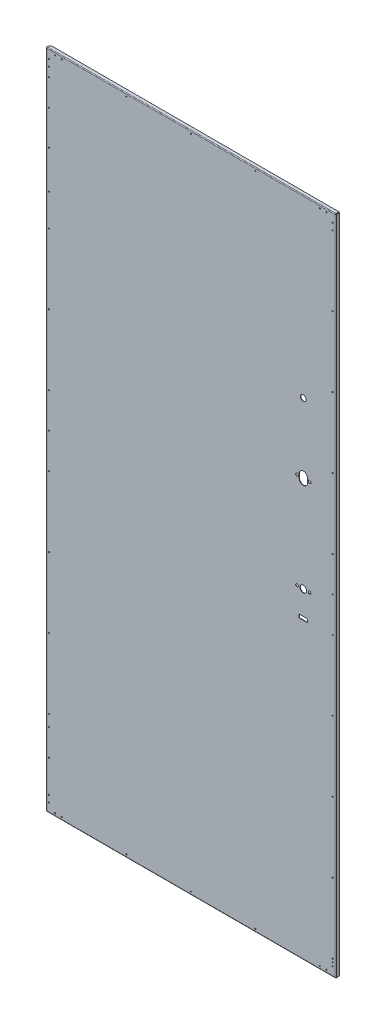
ISO-10303-21;
HEADER;
FILE_DESCRIPTION(('STEP AP214'),'2;1');
FILE_NAME('part.step','',(''),(''),'','','');
FILE_SCHEMA(('AUTOMOTIVE_DESIGN { 1 0 10303 214 1 1 1 1 }'));
ENDSEC;
DATA;
#1=APPLICATION_CONTEXT('core data for automotive mechanical design processes');
#2=APPLICATION_PROTOCOL_DEFINITION('international standard','automotive_design',2000,#1);
#3=PRODUCT_CONTEXT('',#1,'mechanical');
#4=PRODUCT('Part','Part','',(#3));
#5=PRODUCT_RELATED_PRODUCT_CATEGORY('part','',(#4));
#6=PRODUCT_DEFINITION_FORMATION('','',#4);
#7=PRODUCT_DEFINITION_CONTEXT('part definition',#1,'design');
#8=PRODUCT_DEFINITION('design','',#6,#7);
#9=PRODUCT_DEFINITION_SHAPE('','',#8);
#10=(LENGTH_UNIT() NAMED_UNIT(*) SI_UNIT(.MILLI.,.METRE.));
#11=(NAMED_UNIT(*) PLANE_ANGLE_UNIT() SI_UNIT($,.RADIAN.));
#12=(NAMED_UNIT(*) SI_UNIT($,.STERADIAN.) SOLID_ANGLE_UNIT());
#13=UNCERTAINTY_MEASURE_WITH_UNIT(LENGTH_MEASURE(1.E-05),#10,'distance_accuracy_value','');
#14=(GEOMETRIC_REPRESENTATION_CONTEXT(3) GLOBAL_UNCERTAINTY_ASSIGNED_CONTEXT((#13)) GLOBAL_UNIT_ASSIGNED_CONTEXT((#10,
#11,#12)) REPRESENTATION_CONTEXT('',''));
#15=CARTESIAN_POINT('',(0.,0.,0.));
#16=DIRECTION('',(0.,0.,1.));
#17=DIRECTION('',(1.,0.,0.));
#18=AXIS2_PLACEMENT_3D('',#15,#16,#17);
#19=CARTESIAN_POINT('',(1.66533453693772E-13,9.99200722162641E-13,-1.1999999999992));
#20=DIRECTION('',(0.,0.,1.));
#21=DIRECTION('',(1.,0.,0.));
#22=AXIS2_PLACEMENT_3D('',#19,#20,#21);
#23=PLANE('',#22);
#24=CARTESIAN_POINT('',(-0.499999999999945,992.,-1.1999999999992));
#25=DIRECTION('',(0.,0.,1.));
#26=DIRECTION('',(1.,0.,0.));
#27=AXIS2_PLACEMENT_3D('',#24,#25,#26);
#28=CIRCLE('',#27,1.65000000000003);
#29=CARTESIAN_POINT('',(1.15000000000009,992.,-1.1999999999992));
#30=VERTEX_POINT('',#29);
#31=EDGE_CURVE('E2742',#30,#30,#28,.F.);
#32=ORIENTED_EDGE('',*,*,#31,.F.);
#33=EDGE_LOOP('',(#32));
#34=FACE_BOUND('',#33,.T.);
#35=CARTESIAN_POINT('',(-195.6,992.,-1.1999999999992));
#36=DIRECTION('',(0.,0.,1.));
#37=DIRECTION('',(1.,0.,0.));
#38=AXIS2_PLACEMENT_3D('',#35,#36,#37);
#39=CIRCLE('',#38,1.64999999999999);
#40=CARTESIAN_POINT('',(-193.95,992.,-1.1999999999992));
#41=VERTEX_POINT('',#40);
#42=EDGE_CURVE('E2748',#41,#41,#39,.F.);
#43=ORIENTED_EDGE('',*,*,#42,.F.);
#44=EDGE_LOOP('',(#43));
#45=FACE_BOUND('',#44,.T.);
#46=CARTESIAN_POINT('',(-390.7,992.,-1.1999999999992));
#47=DIRECTION('',(0.,0.,1.));
#48=DIRECTION('',(1.,0.,0.));
#49=AXIS2_PLACEMENT_3D('',#46,#47,#48);
#50=CIRCLE('',#49,1.64999999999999);
#51=CARTESIAN_POINT('',(-389.05,992.,-1.1999999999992));
#52=VERTEX_POINT('',#51);
#53=EDGE_CURVE('E2755',#52,#52,#50,.F.);
#54=ORIENTED_EDGE('',*,*,#53,.F.);
#55=EDGE_LOOP('',(#54));
#56=FACE_BOUND('',#55,.T.);
#57=CARTESIAN_POINT('',(389.7,992.,-1.1999999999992));
#58=DIRECTION('',(0.,0.,1.));
#59=DIRECTION('',(1.,0.,0.));
#60=AXIS2_PLACEMENT_3D('',#57,#58,#59);
#61=CIRCLE('',#60,1.64999999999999);
#62=CARTESIAN_POINT('',(391.35,992.,-1.1999999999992));
#63=VERTEX_POINT('',#62);
#64=EDGE_CURVE('E3080',#63,#63,#61,.F.);
#65=ORIENTED_EDGE('',*,*,#64,.F.);
#66=EDGE_LOOP('',(#65));
#67=FACE_BOUND('',#66,.T.);
#68=CARTESIAN_POINT('',(-429.300000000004,317.800000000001,-1.1999999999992));
#69=DIRECTION('',(0.,0.,1.));
#70=DIRECTION('',(1.,0.,0.));
#71=AXIS2_PLACEMENT_3D('',#68,#69,#70);
#72=CIRCLE('',#71,1.64999999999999);
#73=CARTESIAN_POINT('',(-427.650000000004,317.800000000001,-1.1999999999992));
#74=VERTEX_POINT('',#73);
#75=EDGE_CURVE('E2770',#74,#74,#72,.F.);
#76=ORIENTED_EDGE('',*,*,#75,.F.);
#77=EDGE_LOOP('',(#76));
#78=FACE_BOUND('',#77,.T.);
#79=CARTESIAN_POINT('',(-429.300000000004,105.933333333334,-1.1999999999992));
#80=DIRECTION('',(0.,0.,1.));
#81=DIRECTION('',(1.,0.,0.));
#82=AXIS2_PLACEMENT_3D('',#79,#80,#81);
#83=CIRCLE('',#82,1.64999999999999);
#84=CARTESIAN_POINT('',(-427.650000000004,105.933333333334,-1.1999999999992));
#85=VERTEX_POINT('',#84);
#86=EDGE_CURVE('E2771',#85,#85,#83,.F.);
#87=ORIENTED_EDGE('',*,*,#86,.F.);
#88=EDGE_LOOP('',(#87));
#89=FACE_BOUND('',#88,.T.);
#90=CARTESIAN_POINT('',(-429.300000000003,-105.933333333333,-1.1999999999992));
#91=DIRECTION('',(0.,0.,1.));
#92=DIRECTION('',(1.,0.,0.));
#93=AXIS2_PLACEMENT_3D('',#90,#91,#92);
#94=CIRCLE('',#93,1.64999999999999);
#95=CARTESIAN_POINT('',(-427.650000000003,-105.933333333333,-1.1999999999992));
#96=VERTEX_POINT('',#95);
#97=EDGE_CURVE('E2761',#96,#96,#94,.F.);
#98=ORIENTED_EDGE('',*,*,#97,.F.);
#99=EDGE_LOOP('',(#98));
#100=FACE_BOUND('',#99,.T.);
#101=CARTESIAN_POINT('',(194.6,992.,-1.1999999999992));
#102=DIRECTION('',(0.,0.,1.));
#103=DIRECTION('',(1.,0.,0.));
#104=AXIS2_PLACEMENT_3D('',#101,#102,#103);
#105=CIRCLE('',#104,1.64999999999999);
#106=CARTESIAN_POINT('',(196.25,992.,-1.1999999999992));
#107=VERTEX_POINT('',#106);
#108=EDGE_CURVE('E2746',#107,#107,#105,.F.);
#109=ORIENTED_EDGE('',*,*,#108,.F.);
#110=EDGE_LOOP('',(#109));
#111=FACE_BOUND('',#110,.T.);
#112=CARTESIAN_POINT('',(389.7,-991.999999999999,-1.1999999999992));
#113=DIRECTION('',(0.,0.,1.));
#114=DIRECTION('',(1.,0.,0.));
#115=AXIS2_PLACEMENT_3D('',#112,#113,#114);
#116=CIRCLE('',#115,1.64999999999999);
#117=CARTESIAN_POINT('',(391.35,-991.999999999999,-1.1999999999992));
#118=VERTEX_POINT('',#117);
#119=EDGE_CURVE('E3044',#118,#118,#116,.F.);
#120=ORIENTED_EDGE('',*,*,#119,.F.);
#121=EDGE_LOOP('',(#120));
#122=FACE_BOUND('',#121,.T.);
#123=CARTESIAN_POINT('',(-429.3,925.8,-1.1999999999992));
#124=DIRECTION('',(0.,0.,1.));
#125=DIRECTION('',(1.,0.,0.));
#126=AXIS2_PLACEMENT_3D('',#123,#124,#125);
#127=CIRCLE('',#126,1.64999999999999);
#128=CARTESIAN_POINT('',(-427.65,925.8,-1.1999999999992));
#129=VERTEX_POINT('',#128);
#130=EDGE_CURVE('E3045',#129,#129,#127,.F.);
#131=ORIENTED_EDGE('',*,*,#130,.F.);
#132=EDGE_LOOP('',(#131));
#133=FACE_BOUND('',#132,.T.);
#134=CARTESIAN_POINT('',(-429.3,845.8,-1.1999999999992));
#135=DIRECTION('',(0.,0.,1.));
#136=DIRECTION('',(1.,0.,0.));
#137=AXIS2_PLACEMENT_3D('',#134,#135,#136);
#138=CIRCLE('',#137,1.64999999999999);
#139=CARTESIAN_POINT('',(-427.65,845.8,-1.1999999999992));
#140=VERTEX_POINT('',#139);
#141=EDGE_CURVE('E3031',#140,#140,#138,.F.);
#142=ORIENTED_EDGE('',*,*,#141,.F.);
#143=EDGE_LOOP('',(#142));
#144=FACE_BOUND('',#143,.T.);
#145=CARTESIAN_POINT('',(-429.3,625.8,-1.1999999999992));
#146=DIRECTION('',(0.,0.,1.));
#147=DIRECTION('',(1.,0.,0.));
#148=AXIS2_PLACEMENT_3D('',#145,#146,#147);
#149=CIRCLE('',#148,1.64999999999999);
#150=CARTESIAN_POINT('',(-427.65,625.8,-1.1999999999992));
#151=VERTEX_POINT('',#150);
#152=EDGE_CURVE('E3032',#151,#151,#149,.F.);
#153=ORIENTED_EDGE('',*,*,#152,.F.);
#154=EDGE_LOOP('',(#153));
#155=FACE_BOUND('',#154,.T.);
#156=CARTESIAN_POINT('',(-390.7,-991.999999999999,-1.1999999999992));
#157=DIRECTION('',(0.,0.,1.));
#158=DIRECTION('',(1.,0.,0.));
#159=AXIS2_PLACEMENT_3D('',#156,#157,#158);
#160=CIRCLE('',#159,1.64999999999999);
#161=CARTESIAN_POINT('',(-389.05,-991.999999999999,-1.1999999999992));
#162=VERTEX_POINT('',#161);
#163=EDGE_CURVE('E3070',#162,#162,#160,.F.);
#164=ORIENTED_EDGE('',*,*,#163,.F.);
#165=EDGE_LOOP('',(#164));
#166=FACE_BOUND('',#165,.T.);
#167=CARTESIAN_POINT('',(-195.6,-991.999999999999,-1.1999999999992));
#168=DIRECTION('',(0.,0.,1.));
#169=DIRECTION('',(1.,0.,0.));
#170=AXIS2_PLACEMENT_3D('',#167,#168,#169);
#171=CIRCLE('',#170,1.64999999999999);
#172=CARTESIAN_POINT('',(-193.95,-991.999999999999,-1.1999999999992));
#173=VERTEX_POINT('',#172);
#174=EDGE_CURVE('E3064',#173,#173,#171,.F.);
#175=ORIENTED_EDGE('',*,*,#174,.F.);
#176=EDGE_LOOP('',(#175));
#177=FACE_BOUND('',#176,.T.);
#178=CARTESIAN_POINT('',(-0.499999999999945,-992.,-1.1999999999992));
#179=DIRECTION('',(0.,0.,1.));
#180=DIRECTION('',(1.,0.,0.));
#181=AXIS2_PLACEMENT_3D('',#178,#179,#180);
#182=CIRCLE('',#181,1.65000000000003);
#183=CARTESIAN_POINT('',(1.15000000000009,-992.,-1.1999999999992));
#184=VERTEX_POINT('',#183);
#185=EDGE_CURVE('E3057',#184,#184,#182,.F.);
#186=ORIENTED_EDGE('',*,*,#185,.F.);
#187=EDGE_LOOP('',(#186));
#188=FACE_BOUND('',#187,.T.);
#189=CARTESIAN_POINT('',(194.6,-991.999999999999,-1.1999999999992));
#190=DIRECTION('',(0.,0.,1.));
#191=DIRECTION('',(1.,0.,0.));
#192=AXIS2_PLACEMENT_3D('',#189,#190,#191);
#193=CIRCLE('',#192,1.64999999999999);
#194=CARTESIAN_POINT('',(196.25,-991.999999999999,-1.1999999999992));
#195=VERTEX_POINT('',#194);
#196=EDGE_CURVE('E3056',#195,#195,#193,.F.);
#197=ORIENTED_EDGE('',*,*,#196,.F.);
#198=EDGE_LOOP('',(#197));
#199=FACE_BOUND('',#198,.T.);
#200=CARTESIAN_POINT('',(428.299999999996,105.933333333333,-1.1999999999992));
#201=DIRECTION('',(0.,0.,1.));
#202=DIRECTION('',(1.,0.,0.));
#203=AXIS2_PLACEMENT_3D('',#200,#201,#202);
#204=CIRCLE('',#203,1.64999999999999);
#205=CARTESIAN_POINT('',(429.949999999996,105.933333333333,-1.1999999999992));
#206=VERTEX_POINT('',#205);
#207=EDGE_CURVE('E2844',#206,#206,#204,.F.);
#208=ORIENTED_EDGE('',*,*,#207,.F.);
#209=EDGE_LOOP('',(#208));
#210=FACE_BOUND('',#209,.T.);
#211=CARTESIAN_POINT('',(428.299999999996,317.8,-1.1999999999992));
#212=DIRECTION('',(0.,0.,1.));
#213=DIRECTION('',(1.,0.,0.));
#214=AXIS2_PLACEMENT_3D('',#211,#212,#213);
#215=CIRCLE('',#214,1.64999999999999);
#216=CARTESIAN_POINT('',(429.949999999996,317.8,-1.1999999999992));
#217=VERTEX_POINT('',#216);
#218=EDGE_CURVE('E2838',#217,#217,#215,.F.);
#219=ORIENTED_EDGE('',*,*,#218,.F.);
#220=EDGE_LOOP('',(#219));
#221=FACE_BOUND('',#220,.T.);
#222=CARTESIAN_POINT('',(428.299999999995,529.666666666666,-1.1999999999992));
#223=DIRECTION('',(0.,0.,1.));
#224=DIRECTION('',(1.,0.,0.));
#225=AXIS2_PLACEMENT_3D('',#222,#223,#224);
#226=CIRCLE('',#225,1.64999999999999);
#227=CARTESIAN_POINT('',(429.949999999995,529.666666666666,-1.1999999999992));
#228=VERTEX_POINT('',#227);
#229=EDGE_CURVE('E2831',#228,#228,#226,.F.);
#230=ORIENTED_EDGE('',*,*,#229,.F.);
#231=EDGE_LOOP('',(#230));
#232=FACE_BOUND('',#231,.T.);
#233=CARTESIAN_POINT('',(428.299999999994,741.533333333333,-1.1999999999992));
#234=DIRECTION('',(0.,0.,1.));
#235=DIRECTION('',(1.,0.,0.));
#236=AXIS2_PLACEMENT_3D('',#233,#234,#235);
#237=CIRCLE('',#236,1.64999999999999);
#238=CARTESIAN_POINT('',(429.949999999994,741.533333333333,-1.1999999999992));
#239=VERTEX_POINT('',#238);
#240=EDGE_CURVE('E2830',#239,#239,#237,.F.);
#241=ORIENTED_EDGE('',*,*,#240,.F.);
#242=EDGE_LOOP('',(#241));
#243=FACE_BOUND('',#242,.T.);
#244=CARTESIAN_POINT('',(428.299999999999,-529.666666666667,-1.1999999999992));
#245=DIRECTION('',(0.,0.,1.));
#246=DIRECTION('',(1.,0.,0.));
#247=AXIS2_PLACEMENT_3D('',#244,#245,#246);
#248=CIRCLE('',#247,1.64999999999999);
#249=CARTESIAN_POINT('',(429.949999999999,-529.666666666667,-1.1999999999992));
#250=VERTEX_POINT('',#249);
#251=EDGE_CURVE('E2866',#250,#250,#248,.F.);
#252=ORIENTED_EDGE('',*,*,#251,.F.);
#253=EDGE_LOOP('',(#252));
#254=FACE_BOUND('',#253,.T.);
#255=CARTESIAN_POINT('',(428.299999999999,-741.533333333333,-1.1999999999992));
#256=DIRECTION('',(0.,0.,1.));
#257=DIRECTION('',(1.,0.,0.));
#258=AXIS2_PLACEMENT_3D('',#255,#256,#257);
#259=CIRCLE('',#258,1.64999999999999);
#260=CARTESIAN_POINT('',(429.949999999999,-741.533333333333,-1.1999999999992));
#261=VERTEX_POINT('',#260);
#262=EDGE_CURVE('E2867',#261,#261,#259,.F.);
#263=ORIENTED_EDGE('',*,*,#262,.F.);
#264=EDGE_LOOP('',(#263));
#265=FACE_BOUND('',#264,.T.);
#266=CARTESIAN_POINT('',(428.3,-953.4,-1.1999999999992));
#267=DIRECTION('',(0.,0.,1.));
#268=DIRECTION('',(1.,0.,0.));
#269=AXIS2_PLACEMENT_3D('',#266,#267,#268);
#270=CIRCLE('',#269,1.64999999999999);
#271=CARTESIAN_POINT('',(429.95,-953.4,-1.1999999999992));
#272=VERTEX_POINT('',#271);
#273=EDGE_CURVE('E2854',#272,#272,#270,.F.);
#274=ORIENTED_EDGE('',*,*,#273,.F.);
#275=EDGE_LOOP('',(#274));
#276=FACE_BOUND('',#275,.T.);
#277=CARTESIAN_POINT('',(428.3,953.4,-1.1999999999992));
#278=DIRECTION('',(0.,0.,1.));
#279=DIRECTION('',(1.,0.,0.));
#280=AXIS2_PLACEMENT_3D('',#277,#278,#279);
#281=CIRCLE('',#280,1.64999999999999);
#282=CARTESIAN_POINT('',(429.95,953.4,-1.1999999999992));
#283=VERTEX_POINT('',#282);
#284=EDGE_CURVE('E2855',#283,#283,#281,.F.);
#285=ORIENTED_EDGE('',*,*,#284,.F.);
#286=EDGE_LOOP('',(#285));
#287=FACE_BOUND('',#286,.T.);
#288=CARTESIAN_POINT('',(-429.3,-953.399999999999,-1.1999999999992));
#289=DIRECTION('',(0.,0.,1.));
#290=DIRECTION('',(1.,0.,0.));
#291=AXIS2_PLACEMENT_3D('',#288,#289,#290);
#292=CIRCLE('',#291,1.64999999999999);
#293=CARTESIAN_POINT('',(-427.65,-953.399999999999,-1.1999999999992));
#294=VERTEX_POINT('',#293);
#295=EDGE_CURVE('E2794',#294,#294,#292,.F.);
#296=ORIENTED_EDGE('',*,*,#295,.F.);
#297=EDGE_LOOP('',(#296));
#298=FACE_BOUND('',#297,.T.);
#299=CARTESIAN_POINT('',(-429.3,953.400000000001,-1.1999999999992));
#300=DIRECTION('',(0.,0.,1.));
#301=DIRECTION('',(1.,0.,0.));
#302=AXIS2_PLACEMENT_3D('',#299,#300,#301);
#303=CIRCLE('',#302,1.64999999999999);
#304=CARTESIAN_POINT('',(-427.65,953.400000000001,-1.1999999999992));
#305=VERTEX_POINT('',#304);
#306=EDGE_CURVE('E2795',#305,#305,#303,.F.);
#307=ORIENTED_EDGE('',*,*,#306,.F.);
#308=EDGE_LOOP('',(#307));
#309=FACE_BOUND('',#308,.T.);
#310=CARTESIAN_POINT('',(-429.300000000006,741.533333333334,-1.1999999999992));
#311=DIRECTION('',(0.,0.,1.));
#312=DIRECTION('',(1.,0.,0.));
#313=AXIS2_PLACEMENT_3D('',#310,#311,#312);
#314=CIRCLE('',#313,1.64999999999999);
#315=CARTESIAN_POINT('',(-427.650000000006,741.533333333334,-1.1999999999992));
#316=VERTEX_POINT('',#315);
#317=EDGE_CURVE('E2782',#316,#316,#314,.F.);
#318=ORIENTED_EDGE('',*,*,#317,.F.);
#319=EDGE_LOOP('',(#318));
#320=FACE_BOUND('',#319,.T.);
#321=CARTESIAN_POINT('',(-429.300000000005,529.666666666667,-1.1999999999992));
#322=DIRECTION('',(0.,0.,1.));
#323=DIRECTION('',(1.,0.,0.));
#324=AXIS2_PLACEMENT_3D('',#321,#322,#323);
#325=CIRCLE('',#324,1.64999999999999);
#326=CARTESIAN_POINT('',(-427.650000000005,529.666666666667,-1.1999999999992));
#327=VERTEX_POINT('',#326);
#328=EDGE_CURVE('E2783',#327,#327,#325,.F.);
#329=ORIENTED_EDGE('',*,*,#328,.F.);
#330=EDGE_LOOP('',(#329));
#331=FACE_BOUND('',#330,.T.);
#332=CARTESIAN_POINT('',(-429.300000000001,-741.533333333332,-1.1999999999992));
#333=DIRECTION('',(0.,0.,1.));
#334=DIRECTION('',(1.,0.,0.));
#335=AXIS2_PLACEMENT_3D('',#332,#333,#334);
#336=CIRCLE('',#335,1.64999999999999);
#337=CARTESIAN_POINT('',(-427.650000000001,-741.533333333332,-1.1999999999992));
#338=VERTEX_POINT('',#337);
#339=EDGE_CURVE('E2820',#338,#338,#336,.F.);
#340=ORIENTED_EDGE('',*,*,#339,.F.);
#341=EDGE_LOOP('',(#340));
#342=FACE_BOUND('',#341,.T.);
#343=CARTESIAN_POINT('',(-429.300000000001,-529.666666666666,-1.1999999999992));
#344=DIRECTION('',(0.,0.,1.));
#345=DIRECTION('',(1.,0.,0.));
#346=AXIS2_PLACEMENT_3D('',#343,#344,#345);
#347=CIRCLE('',#346,1.64999999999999);
#348=CARTESIAN_POINT('',(-427.650000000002,-529.666666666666,-1.1999999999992));
#349=VERTEX_POINT('',#348);
#350=EDGE_CURVE('E2814',#349,#349,#347,.F.);
#351=ORIENTED_EDGE('',*,*,#350,.F.);
#352=EDGE_LOOP('',(#351));
#353=FACE_BOUND('',#352,.T.);
#354=CARTESIAN_POINT('',(-429.300000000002,-317.799999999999,-1.1999999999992));
#355=DIRECTION('',(0.,0.,1.));
#356=DIRECTION('',(1.,0.,0.));
#357=AXIS2_PLACEMENT_3D('',#354,#355,#356);
#358=CIRCLE('',#357,1.64999999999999);
#359=CARTESIAN_POINT('',(-427.650000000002,-317.799999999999,-1.1999999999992));
#360=VERTEX_POINT('',#359);
#361=EDGE_CURVE('E2807',#360,#360,#358,.F.);
#362=ORIENTED_EDGE('',*,*,#361,.F.);
#363=EDGE_LOOP('',(#362));
#364=FACE_BOUND('',#363,.T.);
#365=CARTESIAN_POINT('',(428.299999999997,-105.933333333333,-1.1999999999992));
#366=DIRECTION('',(0.,0.,1.));
#367=DIRECTION('',(1.,0.,0.));
#368=AXIS2_PLACEMENT_3D('',#365,#366,#367);
#369=CIRCLE('',#368,1.64999999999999);
#370=CARTESIAN_POINT('',(429.949999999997,-105.933333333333,-1.1999999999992));
#371=VERTEX_POINT('',#370);
#372=EDGE_CURVE('E2806',#371,#371,#369,.F.);
#373=ORIENTED_EDGE('',*,*,#372,.F.);
#374=EDGE_LOOP('',(#373));
#375=FACE_BOUND('',#374,.T.);
#376=CARTESIAN_POINT('',(-429.3,-775.799999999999,-1.1999999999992));
#377=DIRECTION('',(0.,0.,1.));
#378=DIRECTION('',(1.,0.,0.));
#379=AXIS2_PLACEMENT_3D('',#376,#377,#378);
#380=CIRCLE('',#379,1.64999999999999);
#381=CARTESIAN_POINT('',(-427.65,-775.799999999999,-1.1999999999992));
#382=VERTEX_POINT('',#381);
#383=EDGE_CURVE('E3014',#382,#382,#380,.F.);
#384=ORIENTED_EDGE('',*,*,#383,.F.);
#385=EDGE_LOOP('',(#384));
#386=FACE_BOUND('',#385,.T.);
#387=CARTESIAN_POINT('',(-429.3,-855.799999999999,-1.1999999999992));
#388=DIRECTION('',(0.,0.,1.));
#389=DIRECTION('',(1.,0.,0.));
#390=AXIS2_PLACEMENT_3D('',#387,#388,#389);
#391=CIRCLE('',#390,1.64999999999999);
#392=CARTESIAN_POINT('',(-427.65,-855.799999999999,-1.1999999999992));
#393=VERTEX_POINT('',#392);
#394=EDGE_CURVE('E3017',#393,#393,#391,.F.);
#395=ORIENTED_EDGE('',*,*,#394,.F.);
#396=EDGE_LOOP('',(#395));
#397=FACE_BOUND('',#396,.T.);
#398=CARTESIAN_POINT('',(428.299999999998,-317.8,-1.1999999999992));
#399=DIRECTION('',(0.,0.,1.));
#400=DIRECTION('',(1.,0.,0.));
#401=AXIS2_PLACEMENT_3D('',#398,#399,#400);
#402=CIRCLE('',#401,1.64999999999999);
#403=CARTESIAN_POINT('',(429.949999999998,-317.8,-1.1999999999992));
#404=VERTEX_POINT('',#403);
#405=EDGE_CURVE('E561',#404,#404,#402,.F.);
#406=ORIENTED_EDGE('',*,*,#405,.F.);
#407=EDGE_LOOP('',(#406));
#408=FACE_BOUND('',#407,.T.);
#409=DIRECTION('',(-1.,0.,0.));
#410=VECTOR('',#409,1.);
#411=CARTESIAN_POINT('',(2.2204460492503E-13,-101.800000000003,-1.19999999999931));
#412=LINE('',#411,#410);
#413=CARTESIAN_POINT('',(352.199999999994,-101.800000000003,-1.19999999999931));
#414=VERTEX_POINT('',#413);
#415=CARTESIAN_POINT('',(327.199999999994,-101.800000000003,-1.19999999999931));
#416=VERTEX_POINT('',#415);
#417=EDGE_CURVE('E974',#414,#416,#412,.T.);
#418=ORIENTED_EDGE('',*,*,#417,.T.);
#419=DIRECTION('',(0.,-1.,0.));
#420=VECTOR('',#419,1.);
#421=CARTESIAN_POINT('',(327.199999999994,9.99200722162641E-13,-1.19999999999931));
#422=LINE('',#421,#420);
#423=CARTESIAN_POINT('',(327.199999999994,-111.800000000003,-1.19999999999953));
#424=VERTEX_POINT('',#423);
#425=EDGE_CURVE('E977',#416,#424,#422,.T.);
#426=ORIENTED_EDGE('',*,*,#425,.T.);
#427=DIRECTION('',(1.,0.,0.));
#428=VECTOR('',#427,1.);
#429=CARTESIAN_POINT('',(2.2204460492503E-13,-111.800000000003,-1.19999999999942));
#430=LINE('',#429,#428);
#431=CARTESIAN_POINT('',(352.199999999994,-111.800000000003,-1.19999999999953));
#432=VERTEX_POINT('',#431);
#433=EDGE_CURVE('E968',#424,#432,#430,.T.);
#434=ORIENTED_EDGE('',*,*,#433,.T.);
#435=DIRECTION('',(0.,1.,0.));
#436=VECTOR('',#435,1.);
#437=CARTESIAN_POINT('',(352.199999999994,9.99200722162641E-13,-1.19999999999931));
#438=LINE('',#437,#436);
#439=EDGE_CURVE('E971',#432,#414,#438,.T.);
#440=ORIENTED_EDGE('',*,*,#439,.T.);
#441=EDGE_LOOP('',(#418,#426,#434,#440));
#442=FACE_BOUND('',#441,.T.);
#443=CARTESIAN_POINT('',(320.699999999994,260.399999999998,-1.19999999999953));
#444=DIRECTION('',(0.,0.,1.));
#445=DIRECTION('',(1.,0.,0.));
#446=AXIS2_PLACEMENT_3D('',#443,#444,#445);
#447=CIRCLE('',#446,4.09999999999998);
#448=CARTESIAN_POINT('',(324.799999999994,260.399999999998,-1.19999999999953));
#449=VERTEX_POINT('',#448);
#450=EDGE_CURVE('E965',#449,#449,#447,.T.);
#451=ORIENTED_EDGE('',*,*,#450,.T.);
#452=EDGE_LOOP('',(#451));
#453=FACE_BOUND('',#452,.T.);
#454=CARTESIAN_POINT('',(358.699999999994,260.399999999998,-1.19999999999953));
#455=DIRECTION('',(0.,0.,1.));
#456=DIRECTION('',(1.,0.,0.));
#457=AXIS2_PLACEMENT_3D('',#454,#455,#456);
#458=CIRCLE('',#457,4.09999999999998);
#459=CARTESIAN_POINT('',(362.799999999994,260.399999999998,-1.19999999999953));
#460=VERTEX_POINT('',#459);
#461=EDGE_CURVE('E961',#460,#460,#458,.T.);
#462=ORIENTED_EDGE('',*,*,#461,.T.);
#463=EDGE_LOOP('',(#462));
#464=FACE_BOUND('',#463,.T.);
#465=CARTESIAN_POINT('',(339.699999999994,470.200000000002,-1.19999999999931));
#466=DIRECTION('',(0.,0.,1.));
#467=DIRECTION('',(1.,0.,0.));
#468=AXIS2_PLACEMENT_3D('',#465,#466,#467);
#469=CIRCLE('',#468,8.50000000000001);
#470=CARTESIAN_POINT('',(348.199999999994,470.200000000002,-1.19999999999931));
#471=VERTEX_POINT('',#470);
#472=EDGE_CURVE('E957',#471,#471,#469,.T.);
#473=ORIENTED_EDGE('',*,*,#472,.T.);
#474=EDGE_LOOP('',(#473));
#475=FACE_BOUND('',#474,.T.);
#476=CARTESIAN_POINT('',(339.699999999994,-29.8000000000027,-1.19999999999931));
#477=DIRECTION('',(0.,0.,1.));
#478=DIRECTION('',(1.,0.,0.));
#479=AXIS2_PLACEMENT_3D('',#476,#477,#478);
#480=CIRCLE('',#479,9.99999999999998);
#481=CARTESIAN_POINT('',(349.699999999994,-29.8000000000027,-1.19999999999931));
#482=VERTEX_POINT('',#481);
#483=EDGE_CURVE('E953',#482,#482,#480,.T.);
#484=ORIENTED_EDGE('',*,*,#483,.T.);
#485=EDGE_LOOP('',(#484));
#486=FACE_BOUND('',#485,.T.);
#487=DIRECTION('',(0.,1.,0.));
#488=VECTOR('',#487,1.);
#489=CARTESIAN_POINT('',(352.199999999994,9.99200722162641E-13,-1.19999999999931));
#490=LINE('',#489,#488);
#491=CARTESIAN_POINT('',(352.199999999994,254.149999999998,-1.1999999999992));
#492=VERTEX_POINT('',#491);
#493=CARTESIAN_POINT('',(352.199999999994,266.649999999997,-1.19999999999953));
#494=VERTEX_POINT('',#493);
#495=EDGE_CURVE('E946',#492,#494,#490,.T.);
#496=ORIENTED_EDGE('',*,*,#495,.T.);
#497=CARTESIAN_POINT('',(339.699999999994,266.649999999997,-1.19999999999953));
#498=DIRECTION('',(0.,0.,1.));
#499=DIRECTION('',(1.,0.,0.));
#500=AXIS2_PLACEMENT_3D('',#497,#498,#499);
#501=CIRCLE('',#500,12.5);
#502=CARTESIAN_POINT('',(327.199999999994,266.649999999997,-1.19999999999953));
#503=VERTEX_POINT('',#502);
#504=EDGE_CURVE('E949',#494,#503,#501,.T.);
#505=ORIENTED_EDGE('',*,*,#504,.T.);
#506=DIRECTION('',(0.,-1.,0.));
#507=VECTOR('',#506,1.);
#508=CARTESIAN_POINT('',(327.199999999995,2.44249065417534E-12,-1.19999999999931));
#509=LINE('',#508,#507);
#510=CARTESIAN_POINT('',(327.199999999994,254.149999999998,-1.1999999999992));
#511=VERTEX_POINT('',#510);
#512=EDGE_CURVE('E940',#503,#511,#509,.T.);
#513=ORIENTED_EDGE('',*,*,#512,.T.);
#514=CARTESIAN_POINT('',(339.699999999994,254.149999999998,-1.1999999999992));
#515=DIRECTION('',(0.,0.,1.));
#516=DIRECTION('',(1.,0.,0.));
#517=AXIS2_PLACEMENT_3D('',#514,#515,#516);
#518=CIRCLE('',#517,12.5);
#519=EDGE_CURVE('E943',#511,#492,#518,.T.);
#520=ORIENTED_EDGE('',*,*,#519,.T.);
#521=EDGE_LOOP('',(#496,#505,#513,#520));
#522=FACE_BOUND('',#521,.T.);
#523=CARTESIAN_POINT('',(358.699999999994,-29.8000000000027,-1.19999999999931));
#524=DIRECTION('',(0.,0.,1.));
#525=DIRECTION('',(1.,0.,0.));
#526=AXIS2_PLACEMENT_3D('',#523,#524,#525);
#527=CIRCLE('',#526,3.99999999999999);
#528=CARTESIAN_POINT('',(362.699999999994,-29.8000000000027,-1.19999999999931));
#529=VERTEX_POINT('',#528);
#530=EDGE_CURVE('E937',#529,#529,#527,.T.);
#531=ORIENTED_EDGE('',*,*,#530,.T.);
#532=EDGE_LOOP('',(#531));
#533=FACE_BOUND('',#532,.T.);
#534=CARTESIAN_POINT('',(320.699999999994,-29.8000000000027,-1.19999999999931));
#535=DIRECTION('',(0.,0.,1.));
#536=DIRECTION('',(1.,0.,0.));
#537=AXIS2_PLACEMENT_3D('',#534,#535,#536);
#538=CIRCLE('',#537,3.99999999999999);
#539=CARTESIAN_POINT('',(324.699999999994,-29.8000000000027,-1.19999999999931));
#540=VERTEX_POINT('',#539);
#541=EDGE_CURVE('E933',#540,#540,#538,.T.);
#542=ORIENTED_EDGE('',*,*,#541,.T.);
#543=EDGE_LOOP('',(#542));
#544=FACE_BOUND('',#543,.T.);
#545=CARTESIAN_POINT('',(409.7,992.000000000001,-1.19999999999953));
#546=DIRECTION('',(0.,0.,1.));
#547=DIRECTION('',(1.,0.,0.));
#548=AXIS2_PLACEMENT_3D('',#545,#546,#547);
#549=CIRCLE('',#548,1.50000000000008);
#550=CARTESIAN_POINT('',(411.2,992.000000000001,-1.19999999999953));
#551=VERTEX_POINT('',#550);
#552=EDGE_CURVE('E1036',#551,#551,#549,.T.);
#553=ORIENTED_EDGE('',*,*,#552,.T.);
#554=EDGE_LOOP('',(#553));
#555=FACE_BOUND('',#554,.T.);
#556=CARTESIAN_POINT('',(-410.7,992.000000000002,-1.19999999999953));
#557=DIRECTION('',(0.,0.,1.));
#558=DIRECTION('',(1.,0.,0.));
#559=AXIS2_PLACEMENT_3D('',#556,#557,#558);
#560=CIRCLE('',#559,1.50000000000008);
#561=CARTESIAN_POINT('',(-409.2,992.000000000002,-1.19999999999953));
#562=VERTEX_POINT('',#561);
#563=EDGE_CURVE('E1020',#562,#562,#560,.T.);
#564=ORIENTED_EDGE('',*,*,#563,.T.);
#565=EDGE_LOOP('',(#564));
#566=FACE_BOUND('',#565,.T.);
#567=CARTESIAN_POINT('',(428.3,-963.399999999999,-1.19999999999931));
#568=DIRECTION('',(0.,0.,1.));
#569=DIRECTION('',(1.,0.,0.));
#570=AXIS2_PLACEMENT_3D('',#567,#568,#569);
#571=CIRCLE('',#570,1.50000000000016);
#572=CARTESIAN_POINT('',(429.8,-963.399999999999,-1.19999999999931));
#573=VERTEX_POINT('',#572);
#574=EDGE_CURVE('E1006',#573,#573,#571,.T.);
#575=ORIENTED_EDGE('',*,*,#574,.T.);
#576=EDGE_LOOP('',(#575));
#577=FACE_BOUND('',#576,.T.);
#578=CARTESIAN_POINT('',(428.3,973.400000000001,-1.19999999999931));
#579=DIRECTION('',(0.,0.,1.));
#580=DIRECTION('',(1.,0.,0.));
#581=AXIS2_PLACEMENT_3D('',#578,#579,#580);
#582=CIRCLE('',#581,1.50000000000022);
#583=CARTESIAN_POINT('',(429.8,973.400000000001,-1.19999999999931));
#584=VERTEX_POINT('',#583);
#585=EDGE_CURVE('E1026',#584,#584,#582,.T.);
#586=ORIENTED_EDGE('',*,*,#585,.T.);
#587=EDGE_LOOP('',(#586));
#588=FACE_BOUND('',#587,.T.);
#589=CARTESIAN_POINT('',(428.300000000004,8.88178419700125E-13,-1.1999999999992));
#590=DIRECTION('',(0.,0.,1.));
#591=DIRECTION('',(1.,0.,0.));
#592=AXIS2_PLACEMENT_3D('',#589,#590,#591);
#593=CIRCLE('',#592,1.50000000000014);
#594=CARTESIAN_POINT('',(429.800000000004,8.88178419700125E-13,-1.1999999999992));
#595=VERTEX_POINT('',#594);
#596=EDGE_CURVE('E1007',#595,#595,#593,.T.);
#597=ORIENTED_EDGE('',*,*,#596,.T.);
#598=EDGE_LOOP('',(#597));
#599=FACE_BOUND('',#598,.T.);
#600=CARTESIAN_POINT('',(428.3,-973.399999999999,-1.19999999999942));
#601=DIRECTION('',(0.,0.,1.));
#602=DIRECTION('',(1.,0.,0.));
#603=AXIS2_PLACEMENT_3D('',#600,#601,#602);
#604=CIRCLE('',#603,1.50000000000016);
#605=CARTESIAN_POINT('',(429.8,-973.399999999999,-1.19999999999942));
#606=VERTEX_POINT('',#605);
#607=EDGE_CURVE('E1014',#606,#606,#604,.T.);
#608=ORIENTED_EDGE('',*,*,#607,.T.);
#609=EDGE_LOOP('',(#608));
#610=FACE_BOUND('',#609,.T.);
#611=CARTESIAN_POINT('',(-429.3,973.400000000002,-1.19999999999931));
#612=DIRECTION('',(0.,0.,1.));
#613=DIRECTION('',(1.,0.,0.));
#614=AXIS2_PLACEMENT_3D('',#611,#612,#613);
#615=CIRCLE('',#614,1.49999999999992);
#616=CARTESIAN_POINT('',(-427.8,973.400000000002,-1.19999999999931));
#617=VERTEX_POINT('',#616);
#618=EDGE_CURVE('E1000',#617,#617,#615,.T.);
#619=ORIENTED_EDGE('',*,*,#618,.T.);
#620=EDGE_LOOP('',(#619));
#621=FACE_BOUND('',#620,.T.);
#622=CARTESIAN_POINT('',(-429.30000000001,1.88737914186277E-12,-1.1999999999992));
#623=DIRECTION('',(0.,0.,1.));
#624=DIRECTION('',(1.,0.,0.));
#625=AXIS2_PLACEMENT_3D('',#622,#623,#624);
#626=CIRCLE('',#625,1.49999999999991);
#627=CARTESIAN_POINT('',(-427.80000000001,1.88737914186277E-12,-1.1999999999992));
#628=VERTEX_POINT('',#627);
#629=EDGE_CURVE('E994',#628,#628,#626,.T.);
#630=ORIENTED_EDGE('',*,*,#629,.T.);
#631=EDGE_LOOP('',(#630));
#632=FACE_BOUND('',#631,.T.);
#633=CARTESIAN_POINT('',(-429.3,-973.399999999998,-1.19999999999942));
#634=DIRECTION('',(0.,0.,1.));
#635=DIRECTION('',(1.,0.,0.));
#636=AXIS2_PLACEMENT_3D('',#633,#634,#635);
#637=CIRCLE('',#636,1.49999999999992);
#638=CARTESIAN_POINT('',(-427.8,-973.399999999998,-1.19999999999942));
#639=VERTEX_POINT('',#638);
#640=EDGE_CURVE('E988',#639,#639,#637,.T.);
#641=ORIENTED_EDGE('',*,*,#640,.T.);
#642=EDGE_LOOP('',(#641));
#643=FACE_BOUND('',#642,.T.);
#644=CARTESIAN_POINT('',(409.7,-991.999999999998,-1.19999999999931));
#645=DIRECTION('',(0.,0.,1.));
#646=DIRECTION('',(1.,0.,0.));
#647=AXIS2_PLACEMENT_3D('',#644,#645,#646);
#648=CIRCLE('',#647,1.50000000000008);
#649=CARTESIAN_POINT('',(411.2,-991.999999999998,-1.19999999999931));
#650=VERTEX_POINT('',#649);
#651=EDGE_CURVE('E981',#650,#650,#648,.T.);
#652=ORIENTED_EDGE('',*,*,#651,.T.);
#653=EDGE_LOOP('',(#652));
#654=FACE_BOUND('',#653,.T.);
#655=CARTESIAN_POINT('',(-410.7,-991.999999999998,-1.19999999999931));
#656=DIRECTION('',(0.,0.,1.));
#657=DIRECTION('',(1.,0.,0.));
#658=AXIS2_PLACEMENT_3D('',#655,#656,#657);
#659=CIRCLE('',#658,1.50000000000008);
#660=CARTESIAN_POINT('',(-409.2,-991.999999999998,-1.19999999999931));
#661=VERTEX_POINT('',#660);
#662=EDGE_CURVE('E1041',#661,#661,#659,.T.);
#663=ORIENTED_EDGE('',*,*,#662,.T.);
#664=EDGE_LOOP('',(#663));
#665=FACE_BOUND('',#664,.T.);
#666=DIRECTION('',(1.,0.,0.));
#667=VECTOR('',#666,1.);
#668=CARTESIAN_POINT('',(-435.9,-998.599999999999,-1.19999999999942));
#669=LINE('',#668,#667);
#670=CARTESIAN_POINT('',(-435.899999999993,-998.600000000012,-1.19999999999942));
#671=VERTEX_POINT('',#670);
#672=CARTESIAN_POINT('',(435.899999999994,-998.599999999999,-1.1999999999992));
#673=VERTEX_POINT('',#672);
#674=EDGE_CURVE('E799',#671,#673,#669,.T.);
#675=ORIENTED_EDGE('',*,*,#674,.F.);
#676=DIRECTION('',(0.,-1.,0.));
#677=VECTOR('',#676,1.);
#678=CARTESIAN_POINT('',(-435.9,998.600000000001,-1.19999999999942));
#679=LINE('',#678,#677);
#680=CARTESIAN_POINT('',(-435.9,998.600000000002,-1.19999999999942));
#681=VERTEX_POINT('',#680);
#682=EDGE_CURVE('E786',#681,#671,#679,.T.);
#683=ORIENTED_EDGE('',*,*,#682,.F.);
#684=DIRECTION('',(-1.,0.,0.));
#685=VECTOR('',#684,1.);
#686=CARTESIAN_POINT('',(435.9,998.600000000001,-1.19999999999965));
#687=LINE('',#686,#685);
#688=CARTESIAN_POINT('',(435.9,998.599999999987,-1.19999999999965));
#689=VERTEX_POINT('',#688);
#690=EDGE_CURVE('E1069',#689,#681,#687,.T.);
#691=ORIENTED_EDGE('',*,*,#690,.F.);
#692=DIRECTION('',(0.,1.,0.));
#693=VECTOR('',#692,1.);
#694=CARTESIAN_POINT('',(435.9,-998.599999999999,-1.19999999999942));
#695=LINE('',#694,#693);
#696=EDGE_CURVE('E1083',#673,#689,#695,.T.);
#697=ORIENTED_EDGE('',*,*,#696,.F.);
#698=EDGE_LOOP('',(#675,#683,#691,#697));
#699=FACE_BOUND('',#698,.T.);
#700=ADVANCED_FACE('F271',(#34,#45,#56,#67,#78,#89,#100,#111,#122,#133,#144,#155,#166,#177,#188,
#199,#210,#221,#232,#243,#254,#265,#276,#287,#298,#309,#320,#331,#342,#353,#364,#375,#386,#397,
#408,#442,#453,#464,#475,#486,#522,#533,#544,#555,#566,#577,#588,#599,#610,#621,#632,#643,#654,
#665,#699),#23,.F.);
#701=CARTESIAN_POINT('',(2.2204460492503E-13,9.99200722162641E-13,4.44089209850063E-13));
#702=DIRECTION('',(0.,0.,1.));
#703=DIRECTION('',(1.,0.,0.));
#704=AXIS2_PLACEMENT_3D('',#701,#702,#703);
#705=PLANE('',#704);
#706=CARTESIAN_POINT('',(-0.499999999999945,992.,0.));
#707=DIRECTION('',(0.,0.,1.));
#708=DIRECTION('',(1.,0.,0.));
#709=AXIS2_PLACEMENT_3D('',#706,#707,#708);
#710=CIRCLE('',#709,1.65000000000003);
#711=CARTESIAN_POINT('',(1.15000000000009,992.,0.));
#712=VERTEX_POINT('',#711);
#713=EDGE_CURVE('E2740',#712,#712,#710,.T.);
#714=ORIENTED_EDGE('',*,*,#713,.F.);
#715=EDGE_LOOP('',(#714));
#716=FACE_BOUND('',#715,.T.);
#717=CARTESIAN_POINT('',(-195.6,992.,0.));
#718=DIRECTION('',(0.,0.,1.));
#719=DIRECTION('',(1.,0.,0.));
#720=AXIS2_PLACEMENT_3D('',#717,#718,#719);
#721=CIRCLE('',#720,1.64999999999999);
#722=CARTESIAN_POINT('',(-193.95,992.,0.));
#723=VERTEX_POINT('',#722);
#724=EDGE_CURVE('E2752',#723,#723,#721,.T.);
#725=ORIENTED_EDGE('',*,*,#724,.F.);
#726=EDGE_LOOP('',(#725));
#727=FACE_BOUND('',#726,.T.);
#728=CARTESIAN_POINT('',(-390.7,992.,0.));
#729=DIRECTION('',(0.,0.,1.));
#730=DIRECTION('',(1.,0.,0.));
#731=AXIS2_PLACEMENT_3D('',#728,#729,#730);
#732=CIRCLE('',#731,1.64999999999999);
#733=CARTESIAN_POINT('',(-389.05,992.,0.));
#734=VERTEX_POINT('',#733);
#735=EDGE_CURVE('E3077',#734,#734,#732,.T.);
#736=ORIENTED_EDGE('',*,*,#735,.F.);
#737=EDGE_LOOP('',(#736));
#738=FACE_BOUND('',#737,.T.);
#739=CARTESIAN_POINT('',(389.7,992.,0.));
#740=DIRECTION('',(0.,0.,1.));
#741=DIRECTION('',(1.,0.,0.));
#742=AXIS2_PLACEMENT_3D('',#739,#740,#741);
#743=CIRCLE('',#742,1.64999999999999);
#744=CARTESIAN_POINT('',(391.35,992.,0.));
#745=VERTEX_POINT('',#744);
#746=EDGE_CURVE('E3060',#745,#745,#743,.T.);
#747=ORIENTED_EDGE('',*,*,#746,.F.);
#748=EDGE_LOOP('',(#747));
#749=FACE_BOUND('',#748,.T.);
#750=CARTESIAN_POINT('',(-429.300000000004,317.800000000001,0.));
#751=DIRECTION('',(0.,0.,1.));
#752=DIRECTION('',(1.,0.,0.));
#753=AXIS2_PLACEMENT_3D('',#750,#751,#752);
#754=CIRCLE('',#753,1.64999999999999);
#755=CARTESIAN_POINT('',(-427.650000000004,317.800000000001,0.));
#756=VERTEX_POINT('',#755);
#757=EDGE_CURVE('E2767',#756,#756,#754,.T.);
#758=ORIENTED_EDGE('',*,*,#757,.F.);
#759=EDGE_LOOP('',(#758));
#760=FACE_BOUND('',#759,.T.);
#761=CARTESIAN_POINT('',(-429.300000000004,105.933333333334,0.));
#762=DIRECTION('',(0.,0.,1.));
#763=DIRECTION('',(1.,0.,0.));
#764=AXIS2_PLACEMENT_3D('',#761,#762,#763);
#765=CIRCLE('',#764,1.64999999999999);
#766=CARTESIAN_POINT('',(-427.650000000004,105.933333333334,0.));
#767=VERTEX_POINT('',#766);
#768=EDGE_CURVE('E2763',#767,#767,#765,.T.);
#769=ORIENTED_EDGE('',*,*,#768,.F.);
#770=EDGE_LOOP('',(#769));
#771=FACE_BOUND('',#770,.T.);
#772=CARTESIAN_POINT('',(-429.300000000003,-105.933333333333,0.));
#773=DIRECTION('',(0.,0.,1.));
#774=DIRECTION('',(1.,0.,0.));
#775=AXIS2_PLACEMENT_3D('',#772,#773,#774);
#776=CIRCLE('',#775,1.64999999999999);
#777=CARTESIAN_POINT('',(-427.650000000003,-105.933333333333,0.));
#778=VERTEX_POINT('',#777);
#779=EDGE_CURVE('E2758',#778,#778,#776,.T.);
#780=ORIENTED_EDGE('',*,*,#779,.F.);
#781=EDGE_LOOP('',(#780));
#782=FACE_BOUND('',#781,.T.);
#783=CARTESIAN_POINT('',(194.6,992.,0.));
#784=DIRECTION('',(0.,0.,1.));
#785=DIRECTION('',(1.,0.,0.));
#786=AXIS2_PLACEMENT_3D('',#783,#784,#785);
#787=CIRCLE('',#786,1.64999999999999);
#788=CARTESIAN_POINT('',(196.25,992.,0.));
#789=VERTEX_POINT('',#788);
#790=EDGE_CURVE('E2743',#789,#789,#787,.T.);
#791=ORIENTED_EDGE('',*,*,#790,.F.);
#792=EDGE_LOOP('',(#791));
#793=FACE_BOUND('',#792,.T.);
#794=CARTESIAN_POINT('',(389.7,-991.999999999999,0.));
#795=DIRECTION('',(0.,0.,1.));
#796=DIRECTION('',(1.,0.,0.));
#797=AXIS2_PLACEMENT_3D('',#794,#795,#796);
#798=CIRCLE('',#797,1.64999999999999);
#799=CARTESIAN_POINT('',(391.35,-991.999999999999,0.));
#800=VERTEX_POINT('',#799);
#801=EDGE_CURVE('E3041',#800,#800,#798,.T.);
#802=ORIENTED_EDGE('',*,*,#801,.F.);
#803=EDGE_LOOP('',(#802));
#804=FACE_BOUND('',#803,.T.);
#805=CARTESIAN_POINT('',(-429.3,925.8,0.));
#806=DIRECTION('',(0.,0.,1.));
#807=DIRECTION('',(1.,0.,0.));
#808=AXIS2_PLACEMENT_3D('',#805,#806,#807);
#809=CIRCLE('',#808,1.64999999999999);
#810=CARTESIAN_POINT('',(-427.65,925.8,0.));
#811=VERTEX_POINT('',#810);
#812=EDGE_CURVE('E3035',#811,#811,#809,.T.);
#813=ORIENTED_EDGE('',*,*,#812,.F.);
#814=EDGE_LOOP('',(#813));
#815=FACE_BOUND('',#814,.T.);
#816=CARTESIAN_POINT('',(-429.3,845.8,0.));
#817=DIRECTION('',(0.,0.,1.));
#818=DIRECTION('',(1.,0.,0.));
#819=AXIS2_PLACEMENT_3D('',#816,#817,#818);
#820=CIRCLE('',#819,1.64999999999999);
#821=CARTESIAN_POINT('',(-427.65,845.8,0.));
#822=VERTEX_POINT('',#821);
#823=EDGE_CURVE('E3028',#822,#822,#820,.T.);
#824=ORIENTED_EDGE('',*,*,#823,.F.);
#825=EDGE_LOOP('',(#824));
#826=FACE_BOUND('',#825,.T.);
#827=CARTESIAN_POINT('',(-429.3,625.8,0.));
#828=DIRECTION('',(0.,0.,1.));
#829=DIRECTION('',(1.,0.,0.));
#830=AXIS2_PLACEMENT_3D('',#827,#828,#829);
#831=CIRCLE('',#830,1.64999999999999);
#832=CARTESIAN_POINT('',(-427.65,625.8,0.));
#833=VERTEX_POINT('',#832);
#834=EDGE_CURVE('E3036',#833,#833,#831,.T.);
#835=ORIENTED_EDGE('',*,*,#834,.F.);
#836=EDGE_LOOP('',(#835));
#837=FACE_BOUND('',#836,.T.);
#838=CARTESIAN_POINT('',(-390.7,-991.999999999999,0.));
#839=DIRECTION('',(0.,0.,1.));
#840=DIRECTION('',(1.,0.,0.));
#841=AXIS2_PLACEMENT_3D('',#838,#839,#840);
#842=CIRCLE('',#841,1.64999999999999);
#843=CARTESIAN_POINT('',(-389.05,-991.999999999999,0.));
#844=VERTEX_POINT('',#843);
#845=EDGE_CURVE('E3048',#844,#844,#842,.T.);
#846=ORIENTED_EDGE('',*,*,#845,.F.);
#847=EDGE_LOOP('',(#846));
#848=FACE_BOUND('',#847,.T.);
#849=CARTESIAN_POINT('',(-195.6,-991.999999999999,0.));
#850=DIRECTION('',(0.,0.,1.));
#851=DIRECTION('',(1.,0.,0.));
#852=AXIS2_PLACEMENT_3D('',#849,#850,#851);
#853=CIRCLE('',#852,1.64999999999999);
#854=CARTESIAN_POINT('',(-193.95,-991.999999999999,0.));
#855=VERTEX_POINT('',#854);
#856=EDGE_CURVE('E3067',#855,#855,#853,.T.);
#857=ORIENTED_EDGE('',*,*,#856,.F.);
#858=EDGE_LOOP('',(#857));
#859=FACE_BOUND('',#858,.T.);
#860=CARTESIAN_POINT('',(-0.499999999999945,-992.,0.));
#861=DIRECTION('',(0.,0.,1.));
#862=DIRECTION('',(1.,0.,0.));
#863=AXIS2_PLACEMENT_3D('',#860,#861,#862);
#864=CIRCLE('',#863,1.65000000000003);
#865=CARTESIAN_POINT('',(1.15000000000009,-992.,0.));
#866=VERTEX_POINT('',#865);
#867=EDGE_CURVE('E3061',#866,#866,#864,.T.);
#868=ORIENTED_EDGE('',*,*,#867,.F.);
#869=EDGE_LOOP('',(#868));
#870=FACE_BOUND('',#869,.T.);
#871=CARTESIAN_POINT('',(194.6,-991.999999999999,0.));
#872=DIRECTION('',(0.,0.,1.));
#873=DIRECTION('',(1.,0.,0.));
#874=AXIS2_PLACEMENT_3D('',#871,#872,#873);
#875=CIRCLE('',#874,1.64999999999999);
#876=CARTESIAN_POINT('',(196.25,-991.999999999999,0.));
#877=VERTEX_POINT('',#876);
#878=EDGE_CURVE('E3053',#877,#877,#875,.T.);
#879=ORIENTED_EDGE('',*,*,#878,.F.);
#880=EDGE_LOOP('',(#879));
#881=FACE_BOUND('',#880,.T.);
#882=CARTESIAN_POINT('',(428.299999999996,105.933333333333,0.));
#883=DIRECTION('',(0.,0.,1.));
#884=DIRECTION('',(1.,0.,0.));
#885=AXIS2_PLACEMENT_3D('',#882,#883,#884);
#886=CIRCLE('',#885,1.64999999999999);
#887=CARTESIAN_POINT('',(429.949999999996,105.933333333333,0.));
#888=VERTEX_POINT('',#887);
#889=EDGE_CURVE('E2810',#888,#888,#886,.T.);
#890=ORIENTED_EDGE('',*,*,#889,.F.);
#891=EDGE_LOOP('',(#890));
#892=FACE_BOUND('',#891,.T.);
#893=CARTESIAN_POINT('',(428.299999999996,317.8,0.));
#894=DIRECTION('',(0.,0.,1.));
#895=DIRECTION('',(1.,0.,0.));
#896=AXIS2_PLACEMENT_3D('',#893,#894,#895);
#897=CIRCLE('',#896,1.64999999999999);
#898=CARTESIAN_POINT('',(429.949999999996,317.8,0.));
#899=VERTEX_POINT('',#898);
#900=EDGE_CURVE('E2841',#899,#899,#897,.T.);
#901=ORIENTED_EDGE('',*,*,#900,.F.);
#902=EDGE_LOOP('',(#901));
#903=FACE_BOUND('',#902,.T.);
#904=CARTESIAN_POINT('',(428.299999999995,529.666666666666,0.));
#905=DIRECTION('',(0.,0.,1.));
#906=DIRECTION('',(1.,0.,0.));
#907=AXIS2_PLACEMENT_3D('',#904,#905,#906);
#908=CIRCLE('',#907,1.64999999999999);
#909=CARTESIAN_POINT('',(429.949999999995,529.666666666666,0.));
#910=VERTEX_POINT('',#909);
#911=EDGE_CURVE('E2835',#910,#910,#908,.T.);
#912=ORIENTED_EDGE('',*,*,#911,.F.);
#913=EDGE_LOOP('',(#912));
#914=FACE_BOUND('',#913,.T.);
#915=CARTESIAN_POINT('',(428.299999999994,741.533333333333,0.));
#916=DIRECTION('',(0.,0.,1.));
#917=DIRECTION('',(1.,0.,0.));
#918=AXIS2_PLACEMENT_3D('',#915,#916,#917);
#919=CIRCLE('',#918,1.64999999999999);
#920=CARTESIAN_POINT('',(429.949999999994,741.533333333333,0.));
#921=VERTEX_POINT('',#920);
#922=EDGE_CURVE('E2827',#921,#921,#919,.T.);
#923=ORIENTED_EDGE('',*,*,#922,.F.);
#924=EDGE_LOOP('',(#923));
#925=FACE_BOUND('',#924,.T.);
#926=CARTESIAN_POINT('',(428.299999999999,-529.666666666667,0.));
#927=DIRECTION('',(0.,0.,1.));
#928=DIRECTION('',(1.,0.,0.));
#929=AXIS2_PLACEMENT_3D('',#926,#927,#928);
#930=CIRCLE('',#929,1.64999999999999);
#931=CARTESIAN_POINT('',(429.949999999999,-529.666666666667,0.));
#932=VERTEX_POINT('',#931);
#933=EDGE_CURVE('E2863',#932,#932,#930,.T.);
#934=ORIENTED_EDGE('',*,*,#933,.F.);
#935=EDGE_LOOP('',(#934));
#936=FACE_BOUND('',#935,.T.);
#937=CARTESIAN_POINT('',(428.299999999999,-741.533333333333,0.));
#938=DIRECTION('',(0.,0.,1.));
#939=DIRECTION('',(1.,0.,0.));
#940=AXIS2_PLACEMENT_3D('',#937,#938,#939);
#941=CIRCLE('',#940,1.64999999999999);
#942=CARTESIAN_POINT('',(429.949999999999,-741.533333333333,0.));
#943=VERTEX_POINT('',#942);
#944=EDGE_CURVE('E2858',#943,#943,#941,.T.);
#945=ORIENTED_EDGE('',*,*,#944,.F.);
#946=EDGE_LOOP('',(#945));
#947=FACE_BOUND('',#946,.T.);
#948=CARTESIAN_POINT('',(428.3,-953.4,0.));
#949=DIRECTION('',(0.,0.,1.));
#950=DIRECTION('',(1.,0.,0.));
#951=AXIS2_PLACEMENT_3D('',#948,#949,#950);
#952=CIRCLE('',#951,1.64999999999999);
#953=CARTESIAN_POINT('',(429.95,-953.4,0.));
#954=VERTEX_POINT('',#953);
#955=EDGE_CURVE('E2851',#954,#954,#952,.T.);
#956=ORIENTED_EDGE('',*,*,#955,.F.);
#957=EDGE_LOOP('',(#956));
#958=FACE_BOUND('',#957,.T.);
#959=CARTESIAN_POINT('',(428.3,953.4,0.));
#960=DIRECTION('',(0.,0.,1.));
#961=DIRECTION('',(1.,0.,0.));
#962=AXIS2_PLACEMENT_3D('',#959,#960,#961);
#963=CIRCLE('',#962,1.64999999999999);
#964=CARTESIAN_POINT('',(429.95,953.4,0.));
#965=VERTEX_POINT('',#964);
#966=EDGE_CURVE('E2834',#965,#965,#963,.T.);
#967=ORIENTED_EDGE('',*,*,#966,.F.);
#968=EDGE_LOOP('',(#967));
#969=FACE_BOUND('',#968,.T.);
#970=CARTESIAN_POINT('',(-429.3,-953.399999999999,0.));
#971=DIRECTION('',(0.,0.,1.));
#972=DIRECTION('',(1.,0.,0.));
#973=AXIS2_PLACEMENT_3D('',#970,#971,#972);
#974=CIRCLE('',#973,1.64999999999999);
#975=CARTESIAN_POINT('',(-427.65,-953.399999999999,0.));
#976=VERTEX_POINT('',#975);
#977=EDGE_CURVE('E2791',#976,#976,#974,.T.);
#978=ORIENTED_EDGE('',*,*,#977,.F.);
#979=EDGE_LOOP('',(#978));
#980=FACE_BOUND('',#979,.T.);
#981=CARTESIAN_POINT('',(-429.3,953.400000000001,0.));
#982=DIRECTION('',(0.,0.,1.));
#983=DIRECTION('',(1.,0.,0.));
#984=AXIS2_PLACEMENT_3D('',#981,#982,#983);
#985=CIRCLE('',#984,1.64999999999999);
#986=CARTESIAN_POINT('',(-427.65,953.400000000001,0.));
#987=VERTEX_POINT('',#986);
#988=EDGE_CURVE('E2786',#987,#987,#985,.T.);
#989=ORIENTED_EDGE('',*,*,#988,.F.);
#990=EDGE_LOOP('',(#989));
#991=FACE_BOUND('',#990,.T.);
#992=CARTESIAN_POINT('',(-429.300000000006,741.533333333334,0.));
#993=DIRECTION('',(0.,0.,1.));
#994=DIRECTION('',(1.,0.,0.));
#995=AXIS2_PLACEMENT_3D('',#992,#993,#994);
#996=CIRCLE('',#995,1.64999999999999);
#997=CARTESIAN_POINT('',(-427.650000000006,741.533333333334,0.));
#998=VERTEX_POINT('',#997);
#999=EDGE_CURVE('E2779',#998,#998,#996,.T.);
#1000=ORIENTED_EDGE('',*,*,#999,.F.);
#1001=EDGE_LOOP('',(#1000));
#1002=FACE_BOUND('',#1001,.T.);
#1003=CARTESIAN_POINT('',(-429.300000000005,529.666666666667,0.));
#1004=DIRECTION('',(0.,0.,1.));
#1005=DIRECTION('',(1.,0.,0.));
#1006=AXIS2_PLACEMENT_3D('',#1003,#1004,#1005);
#1007=CIRCLE('',#1006,1.64999999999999);
#1008=CARTESIAN_POINT('',(-427.650000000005,529.666666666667,0.));
#1009=VERTEX_POINT('',#1008);
#1010=EDGE_CURVE('E2774',#1009,#1009,#1007,.T.);
#1011=ORIENTED_EDGE('',*,*,#1010,.F.);
#1012=EDGE_LOOP('',(#1011));
#1013=FACE_BOUND('',#1012,.T.);
#1014=CARTESIAN_POINT('',(-429.300000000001,-741.533333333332,0.));
#1015=DIRECTION('',(0.,0.,1.));
#1016=DIRECTION('',(1.,0.,0.));
#1017=AXIS2_PLACEMENT_3D('',#1014,#1015,#1016);
#1018=CIRCLE('',#1017,1.64999999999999);
#1019=CARTESIAN_POINT('',(-427.650000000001,-741.533333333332,0.));
#1020=VERTEX_POINT('',#1019);
#1021=EDGE_CURVE('E2798',#1020,#1020,#1018,.T.);
#1022=ORIENTED_EDGE('',*,*,#1021,.F.);
#1023=EDGE_LOOP('',(#1022));
#1024=FACE_BOUND('',#1023,.T.);
#1025=CARTESIAN_POINT('',(-429.300000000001,-529.666666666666,0.));
#1026=DIRECTION('',(0.,0.,1.));
#1027=DIRECTION('',(1.,0.,0.));
#1028=AXIS2_PLACEMENT_3D('',#1025,#1026,#1027);
#1029=CIRCLE('',#1028,1.64999999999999);
#1030=CARTESIAN_POINT('',(-427.650000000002,-529.666666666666,0.));
#1031=VERTEX_POINT('',#1030);
#1032=EDGE_CURVE('E2817',#1031,#1031,#1029,.T.);
#1033=ORIENTED_EDGE('',*,*,#1032,.F.);
#1034=EDGE_LOOP('',(#1033));
#1035=FACE_BOUND('',#1034,.T.);
#1036=CARTESIAN_POINT('',(-429.300000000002,-317.799999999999,0.));
#1037=DIRECTION('',(0.,0.,1.));
#1038=DIRECTION('',(1.,0.,0.));
#1039=AXIS2_PLACEMENT_3D('',#1036,#1037,#1038);
#1040=CIRCLE('',#1039,1.64999999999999);
#1041=CARTESIAN_POINT('',(-427.650000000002,-317.799999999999,0.));
#1042=VERTEX_POINT('',#1041);
#1043=EDGE_CURVE('E2811',#1042,#1042,#1040,.T.);
#1044=ORIENTED_EDGE('',*,*,#1043,.F.);
#1045=EDGE_LOOP('',(#1044));
#1046=FACE_BOUND('',#1045,.T.);
#1047=CARTESIAN_POINT('',(428.299999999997,-105.933333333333,0.));
#1048=DIRECTION('',(0.,0.,1.));
#1049=DIRECTION('',(1.,0.,0.));
#1050=AXIS2_PLACEMENT_3D('',#1047,#1048,#1049);
#1051=CIRCLE('',#1050,1.64999999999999);
#1052=CARTESIAN_POINT('',(429.949999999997,-105.933333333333,0.));
#1053=VERTEX_POINT('',#1052);
#1054=EDGE_CURVE('E2803',#1053,#1053,#1051,.T.);
#1055=ORIENTED_EDGE('',*,*,#1054,.F.);
#1056=EDGE_LOOP('',(#1055));
#1057=FACE_BOUND('',#1056,.T.);
#1058=CARTESIAN_POINT('',(-429.3,-775.799999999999,0.));
#1059=DIRECTION('',(0.,0.,1.));
#1060=DIRECTION('',(1.,0.,0.));
#1061=AXIS2_PLACEMENT_3D('',#1058,#1059,#1060);
#1062=CIRCLE('',#1061,1.64999999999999);
#1063=CARTESIAN_POINT('',(-427.65,-775.799999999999,0.));
#1064=VERTEX_POINT('',#1063);
#1065=EDGE_CURVE('E3019',#1064,#1064,#1062,.T.);
#1066=ORIENTED_EDGE('',*,*,#1065,.F.);
#1067=EDGE_LOOP('',(#1066));
#1068=FACE_BOUND('',#1067,.T.);
#1069=CARTESIAN_POINT('',(-429.3,-855.799999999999,0.));
#1070=DIRECTION('',(0.,0.,1.));
#1071=DIRECTION('',(1.,0.,0.));
#1072=AXIS2_PLACEMENT_3D('',#1069,#1070,#1071);
#1073=CIRCLE('',#1072,1.64999999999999);
#1074=CARTESIAN_POINT('',(-427.65,-855.799999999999,0.));
#1075=VERTEX_POINT('',#1074);
#1076=EDGE_CURVE('E3020',#1075,#1075,#1073,.T.);
#1077=ORIENTED_EDGE('',*,*,#1076,.F.);
#1078=EDGE_LOOP('',(#1077));
#1079=FACE_BOUND('',#1078,.T.);
#1080=CARTESIAN_POINT('',(428.299999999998,-317.8,0.));
#1081=DIRECTION('',(0.,0.,1.));
#1082=DIRECTION('',(1.,0.,0.));
#1083=AXIS2_PLACEMENT_3D('',#1080,#1081,#1082);
#1084=CIRCLE('',#1083,1.64999999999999);
#1085=CARTESIAN_POINT('',(429.949999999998,-317.8,0.));
#1086=VERTEX_POINT('',#1085);
#1087=EDGE_CURVE('E2870',#1086,#1086,#1084,.T.);
#1088=ORIENTED_EDGE('',*,*,#1087,.F.);
#1089=EDGE_LOOP('',(#1088));
#1090=FACE_BOUND('',#1089,.T.);
#1091=DIRECTION('',(0.,-1.,0.));
#1092=VECTOR('',#1091,1.);
#1093=CARTESIAN_POINT('',(327.199999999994,9.99200722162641E-13,4.44089209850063E-13));
#1094=LINE('',#1093,#1092);
#1095=CARTESIAN_POINT('',(327.199999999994,-101.800000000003,6.66133814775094E-13));
#1096=VERTEX_POINT('',#1095);
#1097=CARTESIAN_POINT('',(327.199999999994,-111.800000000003,6.66133814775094E-13));
#1098=VERTEX_POINT('',#1097);
#1099=EDGE_CURVE('E1066',#1096,#1098,#1094,.T.);
#1100=ORIENTED_EDGE('',*,*,#1099,.F.);
#1101=DIRECTION('',(-1.,0.,0.));
#1102=VECTOR('',#1101,1.);
#1103=CARTESIAN_POINT('',(2.2204460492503E-13,-101.800000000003,6.66133814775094E-13));
#1104=LINE('',#1103,#1102);
#1105=CARTESIAN_POINT('',(352.199999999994,-101.800000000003,4.44089209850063E-13));
#1106=VERTEX_POINT('',#1105);
#1107=EDGE_CURVE('E1064',#1106,#1096,#1104,.T.);
#1108=ORIENTED_EDGE('',*,*,#1107,.F.);
#1109=DIRECTION('',(0.,1.,0.));
#1110=VECTOR('',#1109,1.);
#1111=CARTESIAN_POINT('',(352.199999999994,9.99200722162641E-13,4.44089209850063E-13));
#1112=LINE('',#1111,#1110);
#1113=CARTESIAN_POINT('',(352.199999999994,-111.800000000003,6.66133814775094E-13));
#1114=VERTEX_POINT('',#1113);
#1115=EDGE_CURVE('E1061',#1114,#1106,#1112,.T.);
#1116=ORIENTED_EDGE('',*,*,#1115,.F.);
#1117=DIRECTION('',(1.,0.,0.));
#1118=VECTOR('',#1117,1.);
#1119=CARTESIAN_POINT('',(2.2204460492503E-13,-111.800000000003,6.66133814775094E-13));
#1120=LINE('',#1119,#1118);
#1121=EDGE_CURVE('E1059',#1098,#1114,#1120,.T.);
#1122=ORIENTED_EDGE('',*,*,#1121,.F.);
#1123=EDGE_LOOP('',(#1100,#1108,#1116,#1122));
#1124=FACE_BOUND('',#1123,.T.);
#1125=CARTESIAN_POINT('',(320.699999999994,260.399999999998,4.44089209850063E-13));
#1126=DIRECTION('',(0.,0.,1.));
#1127=DIRECTION('',(1.,0.,0.));
#1128=AXIS2_PLACEMENT_3D('',#1125,#1126,#1127);
#1129=CIRCLE('',#1128,4.09999999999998);
#1130=CARTESIAN_POINT('',(324.799999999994,260.399999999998,4.44089209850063E-13));
#1131=VERTEX_POINT('',#1130);
#1132=EDGE_CURVE('E964',#1131,#1131,#1129,.T.);
#1133=ORIENTED_EDGE('',*,*,#1132,.F.);
#1134=EDGE_LOOP('',(#1133));
#1135=FACE_BOUND('',#1134,.T.);
#1136=CARTESIAN_POINT('',(358.699999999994,260.399999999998,4.44089209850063E-13));
#1137=DIRECTION('',(0.,0.,1.));
#1138=DIRECTION('',(1.,0.,0.));
#1139=AXIS2_PLACEMENT_3D('',#1136,#1137,#1138);
#1140=CIRCLE('',#1139,4.09999999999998);
#1141=CARTESIAN_POINT('',(362.799999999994,260.399999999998,4.44089209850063E-13));
#1142=VERTEX_POINT('',#1141);
#1143=EDGE_CURVE('E960',#1142,#1142,#1140,.T.);
#1144=ORIENTED_EDGE('',*,*,#1143,.F.);
#1145=EDGE_LOOP('',(#1144));
#1146=FACE_BOUND('',#1145,.T.);
#1147=CARTESIAN_POINT('',(339.699999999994,470.200000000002,4.44089209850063E-13));
#1148=DIRECTION('',(0.,0.,1.));
#1149=DIRECTION('',(1.,0.,0.));
#1150=AXIS2_PLACEMENT_3D('',#1147,#1148,#1149);
#1151=CIRCLE('',#1150,8.50000000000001);
#1152=CARTESIAN_POINT('',(348.199999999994,470.200000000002,4.44089209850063E-13));
#1153=VERTEX_POINT('',#1152);
#1154=EDGE_CURVE('E956',#1153,#1153,#1151,.T.);
#1155=ORIENTED_EDGE('',*,*,#1154,.F.);
#1156=EDGE_LOOP('',(#1155));
#1157=FACE_BOUND('',#1156,.T.);
#1158=CARTESIAN_POINT('',(339.699999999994,-29.8000000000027,8.88178419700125E-13));
#1159=DIRECTION('',(0.,0.,1.));
#1160=DIRECTION('',(1.,0.,0.));
#1161=AXIS2_PLACEMENT_3D('',#1158,#1159,#1160);
#1162=CIRCLE('',#1161,9.99999999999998);
#1163=CARTESIAN_POINT('',(349.699999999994,-29.8000000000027,8.88178419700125E-13));
#1164=VERTEX_POINT('',#1163);
#1165=EDGE_CURVE('E952',#1164,#1164,#1162,.T.);
#1166=ORIENTED_EDGE('',*,*,#1165,.F.);
#1167=EDGE_LOOP('',(#1166));
#1168=FACE_BOUND('',#1167,.T.);
#1169=CARTESIAN_POINT('',(339.699999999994,266.649999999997,4.44089209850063E-13));
#1170=DIRECTION('',(0.,0.,1.));
#1171=DIRECTION('',(1.,0.,0.));
#1172=AXIS2_PLACEMENT_3D('',#1169,#1170,#1171);
#1173=CIRCLE('',#1172,12.5);
#1174=CARTESIAN_POINT('',(352.199999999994,266.649999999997,4.44089209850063E-13));
#1175=VERTEX_POINT('',#1174);
#1176=CARTESIAN_POINT('',(327.199999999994,266.649999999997,4.44089209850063E-13));
#1177=VERTEX_POINT('',#1176);
#1178=EDGE_CURVE('E1062',#1175,#1177,#1173,.T.);
#1179=ORIENTED_EDGE('',*,*,#1178,.F.);
#1180=DIRECTION('',(0.,1.,0.));
#1181=VECTOR('',#1180,1.);
#1182=CARTESIAN_POINT('',(352.199999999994,254.149999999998,4.44089209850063E-13));
#1183=LINE('',#1182,#1181);
#1184=CARTESIAN_POINT('',(352.199999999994,254.149999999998,4.44089209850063E-13));
#1185=VERTEX_POINT('',#1184);
#1186=EDGE_CURVE('E1073',#1185,#1175,#1183,.T.);
#1187=ORIENTED_EDGE('',*,*,#1186,.F.);
#1188=CARTESIAN_POINT('',(339.699999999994,254.149999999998,4.44089209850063E-13));
#1189=DIRECTION('',(0.,0.,1.));
#1190=DIRECTION('',(1.,0.,0.));
#1191=AXIS2_PLACEMENT_3D('',#1188,#1189,#1190);
#1192=CIRCLE('',#1191,12.5);
#1193=CARTESIAN_POINT('',(327.199999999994,254.149999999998,4.44089209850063E-13));
#1194=VERTEX_POINT('',#1193);
#1195=EDGE_CURVE('E1071',#1194,#1185,#1192,.T.);
#1196=ORIENTED_EDGE('',*,*,#1195,.F.);
#1197=DIRECTION('',(0.,-1.,0.));
#1198=VECTOR('',#1197,1.);
#1199=CARTESIAN_POINT('',(327.199999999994,266.649999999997,4.44089209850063E-13));
#1200=LINE('',#1199,#1198);
#1201=EDGE_CURVE('E1044',#1177,#1194,#1200,.T.);
#1202=ORIENTED_EDGE('',*,*,#1201,.F.);
#1203=EDGE_LOOP('',(#1179,#1187,#1196,#1202));
#1204=FACE_BOUND('',#1203,.T.);
#1205=CARTESIAN_POINT('',(358.699999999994,-29.8000000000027,8.88178419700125E-13));
#1206=DIRECTION('',(0.,0.,1.));
#1207=DIRECTION('',(1.,0.,0.));
#1208=AXIS2_PLACEMENT_3D('',#1205,#1206,#1207);
#1209=CIRCLE('',#1208,3.99999999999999);
#1210=CARTESIAN_POINT('',(362.699999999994,-29.8000000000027,8.88178419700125E-13));
#1211=VERTEX_POINT('',#1210);
#1212=EDGE_CURVE('E936',#1211,#1211,#1209,.T.);
#1213=ORIENTED_EDGE('',*,*,#1212,.F.);
#1214=EDGE_LOOP('',(#1213));
#1215=FACE_BOUND('',#1214,.T.);
#1216=CARTESIAN_POINT('',(320.699999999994,-29.8000000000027,8.88178419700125E-13));
#1217=DIRECTION('',(0.,0.,1.));
#1218=DIRECTION('',(1.,0.,0.));
#1219=AXIS2_PLACEMENT_3D('',#1216,#1217,#1218);
#1220=CIRCLE('',#1219,3.99999999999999);
#1221=CARTESIAN_POINT('',(324.699999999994,-29.8000000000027,8.88178419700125E-13));
#1222=VERTEX_POINT('',#1221);
#1223=EDGE_CURVE('E913',#1222,#1222,#1220,.T.);
#1224=ORIENTED_EDGE('',*,*,#1223,.F.);
#1225=EDGE_LOOP('',(#1224));
#1226=FACE_BOUND('',#1225,.T.);
#1227=CARTESIAN_POINT('',(409.7,992.000000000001,8.88178419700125E-13));
#1228=DIRECTION('',(0.,0.,1.));
#1229=DIRECTION('',(1.,0.,0.));
#1230=AXIS2_PLACEMENT_3D('',#1227,#1228,#1229);
#1231=CIRCLE('',#1230,1.50000000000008);
#1232=CARTESIAN_POINT('',(411.2,992.000000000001,8.88178419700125E-13));
#1233=VERTEX_POINT('',#1232);
#1234=EDGE_CURVE('E980',#1233,#1233,#1231,.T.);
#1235=ORIENTED_EDGE('',*,*,#1234,.F.);
#1236=EDGE_LOOP('',(#1235));
#1237=FACE_BOUND('',#1236,.T.);
#1238=CARTESIAN_POINT('',(-410.7,992.000000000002,8.88178419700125E-13));
#1239=DIRECTION('',(0.,0.,1.));
#1240=DIRECTION('',(1.,0.,0.));
#1241=AXIS2_PLACEMENT_3D('',#1238,#1239,#1240);
#1242=CIRCLE('',#1241,1.50000000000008);
#1243=CARTESIAN_POINT('',(-409.2,992.000000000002,8.88178419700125E-13));
#1244=VERTEX_POINT('',#1243);
#1245=EDGE_CURVE('E1033',#1244,#1244,#1242,.T.);
#1246=ORIENTED_EDGE('',*,*,#1245,.F.);
#1247=EDGE_LOOP('',(#1246));
#1248=FACE_BOUND('',#1247,.T.);
#1249=CARTESIAN_POINT('',(428.3,-963.399999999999,4.44089209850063E-13));
#1250=DIRECTION('',(0.,0.,1.));
#1251=DIRECTION('',(1.,0.,0.));
#1252=AXIS2_PLACEMENT_3D('',#1249,#1250,#1251);
#1253=CIRCLE('',#1252,1.50000000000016);
#1254=CARTESIAN_POINT('',(429.8,-963.399999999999,4.44089209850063E-13));
#1255=VERTEX_POINT('',#1254);
#1256=EDGE_CURVE('E1023',#1255,#1255,#1253,.T.);
#1257=ORIENTED_EDGE('',*,*,#1256,.F.);
#1258=EDGE_LOOP('',(#1257));
#1259=FACE_BOUND('',#1258,.T.);
#1260=CARTESIAN_POINT('',(428.3,973.400000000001,4.44089209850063E-13));
#1261=DIRECTION('',(0.,0.,1.));
#1262=DIRECTION('',(1.,0.,0.));
#1263=AXIS2_PLACEMENT_3D('',#1260,#1261,#1262);
#1264=CIRCLE('',#1263,1.50000000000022);
#1265=CARTESIAN_POINT('',(429.8,973.400000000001,4.44089209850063E-13));
#1266=VERTEX_POINT('',#1265);
#1267=EDGE_CURVE('E1010',#1266,#1266,#1264,.T.);
#1268=ORIENTED_EDGE('',*,*,#1267,.F.);
#1269=EDGE_LOOP('',(#1268));
#1270=FACE_BOUND('',#1269,.T.);
#1271=CARTESIAN_POINT('',(428.300000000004,8.88178419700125E-13,4.44089209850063E-13));
#1272=DIRECTION('',(0.,0.,1.));
#1273=DIRECTION('',(1.,0.,0.));
#1274=AXIS2_PLACEMENT_3D('',#1271,#1272,#1273);
#1275=CIRCLE('',#1274,1.50000000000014);
#1276=CARTESIAN_POINT('',(429.800000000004,8.88178419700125E-13,4.44089209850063E-13));
#1277=VERTEX_POINT('',#1276);
#1278=EDGE_CURVE('E1011',#1277,#1277,#1275,.T.);
#1279=ORIENTED_EDGE('',*,*,#1278,.F.);
#1280=EDGE_LOOP('',(#1279));
#1281=FACE_BOUND('',#1280,.T.);
#1282=CARTESIAN_POINT('',(428.3,-973.399999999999,8.88178419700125E-13));
#1283=DIRECTION('',(0.,0.,1.));
#1284=DIRECTION('',(1.,0.,0.));
#1285=AXIS2_PLACEMENT_3D('',#1282,#1283,#1284);
#1286=CIRCLE('',#1285,1.50000000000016);
#1287=CARTESIAN_POINT('',(429.8,-973.399999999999,8.88178419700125E-13));
#1288=VERTEX_POINT('',#1287);
#1289=EDGE_CURVE('E1017',#1288,#1288,#1286,.T.);
#1290=ORIENTED_EDGE('',*,*,#1289,.F.);
#1291=EDGE_LOOP('',(#1290));
#1292=FACE_BOUND('',#1291,.T.);
#1293=CARTESIAN_POINT('',(-429.3,973.400000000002,6.66133814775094E-13));
#1294=DIRECTION('',(0.,0.,1.));
#1295=DIRECTION('',(1.,0.,0.));
#1296=AXIS2_PLACEMENT_3D('',#1293,#1294,#1295);
#1297=CIRCLE('',#1296,1.49999999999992);
#1298=CARTESIAN_POINT('',(-427.8,973.400000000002,6.66133814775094E-13));
#1299=VERTEX_POINT('',#1298);
#1300=EDGE_CURVE('E1003',#1299,#1299,#1297,.T.);
#1301=ORIENTED_EDGE('',*,*,#1300,.F.);
#1302=EDGE_LOOP('',(#1301));
#1303=FACE_BOUND('',#1302,.T.);
#1304=CARTESIAN_POINT('',(-429.30000000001,1.88737914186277E-12,4.44089209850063E-13));
#1305=DIRECTION('',(0.,0.,1.));
#1306=DIRECTION('',(1.,0.,0.));
#1307=AXIS2_PLACEMENT_3D('',#1304,#1305,#1306);
#1308=CIRCLE('',#1307,1.49999999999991);
#1309=CARTESIAN_POINT('',(-427.80000000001,1.88737914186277E-12,4.44089209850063E-13));
#1310=VERTEX_POINT('',#1309);
#1311=EDGE_CURVE('E997',#1310,#1310,#1308,.T.);
#1312=ORIENTED_EDGE('',*,*,#1311,.F.);
#1313=EDGE_LOOP('',(#1312));
#1314=FACE_BOUND('',#1313,.T.);
#1315=CARTESIAN_POINT('',(-429.3,-973.399999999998,8.88178419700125E-13));
#1316=DIRECTION('',(0.,0.,1.));
#1317=DIRECTION('',(1.,0.,0.));
#1318=AXIS2_PLACEMENT_3D('',#1315,#1316,#1317);
#1319=CIRCLE('',#1318,1.49999999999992);
#1320=CARTESIAN_POINT('',(-427.8,-973.399999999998,8.88178419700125E-13));
#1321=VERTEX_POINT('',#1320);
#1322=EDGE_CURVE('E991',#1321,#1321,#1319,.T.);
#1323=ORIENTED_EDGE('',*,*,#1322,.F.);
#1324=EDGE_LOOP('',(#1323));
#1325=FACE_BOUND('',#1324,.T.);
#1326=CARTESIAN_POINT('',(409.7,-991.999999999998,6.66133814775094E-13));
#1327=DIRECTION('',(0.,0.,1.));
#1328=DIRECTION('',(1.,0.,0.));
#1329=AXIS2_PLACEMENT_3D('',#1326,#1327,#1328);
#1330=CIRCLE('',#1329,1.50000000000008);
#1331=CARTESIAN_POINT('',(411.2,-991.999999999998,6.66133814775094E-13));
#1332=VERTEX_POINT('',#1331);
#1333=EDGE_CURVE('E985',#1332,#1332,#1330,.T.);
#1334=ORIENTED_EDGE('',*,*,#1333,.F.);
#1335=EDGE_LOOP('',(#1334));
#1336=FACE_BOUND('',#1335,.T.);
#1337=CARTESIAN_POINT('',(-410.7,-991.999999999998,6.66133814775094E-13));
#1338=DIRECTION('',(0.,0.,1.));
#1339=DIRECTION('',(1.,0.,0.));
#1340=AXIS2_PLACEMENT_3D('',#1337,#1338,#1339);
#1341=CIRCLE('',#1340,1.50000000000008);
#1342=CARTESIAN_POINT('',(-409.2,-991.999999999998,6.66133814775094E-13));
#1343=VERTEX_POINT('',#1342);
#1344=EDGE_CURVE('E984',#1343,#1343,#1341,.T.);
#1345=ORIENTED_EDGE('',*,*,#1344,.F.);
#1346=EDGE_LOOP('',(#1345));
#1347=FACE_BOUND('',#1346,.T.);
#1348=DIRECTION('',(0.,-1.,0.));
#1349=VECTOR('',#1348,1.);
#1350=CARTESIAN_POINT('',(-435.9,998.600000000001,8.88178419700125E-13));
#1351=LINE('',#1350,#1349);
#1352=CARTESIAN_POINT('',(-435.9,998.600000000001,8.88178419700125E-13));
#1353=VERTEX_POINT('',#1352);
#1354=CARTESIAN_POINT('',(-435.899999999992,-998.599999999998,5.759281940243E-13));
#1355=VERTEX_POINT('',#1354);
#1356=EDGE_CURVE('E762',#1353,#1355,#1351,.T.);
#1357=ORIENTED_EDGE('',*,*,#1356,.T.);
#1358=DIRECTION('',(1.,0.,0.));
#1359=VECTOR('',#1358,1.);
#1360=CARTESIAN_POINT('',(-435.9,-998.599999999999,4.44089209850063E-13));
#1361=LINE('',#1360,#1359);
#1362=CARTESIAN_POINT('',(435.899999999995,-998.599999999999,4.44089209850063E-13));
#1363=VERTEX_POINT('',#1362);
#1364=EDGE_CURVE('E792',#1355,#1363,#1361,.T.);
#1365=ORIENTED_EDGE('',*,*,#1364,.T.);
#1366=DIRECTION('',(0.,1.,0.));
#1367=VECTOR('',#1366,1.);
#1368=CARTESIAN_POINT('',(435.9,-998.599999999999,4.44089209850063E-13));
#1369=LINE('',#1368,#1367);
#1370=CARTESIAN_POINT('',(435.9,998.599999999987,6.66133814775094E-13));
#1371=VERTEX_POINT('',#1370);
#1372=EDGE_CURVE('E801',#1363,#1371,#1369,.T.);
#1373=ORIENTED_EDGE('',*,*,#1372,.T.);
#1374=DIRECTION('',(-1.,0.,0.));
#1375=VECTOR('',#1374,1.);
#1376=CARTESIAN_POINT('',(435.9,998.600000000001,8.88178419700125E-13));
#1377=LINE('',#1376,#1375);
#1378=EDGE_CURVE('E1079',#1371,#1353,#1377,.T.);
#1379=ORIENTED_EDGE('',*,*,#1378,.T.);
#1380=EDGE_LOOP('',(#1357,#1365,#1373,#1379));
#1381=FACE_BOUND('',#1380,.T.);
#1382=ADVANCED_FACE('F1122',(#716,#727,#738,#749,#760,#771,#782,#793,#804,#815,#826,#837,#848,
#859,#870,#881,#892,#903,#914,#925,#936,#947,#958,#969,#980,#991,#1002,#1013,#1024,#1035,#1046,
#1057,#1068,#1079,#1090,#1124,#1135,#1146,#1157,#1168,#1204,#1215,#1226,#1237,#1248,#1259,#1270,
#1281,#1292,#1303,#1314,#1325,#1336,#1347,#1381),#705,.T.);
#1383=CARTESIAN_POINT('',(-410.7,-991.999999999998,-1.19999999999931));
#1384=DIRECTION('',(0.,0.,1.));
#1385=DIRECTION('',(1.,0.,0.));
#1386=AXIS2_PLACEMENT_3D('',#1383,#1384,#1385);
#1387=CYLINDRICAL_SURFACE('',#1386,1.50000000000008);
#1388=ORIENTED_EDGE('',*,*,#662,.F.);
#1389=EDGE_LOOP('',(#1388));
#1390=FACE_BOUND('',#1389,.T.);
#1391=ORIENTED_EDGE('',*,*,#1344,.T.);
#1392=EDGE_LOOP('',(#1391));
#1393=FACE_BOUND('',#1392,.T.);
#1394=ADVANCED_FACE('F1128',(#1390,#1393),#1387,.F.);
#1395=CARTESIAN_POINT('',(409.7,-991.999999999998,-1.19999999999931));
#1396=DIRECTION('',(0.,0.,1.));
#1397=DIRECTION('',(1.,0.,0.));
#1398=AXIS2_PLACEMENT_3D('',#1395,#1396,#1397);
#1399=CYLINDRICAL_SURFACE('',#1398,1.50000000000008);
#1400=ORIENTED_EDGE('',*,*,#651,.F.);
#1401=EDGE_LOOP('',(#1400));
#1402=FACE_BOUND('',#1401,.T.);
#1403=ORIENTED_EDGE('',*,*,#1333,.T.);
#1404=EDGE_LOOP('',(#1403));
#1405=FACE_BOUND('',#1404,.T.);
#1406=ADVANCED_FACE('F1735',(#1402,#1405),#1399,.F.);
#1407=CARTESIAN_POINT('',(-429.3,-973.399999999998,-1.19999999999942));
#1408=DIRECTION('',(0.,0.,1.));
#1409=DIRECTION('',(1.,0.,0.));
#1410=AXIS2_PLACEMENT_3D('',#1407,#1408,#1409);
#1411=CYLINDRICAL_SURFACE('',#1410,1.49999999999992);
#1412=ORIENTED_EDGE('',*,*,#640,.F.);
#1413=EDGE_LOOP('',(#1412));
#1414=FACE_BOUND('',#1413,.T.);
#1415=ORIENTED_EDGE('',*,*,#1322,.T.);
#1416=EDGE_LOOP('',(#1415));
#1417=FACE_BOUND('',#1416,.T.);
#1418=ADVANCED_FACE('F1724',(#1414,#1417),#1411,.F.);
#1419=CARTESIAN_POINT('',(-429.30000000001,1.88737914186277E-12,-1.1999999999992));
#1420=DIRECTION('',(0.,0.,1.));
#1421=DIRECTION('',(1.,0.,0.));
#1422=AXIS2_PLACEMENT_3D('',#1419,#1420,#1421);
#1423=CYLINDRICAL_SURFACE('',#1422,1.49999999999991);
#1424=ORIENTED_EDGE('',*,*,#629,.F.);
#1425=EDGE_LOOP('',(#1424));
#1426=FACE_BOUND('',#1425,.T.);
#1427=ORIENTED_EDGE('',*,*,#1311,.T.);
#1428=EDGE_LOOP('',(#1427));
#1429=FACE_BOUND('',#1428,.T.);
#1430=ADVANCED_FACE('F1713',(#1426,#1429),#1423,.F.);
#1431=CARTESIAN_POINT('',(-429.3,973.400000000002,-1.19999999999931));
#1432=DIRECTION('',(0.,0.,1.));
#1433=DIRECTION('',(1.,0.,0.));
#1434=AXIS2_PLACEMENT_3D('',#1431,#1432,#1433);
#1435=CYLINDRICAL_SURFACE('',#1434,1.49999999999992);
#1436=ORIENTED_EDGE('',*,*,#618,.F.);
#1437=EDGE_LOOP('',(#1436));
#1438=FACE_BOUND('',#1437,.T.);
#1439=ORIENTED_EDGE('',*,*,#1300,.T.);
#1440=EDGE_LOOP('',(#1439));
#1441=FACE_BOUND('',#1440,.T.);
#1442=ADVANCED_FACE('F1702',(#1438,#1441),#1435,.F.);
#1443=CARTESIAN_POINT('',(428.3,-973.399999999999,-1.19999999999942));
#1444=DIRECTION('',(0.,0.,1.));
#1445=DIRECTION('',(1.,0.,0.));
#1446=AXIS2_PLACEMENT_3D('',#1443,#1444,#1445);
#1447=CYLINDRICAL_SURFACE('',#1446,1.50000000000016);
#1448=ORIENTED_EDGE('',*,*,#607,.F.);
#1449=EDGE_LOOP('',(#1448));
#1450=FACE_BOUND('',#1449,.T.);
#1451=ORIENTED_EDGE('',*,*,#1289,.T.);
#1452=EDGE_LOOP('',(#1451));
#1453=FACE_BOUND('',#1452,.T.);
#1454=ADVANCED_FACE('F1691',(#1450,#1453),#1447,.F.);
#1455=CARTESIAN_POINT('',(428.300000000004,8.88178419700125E-13,-1.1999999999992));
#1456=DIRECTION('',(0.,0.,1.));
#1457=DIRECTION('',(1.,0.,0.));
#1458=AXIS2_PLACEMENT_3D('',#1455,#1456,#1457);
#1459=CYLINDRICAL_SURFACE('',#1458,1.50000000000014);
#1460=ORIENTED_EDGE('',*,*,#596,.F.);
#1461=EDGE_LOOP('',(#1460));
#1462=FACE_BOUND('',#1461,.T.);
#1463=ORIENTED_EDGE('',*,*,#1278,.T.);
#1464=EDGE_LOOP('',(#1463));
#1465=FACE_BOUND('',#1464,.T.);
#1466=ADVANCED_FACE('F1680',(#1462,#1465),#1459,.F.);
#1467=CARTESIAN_POINT('',(428.3,973.400000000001,-1.19999999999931));
#1468=DIRECTION('',(0.,0.,1.));
#1469=DIRECTION('',(1.,0.,0.));
#1470=AXIS2_PLACEMENT_3D('',#1467,#1468,#1469);
#1471=CYLINDRICAL_SURFACE('',#1470,1.50000000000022);
#1472=ORIENTED_EDGE('',*,*,#585,.F.);
#1473=EDGE_LOOP('',(#1472));
#1474=FACE_BOUND('',#1473,.T.);
#1475=ORIENTED_EDGE('',*,*,#1267,.T.);
#1476=EDGE_LOOP('',(#1475));
#1477=FACE_BOUND('',#1476,.T.);
#1478=ADVANCED_FACE('F1669',(#1474,#1477),#1471,.F.);
#1479=CARTESIAN_POINT('',(428.3,-963.399999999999,-1.19999999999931));
#1480=DIRECTION('',(0.,0.,1.));
#1481=DIRECTION('',(1.,0.,0.));
#1482=AXIS2_PLACEMENT_3D('',#1479,#1480,#1481);
#1483=CYLINDRICAL_SURFACE('',#1482,1.50000000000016);
#1484=ORIENTED_EDGE('',*,*,#574,.F.);
#1485=EDGE_LOOP('',(#1484));
#1486=FACE_BOUND('',#1485,.T.);
#1487=ORIENTED_EDGE('',*,*,#1256,.T.);
#1488=EDGE_LOOP('',(#1487));
#1489=FACE_BOUND('',#1488,.T.);
#1490=ADVANCED_FACE('F1658',(#1486,#1489),#1483,.F.);
#1491=CARTESIAN_POINT('',(-410.7,992.000000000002,-1.19999999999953));
#1492=DIRECTION('',(0.,0.,1.));
#1493=DIRECTION('',(1.,0.,0.));
#1494=AXIS2_PLACEMENT_3D('',#1491,#1492,#1493);
#1495=CYLINDRICAL_SURFACE('',#1494,1.50000000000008);
#1496=ORIENTED_EDGE('',*,*,#563,.F.);
#1497=EDGE_LOOP('',(#1496));
#1498=FACE_BOUND('',#1497,.T.);
#1499=ORIENTED_EDGE('',*,*,#1245,.T.);
#1500=EDGE_LOOP('',(#1499));
#1501=FACE_BOUND('',#1500,.T.);
#1502=ADVANCED_FACE('F1648',(#1498,#1501),#1495,.F.);
#1503=CARTESIAN_POINT('',(409.7,992.000000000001,-1.19999999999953));
#1504=DIRECTION('',(0.,0.,1.));
#1505=DIRECTION('',(1.,0.,0.));
#1506=AXIS2_PLACEMENT_3D('',#1503,#1504,#1505);
#1507=CYLINDRICAL_SURFACE('',#1506,1.50000000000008);
#1508=ORIENTED_EDGE('',*,*,#552,.F.);
#1509=EDGE_LOOP('',(#1508));
#1510=FACE_BOUND('',#1509,.T.);
#1511=ORIENTED_EDGE('',*,*,#1234,.T.);
#1512=EDGE_LOOP('',(#1511));
#1513=FACE_BOUND('',#1512,.T.);
#1514=ADVANCED_FACE('F1637',(#1510,#1513),#1507,.F.);
#1515=CARTESIAN_POINT('',(320.699999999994,-29.8000000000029,-10.9999999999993));
#1516=DIRECTION('',(0.,0.,1.));
#1517=DIRECTION('',(1.,0.,0.));
#1518=AXIS2_PLACEMENT_3D('',#1515,#1516,#1517);
#1519=CYLINDRICAL_SURFACE('',#1518,3.99999999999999);
#1520=ORIENTED_EDGE('',*,*,#1223,.T.);
#1521=EDGE_LOOP('',(#1520));
#1522=FACE_BOUND('',#1521,.T.);
#1523=ORIENTED_EDGE('',*,*,#541,.F.);
#1524=EDGE_LOOP('',(#1523));
#1525=FACE_BOUND('',#1524,.T.);
#1526=ADVANCED_FACE('F1626',(#1522,#1525),#1519,.F.);
#1527=CARTESIAN_POINT('',(358.699999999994,-29.8000000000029,-10.9999999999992));
#1528=DIRECTION('',(0.,0.,1.));
#1529=DIRECTION('',(1.,0.,0.));
#1530=AXIS2_PLACEMENT_3D('',#1527,#1528,#1529);
#1531=CYLINDRICAL_SURFACE('',#1530,3.99999999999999);
#1532=ORIENTED_EDGE('',*,*,#1212,.T.);
#1533=EDGE_LOOP('',(#1532));
#1534=FACE_BOUND('',#1533,.T.);
#1535=ORIENTED_EDGE('',*,*,#530,.F.);
#1536=EDGE_LOOP('',(#1535));
#1537=FACE_BOUND('',#1536,.T.);
#1538=ADVANCED_FACE('F1615',(#1534,#1537),#1531,.F.);
#1539=CARTESIAN_POINT('',(339.699999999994,266.649999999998,-10.9999999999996));
#1540=DIRECTION('',(0.,0.,1.));
#1541=DIRECTION('',(1.,0.,0.));
#1542=AXIS2_PLACEMENT_3D('',#1539,#1540,#1541);
#1543=CYLINDRICAL_SURFACE('',#1542,12.5);
#1544=DIRECTION('',(0.,0.,1.));
#1545=VECTOR('',#1544,1.);
#1546=CARTESIAN_POINT('',(352.199999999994,266.649999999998,-10.9999999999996));
#1547=LINE('',#1546,#1545);
#1548=EDGE_CURVE('E922',#494,#1175,#1547,.T.);
#1549=ORIENTED_EDGE('',*,*,#1548,.T.);
#1550=ORIENTED_EDGE('',*,*,#1178,.T.);
#1551=DIRECTION('',(0.,0.,1.));
#1552=VECTOR('',#1551,1.);
#1553=CARTESIAN_POINT('',(327.199999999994,266.649999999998,-10.9999999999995));
#1554=LINE('',#1553,#1552);
#1555=EDGE_CURVE('E929',#503,#1177,#1554,.T.);
#1556=ORIENTED_EDGE('',*,*,#1555,.F.);
#1557=ORIENTED_EDGE('',*,*,#504,.F.);
#1558=EDGE_LOOP('',(#1549,#1550,#1556,#1557));
#1559=FACE_BOUND('',#1558,.T.);
#1560=ADVANCED_FACE('F1604',(#1559),#1543,.F.);
#1561=CARTESIAN_POINT('',(352.199999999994,254.149999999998,-10.9999999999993));
#1562=DIRECTION('',(1.,0.,0.));
#1563=DIRECTION('',(0.,0.,-1.));
#1564=AXIS2_PLACEMENT_3D('',#1561,#1562,#1563);
#1565=PLANE('',#1564);
#1566=DIRECTION('',(0.,0.,1.));
#1567=VECTOR('',#1566,1.);
#1568=CARTESIAN_POINT('',(352.199999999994,254.149999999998,-10.9999999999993));
#1569=LINE('',#1568,#1567);
#1570=EDGE_CURVE('E923',#492,#1185,#1569,.T.);
#1571=ORIENTED_EDGE('',*,*,#1570,.T.);
#1572=ORIENTED_EDGE('',*,*,#1186,.T.);
#1573=ORIENTED_EDGE('',*,*,#1548,.F.);
#1574=ORIENTED_EDGE('',*,*,#495,.F.);
#1575=EDGE_LOOP('',(#1571,#1572,#1573,#1574));
#1576=FACE_BOUND('',#1575,.T.);
#1577=ADVANCED_FACE('F1593',(#1576),#1565,.F.);
#1578=CARTESIAN_POINT('',(339.699999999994,254.149999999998,-10.9999999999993));
#1579=DIRECTION('',(0.,0.,1.));
#1580=DIRECTION('',(1.,0.,0.));
#1581=AXIS2_PLACEMENT_3D('',#1578,#1579,#1580);
#1582=CYLINDRICAL_SURFACE('',#1581,12.5);
#1583=DIRECTION('',(0.,0.,1.));
#1584=VECTOR('',#1583,1.);
#1585=CARTESIAN_POINT('',(327.199999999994,254.149999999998,-10.9999999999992));
#1586=LINE('',#1585,#1584);
#1587=EDGE_CURVE('E926',#511,#1194,#1586,.T.);
#1588=ORIENTED_EDGE('',*,*,#1587,.T.);
#1589=ORIENTED_EDGE('',*,*,#1195,.T.);
#1590=ORIENTED_EDGE('',*,*,#1570,.F.);
#1591=ORIENTED_EDGE('',*,*,#519,.F.);
#1592=EDGE_LOOP('',(#1588,#1589,#1590,#1591));
#1593=FACE_BOUND('',#1592,.T.);
#1594=ADVANCED_FACE('F1582',(#1593),#1582,.F.);
#1595=CARTESIAN_POINT('',(327.199999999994,266.649999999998,-10.9999999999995));
#1596=DIRECTION('',(-1.,0.,0.));
#1597=DIRECTION('',(0.,-1.,0.));
#1598=AXIS2_PLACEMENT_3D('',#1595,#1596,#1597);
#1599=PLANE('',#1598);
#1600=ORIENTED_EDGE('',*,*,#1555,.T.);
#1601=ORIENTED_EDGE('',*,*,#1201,.T.);
#1602=ORIENTED_EDGE('',*,*,#1587,.F.);
#1603=ORIENTED_EDGE('',*,*,#512,.F.);
#1604=EDGE_LOOP('',(#1600,#1601,#1602,#1603));
#1605=FACE_BOUND('',#1604,.T.);
#1606=ADVANCED_FACE('F1571',(#1605),#1599,.F.);
#1607=CARTESIAN_POINT('',(339.699999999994,-29.8000000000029,-10.9999999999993));
#1608=DIRECTION('',(0.,0.,1.));
#1609=DIRECTION('',(1.,0.,0.));
#1610=AXIS2_PLACEMENT_3D('',#1607,#1608,#1609);
#1611=CYLINDRICAL_SURFACE('',#1610,9.99999999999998);
#1612=ORIENTED_EDGE('',*,*,#1165,.T.);
#1613=EDGE_LOOP('',(#1612));
#1614=FACE_BOUND('',#1613,.T.);
#1615=ORIENTED_EDGE('',*,*,#483,.F.);
#1616=EDGE_LOOP('',(#1615));
#1617=FACE_BOUND('',#1616,.T.);
#1618=ADVANCED_FACE('F1560',(#1614,#1617),#1611,.F.);
#1619=CARTESIAN_POINT('',(339.699999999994,470.200000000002,-10.9999999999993));
#1620=DIRECTION('',(0.,0.,1.));
#1621=DIRECTION('',(1.,0.,0.));
#1622=AXIS2_PLACEMENT_3D('',#1619,#1620,#1621);
#1623=CYLINDRICAL_SURFACE('',#1622,8.50000000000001);
#1624=ORIENTED_EDGE('',*,*,#1154,.T.);
#1625=EDGE_LOOP('',(#1624));
#1626=FACE_BOUND('',#1625,.T.);
#1627=ORIENTED_EDGE('',*,*,#472,.F.);
#1628=EDGE_LOOP('',(#1627));
#1629=FACE_BOUND('',#1628,.T.);
#1630=ADVANCED_FACE('F1549',(#1626,#1629),#1623,.F.);
#1631=CARTESIAN_POINT('',(358.699999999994,260.399999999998,-10.9999999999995));
#1632=DIRECTION('',(0.,0.,1.));
#1633=DIRECTION('',(1.,0.,0.));
#1634=AXIS2_PLACEMENT_3D('',#1631,#1632,#1633);
#1635=CYLINDRICAL_SURFACE('',#1634,4.09999999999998);
#1636=ORIENTED_EDGE('',*,*,#1143,.T.);
#1637=EDGE_LOOP('',(#1636));
#1638=FACE_BOUND('',#1637,.T.);
#1639=ORIENTED_EDGE('',*,*,#461,.F.);
#1640=EDGE_LOOP('',(#1639));
#1641=FACE_BOUND('',#1640,.T.);
#1642=ADVANCED_FACE('F1538',(#1638,#1641),#1635,.F.);
#1643=CARTESIAN_POINT('',(320.699999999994,260.399999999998,-10.9999999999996));
#1644=DIRECTION('',(0.,0.,1.));
#1645=DIRECTION('',(1.,0.,0.));
#1646=AXIS2_PLACEMENT_3D('',#1643,#1644,#1645);
#1647=CYLINDRICAL_SURFACE('',#1646,4.09999999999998);
#1648=ORIENTED_EDGE('',*,*,#1132,.T.);
#1649=EDGE_LOOP('',(#1648));
#1650=FACE_BOUND('',#1649,.T.);
#1651=ORIENTED_EDGE('',*,*,#450,.F.);
#1652=EDGE_LOOP('',(#1651));
#1653=FACE_BOUND('',#1652,.T.);
#1654=ADVANCED_FACE('F1527',(#1650,#1653),#1647,.F.);
#1655=CARTESIAN_POINT('',(327.199999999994,-101.800000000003,-10.9999999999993));
#1656=DIRECTION('',(-1.,0.,0.));
#1657=DIRECTION('',(0.,0.,1.));
#1658=AXIS2_PLACEMENT_3D('',#1655,#1656,#1657);
#1659=PLANE('',#1658);
#1660=DIRECTION('',(0.,0.,1.));
#1661=VECTOR('',#1660,1.);
#1662=CARTESIAN_POINT('',(327.199999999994,-101.800000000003,-10.9999999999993));
#1663=LINE('',#1662,#1661);
#1664=EDGE_CURVE('E910',#416,#1096,#1663,.T.);
#1665=ORIENTED_EDGE('',*,*,#1664,.T.);
#1666=ORIENTED_EDGE('',*,*,#1099,.T.);
#1667=DIRECTION('',(0.,0.,1.));
#1668=VECTOR('',#1667,1.);
#1669=CARTESIAN_POINT('',(327.199999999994,-111.800000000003,-10.9999999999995));
#1670=LINE('',#1669,#1668);
#1671=EDGE_CURVE('E920',#424,#1098,#1670,.T.);
#1672=ORIENTED_EDGE('',*,*,#1671,.F.);
#1673=ORIENTED_EDGE('',*,*,#425,.F.);
#1674=EDGE_LOOP('',(#1665,#1666,#1672,#1673));
#1675=FACE_BOUND('',#1674,.T.);
#1676=ADVANCED_FACE('F1517',(#1675),#1659,.F.);
#1677=CARTESIAN_POINT('',(352.199999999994,-101.800000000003,-10.9999999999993));
#1678=DIRECTION('',(0.,1.,0.));
#1679=DIRECTION('',(0.,0.,1.));
#1680=AXIS2_PLACEMENT_3D('',#1677,#1678,#1679);
#1681=PLANE('',#1680);
#1682=DIRECTION('',(0.,0.,1.));
#1683=VECTOR('',#1682,1.);
#1684=CARTESIAN_POINT('',(352.199999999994,-101.800000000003,-10.9999999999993));
#1685=LINE('',#1684,#1683);
#1686=EDGE_CURVE('E914',#414,#1106,#1685,.T.);
#1687=ORIENTED_EDGE('',*,*,#1686,.T.);
#1688=ORIENTED_EDGE('',*,*,#1107,.T.);
#1689=ORIENTED_EDGE('',*,*,#1664,.F.);
#1690=ORIENTED_EDGE('',*,*,#417,.F.);
#1691=EDGE_LOOP('',(#1687,#1688,#1689,#1690));
#1692=FACE_BOUND('',#1691,.T.);
#1693=ADVANCED_FACE('F889',(#1692),#1681,.F.);
#1694=CARTESIAN_POINT('',(352.199999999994,-111.800000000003,-10.9999999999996));
#1695=DIRECTION('',(1.,0.,0.));
#1696=DIRECTION('',(0.,0.,-1.));
#1697=AXIS2_PLACEMENT_3D('',#1694,#1695,#1696);
#1698=PLANE('',#1697);
#1699=DIRECTION('',(0.,0.,1.));
#1700=VECTOR('',#1699,1.);
#1701=CARTESIAN_POINT('',(352.199999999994,-111.800000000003,-10.9999999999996));
#1702=LINE('',#1701,#1700);
#1703=EDGE_CURVE('E917',#432,#1114,#1702,.T.);
#1704=ORIENTED_EDGE('',*,*,#1703,.T.);
#1705=ORIENTED_EDGE('',*,*,#1115,.T.);
#1706=ORIENTED_EDGE('',*,*,#1686,.F.);
#1707=ORIENTED_EDGE('',*,*,#439,.F.);
#1708=EDGE_LOOP('',(#1704,#1705,#1706,#1707));
#1709=FACE_BOUND('',#1708,.T.);
#1710=ADVANCED_FACE('F1495',(#1709),#1698,.F.);
#1711=CARTESIAN_POINT('',(327.199999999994,-111.800000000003,-10.9999999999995));
#1712=DIRECTION('',(0.,-1.,0.));
#1713=DIRECTION('',(0.,0.,-1.));
#1714=AXIS2_PLACEMENT_3D('',#1711,#1712,#1713);
#1715=PLANE('',#1714);
#1716=ORIENTED_EDGE('',*,*,#1671,.T.);
#1717=ORIENTED_EDGE('',*,*,#1121,.T.);
#1718=ORIENTED_EDGE('',*,*,#1703,.F.);
#1719=ORIENTED_EDGE('',*,*,#433,.F.);
#1720=EDGE_LOOP('',(#1716,#1717,#1718,#1719));
#1721=FACE_BOUND('',#1720,.T.);
#1722=ADVANCED_FACE('F1490',(#1721),#1715,.F.);
#1723=CARTESIAN_POINT('',(-438.1,1000.8,-11.0000000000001));
#1724=DIRECTION('',(0.,0.,-1.));
#1725=DIRECTION('',(0.,1.,0.));
#1726=AXIS2_PLACEMENT_3D('',#1723,#1724,#1725);
#1727=PLANE('',#1726);
#1728=DIRECTION('',(1.,0.,0.));
#1729=VECTOR('',#1728,1.);
#1730=CARTESIAN_POINT('',(1.66533453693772E-13,999.600000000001,-10.9999999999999));
#1731=LINE('',#1730,#1729);
#1732=CARTESIAN_POINT('',(-431.829289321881,999.600000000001,-11.));
#1733=VERTEX_POINT('',#1732);
#1734=CARTESIAN_POINT('',(436.829289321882,999.600000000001,-11.0000000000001));
#1735=VERTEX_POINT('',#1734);
#1736=EDGE_CURVE('E2670',#1733,#1735,#1731,.T.);
#1737=ORIENTED_EDGE('',*,*,#1736,.F.);
#1738=DIRECTION('',(0.,1.,0.));
#1739=VECTOR('',#1738,1.);
#1740=CARTESIAN_POINT('',(-431.829289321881,1000.8,-11.0000000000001));
#1741=LINE('',#1740,#1739);
#1742=CARTESIAN_POINT('',(-431.829289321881,1000.8,-11.0000000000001));
#1743=VERTEX_POINT('',#1742);
#1744=EDGE_CURVE('E280',#1733,#1743,#1741,.T.);
#1745=ORIENTED_EDGE('',*,*,#1744,.T.);
#1746=DIRECTION('',(-1.,0.,0.));
#1747=VECTOR('',#1746,1.);
#1748=CARTESIAN_POINT('',(-438.1,1000.8,-11.0000000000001));
#1749=LINE('',#1748,#1747);
#1750=CARTESIAN_POINT('',(436.829289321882,1000.8,-11.0000000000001));
#1751=VERTEX_POINT('',#1750);
#1752=EDGE_CURVE('E2680',#1743,#1751,#1749,.F.);
#1753=ORIENTED_EDGE('',*,*,#1752,.T.);
#1754=DIRECTION('',(0.,-1.,0.));
#1755=VECTOR('',#1754,1.);
#1756=CARTESIAN_POINT('',(436.829289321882,1000.8,-11.0000000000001));
#1757=LINE('',#1756,#1755);
#1758=EDGE_CURVE('E2672',#1751,#1735,#1757,.T.);
#1759=ORIENTED_EDGE('',*,*,#1758,.T.);
#1760=EDGE_LOOP('',(#1737,#1745,#1753,#1759));
#1761=FACE_BOUND('',#1760,.T.);
#1762=ADVANCED_FACE('F827',(#1761),#1727,.T.);
#1763=CARTESIAN_POINT('',(1.66533453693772E-13,999.600000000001,2.22044604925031E-13));
#1764=DIRECTION('',(0.,-1.,0.));
#1765=DIRECTION('',(0.,0.,-1.));
#1766=AXIS2_PLACEMENT_3D('',#1763,#1764,#1765);
#1767=PLANE('',#1766);
#1768=DIRECTION('',(0.,0.,-1.));
#1769=VECTOR('',#1768,1.);
#1770=CARTESIAN_POINT('',(-436.829289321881,999.600000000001,-2.2000000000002));
#1771=LINE('',#1770,#1769);
#1772=CARTESIAN_POINT('',(-436.829289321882,999.600000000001,-2.2000000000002));
#1773=VERTEX_POINT('',#1772);
#1774=CARTESIAN_POINT('',(-436.829289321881,999.600000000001,-6.00000000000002));
#1775=VERTEX_POINT('',#1774);
#1776=EDGE_CURVE('E2667',#1773,#1775,#1771,.T.);
#1777=ORIENTED_EDGE('',*,*,#1776,.T.);
#1778=DIRECTION('',(-0.707106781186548,0.,0.707106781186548));
#1779=VECTOR('',#1778,1.);
#1780=CARTESIAN_POINT('',(-221.414644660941,999.600000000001,-221.414644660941));
#1781=LINE('',#1780,#1779);
#1782=EDGE_CURVE('E294',#1775,#1733,#1781,.F.);
#1783=ORIENTED_EDGE('',*,*,#1782,.T.);
#1784=ORIENTED_EDGE('',*,*,#1736,.T.);
#1785=DIRECTION('',(0.,0.,-1.));
#1786=VECTOR('',#1785,1.);
#1787=CARTESIAN_POINT('',(436.829289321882,999.600000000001,-2.20000000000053));
#1788=LINE('',#1787,#1786);
#1789=CARTESIAN_POINT('',(436.829289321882,999.600000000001,-2.20000000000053));
#1790=VERTEX_POINT('',#1789);
#1791=EDGE_CURVE('E898',#1790,#1735,#1788,.T.);
#1792=ORIENTED_EDGE('',*,*,#1791,.F.);
#1793=DIRECTION('',(1.,0.,0.));
#1794=VECTOR('',#1793,1.);
#1795=CARTESIAN_POINT('',(-438.1,999.600000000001,-2.2000000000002));
#1796=LINE('',#1795,#1794);
#1797=EDGE_CURVE('E2669',#1773,#1790,#1796,.T.);
#1798=ORIENTED_EDGE('',*,*,#1797,.F.);
#1799=EDGE_LOOP('',(#1777,#1783,#1784,#1792,#1798));
#1800=FACE_BOUND('',#1799,.T.);
#1801=ADVANCED_FACE('F880',(#1800),#1767,.T.);
#1802=CARTESIAN_POINT('',(-436.829289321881,1000.8,-2.2000000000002));
#1803=DIRECTION('',(-1.,0.,0.));
#1804=DIRECTION('',(0.,1.,0.));
#1805=AXIS2_PLACEMENT_3D('',#1802,#1803,#1804);
#1806=PLANE('',#1805);
#1807=DIRECTION('',(0.,0.,-1.));
#1808=VECTOR('',#1807,1.);
#1809=CARTESIAN_POINT('',(-436.829289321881,1000.8,-2.2000000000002));
#1810=LINE('',#1809,#1808);
#1811=CARTESIAN_POINT('',(-436.829289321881,1000.8,-2.2000000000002));
#1812=VERTEX_POINT('',#1811);
#1813=CARTESIAN_POINT('',(-436.829289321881,1000.8,-6.00000000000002));
#1814=VERTEX_POINT('',#1813);
#1815=EDGE_CURVE('E868',#1812,#1814,#1810,.T.);
#1816=ORIENTED_EDGE('',*,*,#1815,.T.);
#1817=DIRECTION('',(0.,-1.,0.));
#1818=VECTOR('',#1817,1.);
#1819=CARTESIAN_POINT('',(-436.829289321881,1000.8,-6.00000000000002));
#1820=LINE('',#1819,#1818);
#1821=EDGE_CURVE('E1156',#1814,#1775,#1820,.T.);
#1822=ORIENTED_EDGE('',*,*,#1821,.T.);
#1823=ORIENTED_EDGE('',*,*,#1776,.F.);
#1824=CARTESIAN_POINT('',(-436.829289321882,1000.812,-2.2000000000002));
#1825=CARTESIAN_POINT('',(-436.829289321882,1000.8,-2.2000000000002));
#1826=CARTESIAN_POINT('',(-436.829289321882,999.600000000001,-2.2000000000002));
#1827=CARTESIAN_POINT('',(-436.829289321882,999.587880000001,-2.2000000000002));
#1828=B_SPLINE_CURVE_WITH_KNOTS('',1,(#1824,#1825,#1826,#1827),.UNSPECIFIED.,.F.,.F.,(2,1,1,2),
(-0.01,0.,1.,1.0101),.UNSPECIFIED.);
#1829=EDGE_CURVE('E862',#1812,#1773,#1828,.T.);
#1830=ORIENTED_EDGE('',*,*,#1829,.F.);
#1831=EDGE_LOOP('',(#1816,#1822,#1823,#1830));
#1832=FACE_BOUND('',#1831,.T.);
#1833=ADVANCED_FACE('F870',(#1832),#1806,.T.);
#1834=CARTESIAN_POINT('',(2.2204460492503E-13,1000.8,2.22044604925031E-13));
#1835=DIRECTION('',(0.,-1.,0.));
#1836=DIRECTION('',(0.,0.,-1.));
#1837=AXIS2_PLACEMENT_3D('',#1834,#1835,#1836);
#1838=PLANE('',#1837);
#1839=ORIENTED_EDGE('',*,*,#1752,.F.);
#1840=DIRECTION('',(0.707106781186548,0.,-0.707106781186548));
#1841=VECTOR('',#1840,1.);
#1842=CARTESIAN_POINT('',(-436.829289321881,1000.8,-6.00000000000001));
#1843=LINE('',#1842,#1841);
#1844=EDGE_CURVE('E13',#1743,#1814,#1843,.F.);
#1845=ORIENTED_EDGE('',*,*,#1844,.T.);
#1846=ORIENTED_EDGE('',*,*,#1815,.F.);
#1847=DIRECTION('',(-1.,0.,0.));
#1848=VECTOR('',#1847,1.);
#1849=CARTESIAN_POINT('',(-438.1,1000.8,-2.2000000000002));
#1850=LINE('',#1849,#1848);
#1851=CARTESIAN_POINT('',(436.829289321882,1000.8,-2.20000000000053));
#1852=VERTEX_POINT('',#1851);
#1853=EDGE_CURVE('E2682',#1852,#1812,#1850,.T.);
#1854=ORIENTED_EDGE('',*,*,#1853,.F.);
#1855=DIRECTION('',(0.,0.,-1.));
#1856=VECTOR('',#1855,1.);
#1857=CARTESIAN_POINT('',(436.829289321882,1000.8,-2.20000000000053));
#1858=LINE('',#1857,#1856);
#1859=EDGE_CURVE('E907',#1852,#1751,#1858,.T.);
#1860=ORIENTED_EDGE('',*,*,#1859,.T.);
#1861=EDGE_LOOP('',(#1839,#1845,#1846,#1854,#1860));
#1862=FACE_BOUND('',#1861,.T.);
#1863=ADVANCED_FACE('F879',(#1862),#1838,.F.);
#1864=CARTESIAN_POINT('',(436.829289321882,1000.8,-2.20000000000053));
#1865=DIRECTION('',(-1.,0.,0.));
#1866=DIRECTION('',(0.,0.,1.));
#1867=AXIS2_PLACEMENT_3D('',#1864,#1865,#1866);
#1868=PLANE('',#1867);
#1869=ORIENTED_EDGE('',*,*,#1791,.T.);
#1870=ORIENTED_EDGE('',*,*,#1758,.F.);
#1871=ORIENTED_EDGE('',*,*,#1859,.F.);
#1872=CARTESIAN_POINT('',(436.829289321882,999.588000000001,-2.20000000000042));
#1873=CARTESIAN_POINT('',(436.829289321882,999.600000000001,-2.20000000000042));
#1874=CARTESIAN_POINT('',(436.829289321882,1000.8,-2.20000000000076));
#1875=CARTESIAN_POINT('',(436.829289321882,1000.81212,-2.20000000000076));
#1876=B_SPLINE_CURVE_WITH_KNOTS('',1,(#1872,#1873,#1874,#1875),.UNSPECIFIED.,.F.,.F.,(2,1,1,2),
(-0.0101,-9.9999999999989E-05,0.9999,1.01),.UNSPECIFIED.);
#1877=EDGE_CURVE('E906',#1852,#1790,#1876,.F.);
#1878=ORIENTED_EDGE('',*,*,#1877,.T.);
#1879=EDGE_LOOP('',(#1869,#1870,#1871,#1878));
#1880=FACE_BOUND('',#1879,.T.);
#1881=ADVANCED_FACE('F883',(#1880),#1868,.F.);
#1882=CARTESIAN_POINT('',(436.829289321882,1000.81212,-2.20000000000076));
#1883=CARTESIAN_POINT('',(436.82184463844,1000.81212,-1.86540498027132));
#1884=CARTESIAN_POINT('',(436.793318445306,1000.73539569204,-1.54086434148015));
#1885=CARTESIAN_POINT('',(436.69405149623,1000.46364277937,-0.966626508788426));
#1886=CARTESIAN_POINT('',(436.623319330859,1000.2691286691,-0.717388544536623));
#1887=CARTESIAN_POINT('',(436.508530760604,999.983525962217,-0.47228573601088));
#1888=CARTESIAN_POINT('',(436.484254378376,999.924296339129,-0.426521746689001));
#1889=CARTESIAN_POINT('',(436.445861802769,999.832888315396,-0.362926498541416));
#1890=CARTESIAN_POINT('',(436.432734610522,999.801991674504,-0.34256910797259));
#1891=CARTESIAN_POINT('',(436.415913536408,999.762898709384,-0.318185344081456));
#1892=CARTESIAN_POINT('',(436.411953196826,999.753730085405,-0.312565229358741));
#1893=CARTESIAN_POINT('',(436.408023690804,999.744650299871,-0.307044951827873));
#1894=CARTESIAN_POINT('',(436.406032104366,999.740057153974,-0.30427483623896));
#1895=CARTESIAN_POINT('',(436.399976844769,999.726116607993,-0.295937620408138));
#1896=CARTESIAN_POINT('',(436.395832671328,999.716608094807,-0.29034362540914));
#1897=CARTESIAN_POINT('',(436.357569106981,999.629066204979,-0.239751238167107));
#1898=CARTESIAN_POINT('',(436.316687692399,999.53721617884,-0.19288356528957));
#1899=CARTESIAN_POINT('',(436.173435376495,999.215114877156,-0.0625315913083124));
#1900=CARTESIAN_POINT('',(436.050957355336,998.936569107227,0.0121200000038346));
#1901=CARTESIAN_POINT('',(435.9,998.599999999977,0.0121200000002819));
#1902=CARTESIAN_POINT('',(436.829289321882,1000.8,-2.20000000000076));
#1903=CARTESIAN_POINT('',(436.821844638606,1000.8,-1.86723819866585));
#1904=CARTESIAN_POINT('',(436.793318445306,1000.7236960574,-1.54447568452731));
#1905=CARTESIAN_POINT('',(436.69405149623,1000.45343205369,-0.97338404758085));
#1906=CARTESIAN_POINT('',(436.623319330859,1000.25998366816,-0.7255116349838));
#1907=CARTESIAN_POINT('',(436.508530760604,999.975945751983,-0.481751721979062));
#1908=CARTESIAN_POINT('',(436.484254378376,999.917040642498,-0.436238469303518));
#1909=CARTESIAN_POINT('',(436.445861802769,999.826133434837,-0.372991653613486));
#1910=CARTESIAN_POINT('',(436.432734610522,999.795406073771,-0.35274579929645));
#1911=CARTESIAN_POINT('',(436.415913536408,999.756527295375,-0.328495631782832));
#1912=CARTESIAN_POINT('',(436.411953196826,999.747408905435,-0.322906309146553));
#1913=CARTESIAN_POINT('',(436.408023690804,999.738378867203,-0.317416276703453));
#1914=CARTESIAN_POINT('',(436.406032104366,999.733810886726,-0.314661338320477));
#1915=CARTESIAN_POINT('',(436.399976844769,999.719946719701,-0.306369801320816));
#1916=CARTESIAN_POINT('',(436.395832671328,999.710490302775,-0.300806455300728));
#1917=CARTESIAN_POINT('',(436.357569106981,999.62342804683,-0.250491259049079));
#1918=CARTESIAN_POINT('',(436.316687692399,999.532081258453,-0.203880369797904));
#1919=CARTESIAN_POINT('',(436.173435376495,999.211744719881,-0.0742425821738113));
#1920=CARTESIAN_POINT('',(436.050955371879,998.934723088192,3.77475828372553E-12));
#1921=CARTESIAN_POINT('',(435.9,998.599999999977,2.22044604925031E-13));
#1922=CARTESIAN_POINT('',(436.829289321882,999.600000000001,-2.20000000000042));
#1923=CARTESIAN_POINT('',(436.821844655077,999.600000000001,-2.04874497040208));
#1924=CARTESIAN_POINT('',(436.793318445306,999.565316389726,-1.90203440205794));
#1925=CARTESIAN_POINT('',(436.69405149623,999.442469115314,-1.64244729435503));
#1926=CARTESIAN_POINT('',(436.623319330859,999.354538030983,-1.52977801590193));
#1927=CARTESIAN_POINT('',(436.508530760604,999.225429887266,-1.41897805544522));
#1928=CARTESIAN_POINT('',(436.484254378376,999.1986548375,-1.39829021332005));
#1929=CARTESIAN_POINT('',(436.445861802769,999.157333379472,-1.36954166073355));
#1930=CARTESIAN_POINT('',(436.432734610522,999.143366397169,-1.36033899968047));
#1931=CARTESIAN_POINT('',(436.415913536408,999.125694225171,-1.3493161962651));
#1932=CARTESIAN_POINT('',(436.411953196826,999.121549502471,-1.3467755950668));
#1933=CARTESIAN_POINT('',(436.408023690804,999.117444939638,-1.34428012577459));
#1934=CARTESIAN_POINT('',(436.406032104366,999.115368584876,-1.343027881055));
#1935=CARTESIAN_POINT('',(436.399976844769,999.109066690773,-1.33925900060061));
#1936=CARTESIAN_POINT('',(436.395832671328,999.104768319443,-1.33673020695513));
#1937=CARTESIAN_POINT('',(436.357569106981,999.065194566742,-1.3138596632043));
#1938=CARTESIAN_POINT('',(436.316687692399,999.023673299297,-1.29267289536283));
#1939=CARTESIAN_POINT('',(436.173435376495,998.878065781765,-1.23374662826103));
#1940=CARTESIAN_POINT('',(436.050758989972,998.751948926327,-1.19999999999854));
#1941=CARTESIAN_POINT('',(435.9,998.59999999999,-1.2000000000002));
#1942=CARTESIAN_POINT('',(436.829289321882,999.588000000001,-2.20000000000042));
#1943=CARTESIAN_POINT('',(436.821844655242,999.588000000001,-2.05056003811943));
#1944=CARTESIAN_POINT('',(436.793318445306,999.553732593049,-1.90560998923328));
#1945=CARTESIAN_POINT('',(436.69405149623,999.43235948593,-1.64913792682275));
#1946=CARTESIAN_POINT('',(436.623319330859,999.345483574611,-1.5378206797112));
#1947=CARTESIAN_POINT('',(436.508530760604,999.217924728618,-1.42835031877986));
#1948=CARTESIAN_POINT('',(436.484254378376,999.19147097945,-1.40791073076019));
#1949=CARTESIAN_POINT('',(436.445861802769,999.150645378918,-1.37950716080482));
#1950=CARTESIAN_POINT('',(436.432734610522,999.136846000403,-1.37041493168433));
#1951=CARTESIAN_POINT('',(436.415913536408,999.119385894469,-1.3595244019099));
#1952=CARTESIAN_POINT('',(436.411953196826,999.115290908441,-1.35701428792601));
#1953=CARTESIAN_POINT('',(436.408023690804,999.111235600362,-1.35454876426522));
#1954=CARTESIAN_POINT('',(436.406032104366,999.109184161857,-1.35331154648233));
#1955=CARTESIAN_POINT('',(436.399976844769,999.102957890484,-1.34958789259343));
#1956=CARTESIAN_POINT('',(436.395832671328,999.09871109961,-1.34708944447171));
#1957=CARTESIAN_POINT('',(436.357569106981,999.05961223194,-1.32449334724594));
#1958=CARTESIAN_POINT('',(436.316687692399,999.018589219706,-1.30356082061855));
#1959=CARTESIAN_POINT('',(436.173435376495,998.874728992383,-1.24534166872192));
#1960=CARTESIAN_POINT('',(436.050757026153,998.750121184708,-1.21199999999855));
#1961=CARTESIAN_POINT('',(435.9,998.59999999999,-1.2120000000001));
#1962=B_SPLINE_SURFACE_WITH_KNOTS('',1,3,((#1882,#1883,#1884,#1885,#1886,#1887,#1888,#1889,
#1890,#1891,#1892,#1893,#1894,#1895,#1896,#1897,#1898,#1899,#1900,#1901),(#1902,#1903,#1904,
#1905,#1906,#1907,#1908,#1909,#1910,#1911,#1912,#1913,#1914,#1915,#1916,#1917,#1918,#1919,#1920,
#1921),(#1922,#1923,#1924,#1925,#1926,#1927,#1928,#1929,#1930,#1931,#1932,#1933,#1934,#1935,
#1936,#1937,#1938,#1939,#1940,#1941),(#1942,#1943,#1944,#1945,#1946,#1947,#1948,#1949,#1950,
#1951,#1952,#1953,#1954,#1955,#1956,#1957,#1958,#1959,#1960,#1961)),.UNSPECIFIED.,.F.,.F.,.F.,
(2,1,1,2),(4,2,2,2,2,2,2,2,2,4),(-0.0101,0.,1.,1.01),(0.,0.25,0.5,0.5625,0.59375,0.6015625,
0.609375,0.625,0.75,1.),.UNSPECIFIED.);
#1963=CARTESIAN_POINT('',(436.829289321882,1000.8,-2.20000000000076));
#1964=CARTESIAN_POINT('',(436.828129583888,1000.80000114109,-2.14816888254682));
#1965=CARTESIAN_POINT('',(436.826453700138,1000.79816763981,-2.09636608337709));
#1966=CARTESIAN_POINT('',(436.822045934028,1000.79085850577,-1.99307072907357));
#1967=CARTESIAN_POINT('',(436.819314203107,1000.78538339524,-1.94157813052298));
#1968=CARTESIAN_POINT('',(436.809504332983,1000.76354750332,-1.78800750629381));
#1969=CARTESIAN_POINT('',(436.800809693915,1000.74177607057,-1.68675095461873));
#1970=CARTESIAN_POINT('',(436.777341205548,1000.68012085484,-1.47396632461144));
#1971=CARTESIAN_POINT('',(436.761854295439,1000.63802071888,-1.3631574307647));
#1972=CARTESIAN_POINT('',(436.724789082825,1000.53712924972,-1.15052797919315));
#1973=CARTESIAN_POINT('',(436.703209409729,1000.47833416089,-1.04870945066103));
#1974=CARTESIAN_POINT('',(436.653561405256,1000.34536288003,-0.855529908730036));
#1975=CARTESIAN_POINT('',(436.625419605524,1000.27101359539,-0.764306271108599));
#1976=CARTESIAN_POINT('',(436.578454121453,1000.15044112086,-0.638098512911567));
#1977=CARTESIAN_POINT('',(436.562000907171,1000.10872766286,-0.597789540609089));
#1978=CARTESIAN_POINT('',(436.527479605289,1000.02262493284,-0.520873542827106));
#1979=CARTESIAN_POINT('',(436.509411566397,999.978235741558,-0.48426640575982));
#1980=CARTESIAN_POINT('',(436.471056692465,999.885612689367,-0.413746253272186));
#1981=CARTESIAN_POINT('',(436.450715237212,999.837299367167,-0.379967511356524));
#1982=CARTESIAN_POINT('',(436.408272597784,999.738680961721,-0.316693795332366));
#1983=CARTESIAN_POINT('',(436.38617127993,999.688375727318,-0.287199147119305));
#1984=CARTESIAN_POINT('',(436.340766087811,999.58595101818,-0.232444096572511));
#1985=CARTESIAN_POINT('',(436.317460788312,999.533829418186,-0.207188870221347));
#1986=CARTESIAN_POINT('',(436.270164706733,999.428026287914,-0.160954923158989));
#1987=CARTESIAN_POINT('',(436.24617391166,999.37434472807,-0.139976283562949));
#1988=CARTESIAN_POINT('',(436.195996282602,999.261803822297,-0.100998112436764));
#1989=CARTESIAN_POINT('',(436.169775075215,999.202848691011,-0.0833188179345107));
#1990=CARTESIAN_POINT('',(436.116803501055,999.083887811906,-0.0529968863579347));
#1991=CARTESIAN_POINT('',(436.090053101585,999.023881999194,-0.0403545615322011));
#1992=CARTESIAN_POINT('',(436.036228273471,998.903370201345,-0.0201634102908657));
#1993=CARTESIAN_POINT('',(436.00915495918,998.842866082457,-0.0126004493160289));
#1994=CARTESIAN_POINT('',(435.954743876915,998.721563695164,-0.00251746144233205));
#1995=CARTESIAN_POINT('',(435.927406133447,998.660765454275,3.02836829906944E-06));
#1996=CARTESIAN_POINT('',(435.9,998.599999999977,2.22044604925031E-13));
#1997=B_SPLINE_CURVE_WITH_KNOTS('',3,(#1963,#1964,#1965,#1966,#1967,#1968,#1969,#1970,#1971,
#1972,#1973,#1974,#1975,#1976,#1977,#1978,#1979,#1980,#1981,#1982,#1983,#1984,#1985,#1986,#1987,
#1988,#1989,#1990,#1991,#1992,#1993,#1994,#1995,#1996),.UNSPECIFIED.,.F.,.F.,(4,2,2,2,2,2,2,2,2,
2,2,2,2,2,2,2,4),(0.,0.155463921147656,0.310905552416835,0.621534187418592,0.978472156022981,
1.335490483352,1.69671607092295,1.87744256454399,2.05816360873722,2.24504155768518,
2.43193371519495,2.61905241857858,2.80617467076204,3.00667562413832,3.20718900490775,
3.40714207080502,3.6070767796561),.UNSPECIFIED.);
#1998=EDGE_CURVE('E1096',#1852,#1371,#1997,.T.);
#1999=CARTESIAN_POINT('',(435.9,998.599999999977,0.0121200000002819));
#2000=CARTESIAN_POINT('',(435.9,998.599999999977,2.22044604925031E-13));
#2001=CARTESIAN_POINT('',(435.9,998.59999999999,-1.2000000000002));
#2002=CARTESIAN_POINT('',(435.9,998.59999999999,-1.2120000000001));
#2003=B_SPLINE_CURVE_WITH_KNOTS('',1,(#1999,#2000,#2001,#2002),.UNSPECIFIED.,.F.,.F.,(2,1,1,2),
(-0.0101,0.,1.,1.01),.UNSPECIFIED.);
#2004=EDGE_CURVE('E1300',#1371,#689,#2003,.T.);
#2005=CARTESIAN_POINT('',(436.829289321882,999.600000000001,-2.20000000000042));
#2006=CARTESIAN_POINT('',(436.828067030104,999.600001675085,-2.17515521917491));
#2007=CARTESIAN_POINT('',(436.82627033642,999.599073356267,-2.15035128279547));
#2008=CARTESIAN_POINT('',(436.821517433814,999.595394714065,-2.1009977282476));
#2009=CARTESIAN_POINT('',(436.818561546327,999.592644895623,-2.07644804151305));
#2010=CARTESIAN_POINT('',(436.807973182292,999.581755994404,-2.00366343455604));
#2011=CARTESIAN_POINT('',(436.79860787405,999.570976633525,-1.95603971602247));
#2012=CARTESIAN_POINT('',(436.775372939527,999.543067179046,-1.86392900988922));
#2013=CARTESIAN_POINT('',(436.761505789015,999.525940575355,-1.81944031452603));
#2014=CARTESIAN_POINT('',(436.729481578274,999.486321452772,-1.73456539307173));
#2015=CARTESIAN_POINT('',(436.711321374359,999.463825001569,-1.69418220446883));
#2016=CARTESIAN_POINT('',(436.670204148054,999.413518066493,-1.61654074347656));
#2017=CARTESIAN_POINT('',(436.647068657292,999.385514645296,-1.57950355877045));
#2018=CARTESIAN_POINT('',(436.597036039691,999.326235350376,-1.51106452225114));
#2019=CARTESIAN_POINT('',(436.570139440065,999.294959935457,-1.47966188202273));
#2020=CARTESIAN_POINT('',(436.520603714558,999.238896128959,-1.43005094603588));
#2021=CARTESIAN_POINT('',(436.498712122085,999.214571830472,-1.41054693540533));
#2022=CARTESIAN_POINT('',(436.453328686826,999.165212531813,-1.37448902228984));
#2023=CARTESIAN_POINT('',(436.429836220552,999.14017725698,-1.35793627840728));
#2024=CARTESIAN_POINT('',(436.393504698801,999.102314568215,-1.33518843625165));
#2025=CARTESIAN_POINT('',(436.381181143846,999.089611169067,-1.32793781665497));
#2026=CARTESIAN_POINT('',(436.356299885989,999.064078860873,-1.31408740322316));
#2027=CARTESIAN_POINT('',(436.343742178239,999.051249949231,-1.30748762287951));
#2028=CARTESIAN_POINT('',(436.305796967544,999.012576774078,-1.28862468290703));
#2029=CARTESIAN_POINT('',(436.280134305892,998.986542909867,-1.27729604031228));
#2030=CARTESIAN_POINT('',(436.225312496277,998.930744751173,-1.25575206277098));
#2031=CARTESIAN_POINT('',(436.196106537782,998.900910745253,-1.24583806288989));
#2032=CARTESIAN_POINT('',(436.137268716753,998.840838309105,-1.22893260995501));
#2033=CARTESIAN_POINT('',(436.107636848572,998.810599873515,-1.22194119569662));
#2034=CARTESIAN_POINT('',(436.048440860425,998.750312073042,-1.21089263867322));
#2035=CARTESIAN_POINT('',(436.018880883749,998.72026537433,-1.20679846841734));
#2036=CARTESIAN_POINT('',(435.959562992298,998.660128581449,-1.20135364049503));
#2037=CARTESIAN_POINT('',(435.929805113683,998.630038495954,-1.20000249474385));
#2038=CARTESIAN_POINT('',(435.9,998.59999999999,-1.2000000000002));
#2039=B_SPLINE_CURVE_WITH_KNOTS('',3,(#2005,#2006,#2007,#2008,#2009,#2010,#2011,#2012,#2013,
#2014,#2015,#2016,#2017,#2018,#2019,#2020,#2021,#2022,#2023,#2024,#2025,#2026,#2027,#2028,#2029,
#2030,#2031,#2032,#2033,#2034,#2035,#2036,#2037,#2038),.UNSPECIFIED.,.F.,.F.,(4,2,2,2,2,2,2,2,2,
2,2,2,2,2,2,2,4),(0.,0.074575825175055,0.149130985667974,0.297491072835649,0.445769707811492,
0.594157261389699,0.749193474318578,0.90420797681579,1.01834668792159,1.13253010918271,
1.18989794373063,1.24726696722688,1.36199066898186,1.49061860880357,1.61924825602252,
1.74620274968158,1.87313465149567),.UNSPECIFIED.);
#2040=EDGE_CURVE('E1086',#1790,#689,#2039,.T.);
#2041=ORIENTED_EDGE('',*,*,#1877,.F.);
#2042=ORIENTED_EDGE('',*,*,#1998,.T.);
#2043=ORIENTED_EDGE('',*,*,#2004,.T.);
#2044=ORIENTED_EDGE('',*,*,#2040,.F.);
#2045=EDGE_LOOP('',(#2041,#2042,#2043,#2044));
#2046=FACE_BOUND('',#2045,.T.);
#2047=ADVANCED_FACE('F823',(#2046),#1962,.F.);
#2048=CARTESIAN_POINT('',(-435.9,998.6,0.012000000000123));
#2049=CARTESIAN_POINT('',(-436.034982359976,998.918252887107,0.012000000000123));
#2050=CARTESIAN_POINT('',(-436.155387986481,999.228094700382,-0.0574036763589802));
#2051=CARTESIAN_POINT('',(-436.367701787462,999.782432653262,-0.306042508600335));
#2052=CARTESIAN_POINT('',(-436.459500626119,1000.02658971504,-0.484883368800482));
#2053=CARTESIAN_POINT('',(-436.614382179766,1000.41997715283,-0.909857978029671));
#2054=CARTESIAN_POINT('',(-436.677464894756,1000.56929518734,-1.15566977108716));
#2055=CARTESIAN_POINT('',(-436.774914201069,1000.76521555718,-1.67029182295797));
#2056=CARTESIAN_POINT('',(-436.809291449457,1000.812,-1.93903443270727));
#2057=CARTESIAN_POINT('',(-436.829289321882,1000.812,-2.2000000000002));
#2058=CARTESIAN_POINT('',(-435.9,998.6,2.22044604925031E-13));
#2059=CARTESIAN_POINT('',(-436.034981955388,998.916525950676,2.22044604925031E-13));
#2060=CARTESIAN_POINT('',(-436.155387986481,999.224687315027,-0.06902716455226));
#2061=CARTESIAN_POINT('',(-436.367701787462,999.776018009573,-0.316317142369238));
#2062=CARTESIAN_POINT('',(-436.459500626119,1000.01885053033,-0.494187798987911));
#2063=CARTESIAN_POINT('',(-436.614382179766,1000.41010385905,-0.916856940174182));
#2064=CARTESIAN_POINT('',(-436.677464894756,1000.55861184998,-1.16133521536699));
#2065=CARTESIAN_POINT('',(-436.774914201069,1000.75346936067,-1.67316546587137));
#2066=CARTESIAN_POINT('',(-436.809291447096,1000.8,-1.94045014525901));
#2067=CARTESIAN_POINT('',(-436.829289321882,1000.8,-2.2000000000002));
#2068=CARTESIAN_POINT('',(-435.9,998.6,-1.2000000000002));
#2069=CARTESIAN_POINT('',(-436.034941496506,998.743832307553,-1.20000000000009));
#2070=CARTESIAN_POINT('',(-436.155387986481,998.883948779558,-1.23137598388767));
#2071=CARTESIAN_POINT('',(-436.367701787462,999.134553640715,-1.34378051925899));
#2072=CARTESIAN_POINT('',(-436.459500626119,999.244932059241,-1.42463081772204));
#2073=CARTESIAN_POINT('',(-436.614382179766,999.422774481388,-1.61675315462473));
#2074=CARTESIAN_POINT('',(-436.677464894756,999.490278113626,-1.72787964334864));
#2075=CARTESIAN_POINT('',(-436.774914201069,999.578849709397,-1.96052975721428));
#2076=CARTESIAN_POINT('',(-436.809291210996,999.600000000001,-2.08202140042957));
#2077=CARTESIAN_POINT('',(-436.829289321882,999.600000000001,-2.2000000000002));
#2078=CARTESIAN_POINT('',(-435.9,998.6,-1.21212000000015));
#2079=CARTESIAN_POINT('',(-436.034941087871,998.742088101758,-1.21212000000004));
#2080=CARTESIAN_POINT('',(-436.155387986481,998.88050732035,-1.243115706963));
#2081=CARTESIAN_POINT('',(-436.367701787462,999.12807485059,-1.35415789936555));
#2082=CARTESIAN_POINT('',(-436.459500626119,999.237115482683,-1.43402829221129));
#2083=CARTESIAN_POINT('',(-436.614382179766,999.412802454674,-1.62382210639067));
#2084=CARTESIAN_POINT('',(-436.677464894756,999.479487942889,-1.73360174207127));
#2085=CARTESIAN_POINT('',(-436.774914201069,999.566986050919,-1.96343213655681));
#2086=CARTESIAN_POINT('',(-436.809291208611,999.587880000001,-2.08345127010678));
#2087=CARTESIAN_POINT('',(-436.829289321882,999.587880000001,-2.2000000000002));
#2088=B_SPLINE_SURFACE_WITH_KNOTS('',1,3,((#2048,#2049,#2050,#2051,#2052,#2053,#2054,#2055,
#2056,#2057),(#2058,#2059,#2060,#2061,#2062,#2063,#2064,#2065,#2066,#2067),(#2068,#2069,#2070,
#2071,#2072,#2073,#2074,#2075,#2076,#2077),(#2078,#2079,#2080,#2081,#2082,#2083,#2084,#2085,
#2086,#2087)),.UNSPECIFIED.,.F.,.F.,.F.,(2,1,1,2),(4,2,2,2,4),(-0.01,0.,1.,1.0101),(0.,0.25,0.5,
0.75,1.),.UNSPECIFIED.);
#2089=CARTESIAN_POINT('',(-435.9,998.6,2.22044604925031E-13));
#2090=CARTESIAN_POINT('',(-435.927865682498,998.665332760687,7.09088318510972E-06));
#2091=CARTESIAN_POINT('',(-435.955327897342,998.730840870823,-0.00291044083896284));
#2092=CARTESIAN_POINT('',(-436.009396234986,998.861696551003,-0.0146342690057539));
#2093=CARTESIAN_POINT('',(-436.036002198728,998.927044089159,-0.0234416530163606));
#2094=CARTESIAN_POINT('',(-436.08832952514,999.057119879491,-0.04699868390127));
#2095=CARTESIAN_POINT('',(-436.114049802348,999.121847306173,-0.0617553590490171));
#2096=CARTESIAN_POINT('',(-436.164517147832,999.250026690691,-0.0971703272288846));
#2097=CARTESIAN_POINT('',(-436.189264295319,999.313478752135,-0.117828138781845));
#2098=CARTESIAN_POINT('',(-436.261777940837,999.500490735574,-0.188342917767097));
#2099=CARTESIAN_POINT('',(-436.308119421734,999.621470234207,-0.246878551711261));
#2100=CARTESIAN_POINT('',(-436.396277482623,999.851746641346,-0.385829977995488));
#2101=CARTESIAN_POINT('',(-436.438098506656,999.961055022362,-0.46622400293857));
#2102=CARTESIAN_POINT('',(-436.514999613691,1000.15928196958,-0.642625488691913));
#2103=CARTESIAN_POINT('',(-436.550302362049,1000.24891101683,-0.737736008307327));
#2104=CARTESIAN_POINT('',(-436.615945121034,1000.410592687,-0.943471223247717));
#2105=CARTESIAN_POINT('',(-436.646283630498,1000.48263999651,-1.05410059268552));
#2106=CARTESIAN_POINT('',(-436.700139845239,1000.60338798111,-1.28220831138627));
#2107=CARTESIAN_POINT('',(-436.723905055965,1000.65300163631,-1.39914613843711));
#2108=CARTESIAN_POINT('',(-436.765824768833,1000.73146837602,-1.6406292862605));
#2109=CARTESIAN_POINT('',(-436.783989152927,1000.76035814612,-1.76516073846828));
#2110=CARTESIAN_POINT('',(-436.8051210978,1000.78548855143,-1.94248893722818));
#2111=CARTESIAN_POINT('',(-436.810694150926,1000.79092609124,-1.99380953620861));
#2112=CARTESIAN_POINT('',(-436.82078579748,1000.79817799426,-2.09673068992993));
#2113=CARTESIAN_POINT('',(-436.825305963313,1000.79999779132,-2.14833070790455));
#2114=CARTESIAN_POINT('',(-436.829289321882,1000.8,-2.2000000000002));
#2115=B_SPLINE_CURVE_WITH_KNOTS('',3,(#2089,#2090,#2091,#2092,#2093,#2094,#2095,#2096,#2097,
#2098,#2099,#2100,#2101,#2102,#2103,#2104,#2105,#2106,#2107,#2108,#2109,#2110,#2111,#2112,#2113,
#2114),.UNSPECIFIED.,.F.,.F.,(4,2,2,2,2,2,2,2,2,2,2,2,4),(0.,0.213023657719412,
0.426086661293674,0.639402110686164,0.852700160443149,1.27683023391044,1.7005394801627,
2.10459977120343,2.50878202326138,2.89457725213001,3.2796878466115,3.4353003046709,
3.59067885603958),.UNSPECIFIED.);
#2116=EDGE_CURVE('E1089',#1353,#1812,#2115,.T.);
#2117=CARTESIAN_POINT('',(-435.9,998.6,-1.2000000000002));
#2118=CARTESIAN_POINT('',(-435.928843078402,998.630738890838,-1.20000193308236));
#2119=CARTESIAN_POINT('',(-435.957407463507,998.661726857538,-1.20141851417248));
#2120=CARTESIAN_POINT('',(-436.013944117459,998.723995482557,-1.20722335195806));
#2121=CARTESIAN_POINT('',(-436.041916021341,998.755276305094,-1.21161338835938));
#2122=CARTESIAN_POINT('',(-436.125101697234,998.849490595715,-1.22951151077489));
#2123=CARTESIAN_POINT('',(-436.179310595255,998.912499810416,-1.24775042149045));
#2124=CARTESIAN_POINT('',(-436.279973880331,999.03083970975,-1.29551116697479));
#2125=CARTESIAN_POINT('',(-436.326697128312,999.086370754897,-1.32395633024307));
#2126=CARTESIAN_POINT('',(-436.394023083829,999.166289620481,-1.37518762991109));
#2127=CARTESIAN_POINT('',(-436.415982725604,999.192339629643,-1.3936671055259));
#2128=CARTESIAN_POINT('',(-436.458935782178,999.243068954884,-1.43351197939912));
#2129=CARTESIAN_POINT('',(-436.479927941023,999.267746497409,-1.4548809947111));
#2130=CARTESIAN_POINT('',(-436.534581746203,999.331379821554,-1.51580604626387));
#2131=CARTESIAN_POINT('',(-436.567267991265,999.368774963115,-1.55792736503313));
#2132=CARTESIAN_POINT('',(-436.628759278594,999.436887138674,-1.64965943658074));
#2133=CARTESIAN_POINT('',(-436.65757029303,999.467614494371,-1.69925840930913));
#2134=CARTESIAN_POINT('',(-436.706500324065,999.516647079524,-1.7971443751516));
#2135=CARTESIAN_POINT('',(-436.727274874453,999.536123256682,-1.84451642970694));
#2136=CARTESIAN_POINT('',(-436.764702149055,999.567815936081,-1.94309839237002));
#2137=CARTESIAN_POINT('',(-436.781364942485,999.580050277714,-1.99429851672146));
#2138=CARTESIAN_POINT('',(-436.802366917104,999.592077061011,-2.07182207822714));
#2139=CARTESIAN_POINT('',(-436.808598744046,999.595030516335,-2.097180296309));
#2140=CARTESIAN_POINT('',(-436.819863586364,999.598992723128,-2.14831623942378));
#2141=CARTESIAN_POINT('',(-436.824896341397,999.600001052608,-2.17409405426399));
#2142=CARTESIAN_POINT('',(-436.829289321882,999.600000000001,-2.2000000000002));
#2143=B_SPLINE_CURVE_WITH_KNOTS('',3,(#2117,#2118,#2119,#2120,#2121,#2122,#2123,#2124,#2125,
#2126,#2127,#2128,#2129,#2130,#2131,#2132,#2133,#2134,#2135,#2136,#2137,#2138,#2139,#2140,#2141,
#2142),.UNSPECIFIED.,.F.,.F.,(4,2,2,2,2,2,2,2,2,2,2,2,4),(0.,0.126408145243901,
0.252892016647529,0.507059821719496,0.739873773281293,0.856026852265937,0.972326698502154,
1.1668516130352,1.36107322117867,1.52622237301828,1.69096298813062,1.76971110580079,
1.84847630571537),.UNSPECIFIED.);
#2144=EDGE_CURVE('E810',#681,#1773,#2143,.T.);
#2145=CARTESIAN_POINT('',(-435.9,998.6,-1.21212000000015));
#2146=CARTESIAN_POINT('',(-435.9,998.6,-1.2000000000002));
#2147=CARTESIAN_POINT('',(-435.9,998.6,2.22044604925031E-13));
#2148=CARTESIAN_POINT('',(-435.9,998.6,0.012000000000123));
#2149=B_SPLINE_CURVE_WITH_KNOTS('',1,(#2145,#2146,#2147,#2148),.UNSPECIFIED.,.F.,.F.,(2,1,1,2),
(-0.01,9.9999999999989E-05,1.0001,1.0101),.UNSPECIFIED.);
#2150=EDGE_CURVE('E756',#681,#1353,#2149,.T.);
#2151=ORIENTED_EDGE('',*,*,#2116,.T.);
#2152=ORIENTED_EDGE('',*,*,#1829,.T.);
#2153=ORIENTED_EDGE('',*,*,#2144,.F.);
#2154=ORIENTED_EDGE('',*,*,#2150,.T.);
#2155=EDGE_LOOP('',(#2151,#2152,#2153,#2154));
#2156=FACE_BOUND('',#2155,.T.);
#2157=ADVANCED_FACE('F816',(#2156),#2088,.F.);
#2158=CARTESIAN_POINT('',(873.665886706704,998.600000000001,-2.2000000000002));
#2159=DIRECTION('',(-1.,0.,0.));
#2160=DIRECTION('',(0.,-1.,0.));
#2161=AXIS2_PLACEMENT_3D('',#2158,#2159,#2160);
#2162=CYLINDRICAL_SURFACE('',#2161,1.);
#2163=ORIENTED_EDGE('',*,*,#690,.T.);
#2164=ORIENTED_EDGE('',*,*,#2144,.T.);
#2165=ORIENTED_EDGE('',*,*,#1797,.T.);
#2166=ORIENTED_EDGE('',*,*,#2040,.T.);
#2167=EDGE_LOOP('',(#2163,#2164,#2165,#2166));
#2168=FACE_BOUND('',#2167,.T.);
#2169=ADVANCED_FACE('F812',(#2168),#2162,.F.);
#2170=CARTESIAN_POINT('',(873.665886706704,998.600000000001,-2.2000000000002));
#2171=DIRECTION('',(-1.,0.,0.));
#2172=DIRECTION('',(0.,-1.,0.));
#2173=AXIS2_PLACEMENT_3D('',#2170,#2171,#2172);
#2174=CYLINDRICAL_SURFACE('',#2173,2.2);
#2175=ORIENTED_EDGE('',*,*,#1378,.F.);
#2176=ORIENTED_EDGE('',*,*,#1998,.F.);
#2177=ORIENTED_EDGE('',*,*,#1853,.T.);
#2178=ORIENTED_EDGE('',*,*,#2116,.F.);
#2179=EDGE_LOOP('',(#2175,#2176,#2177,#2178));
#2180=FACE_BOUND('',#2179,.T.);
#2181=ADVANCED_FACE('F1106',(#2180),#2174,.T.);
#2182=CARTESIAN_POINT('',(438.11212,-999.52928932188,-2.19999999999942));
#2183=CARTESIAN_POINT('',(438.11212,-999.521844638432,-1.86540497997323));
#2184=CARTESIAN_POINT('',(438.035395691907,-999.493318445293,-1.54086434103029));
#2185=CARTESIAN_POINT('',(437.763642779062,-999.394051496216,-0.966626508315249));
#2186=CARTESIAN_POINT('',(437.569128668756,-999.323319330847,-0.717388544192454));
#2187=CARTESIAN_POINT('',(437.283525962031,-999.208530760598,-0.472285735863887));
#2188=CARTESIAN_POINT('',(437.224296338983,-999.184254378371,-0.426521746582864));
#2189=CARTESIAN_POINT('',(437.132888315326,-999.145861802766,-0.362926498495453));
#2190=CARTESIAN_POINT('',(437.101991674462,-999.13273461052,-0.342569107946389));
#2191=CARTESIAN_POINT('',(437.06289870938,-999.115913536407,-0.318185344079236));
#2192=CARTESIAN_POINT('',(437.05373008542,-999.11195319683,-0.312565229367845));
#2193=CARTESIAN_POINT('',(437.044650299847,-999.108023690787,-0.30704495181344));
#2194=CARTESIAN_POINT('',(437.040057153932,-999.10603210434,-0.304274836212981));
#2195=CARTESIAN_POINT('',(437.026116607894,-999.099976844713,-0.295937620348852));
#2196=CARTESIAN_POINT('',(437.016608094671,-999.095832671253,-0.290343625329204));
#2197=CARTESIAN_POINT('',(436.929066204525,-999.057569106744,-0.239751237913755));
#2198=CARTESIAN_POINT('',(436.837216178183,-999.016687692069,-0.192883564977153));
#2199=CARTESIAN_POINT('',(436.515114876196,-998.873435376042,-0.0625315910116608));
#2200=CARTESIAN_POINT('',(436.236569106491,-998.750957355,0.0121200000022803));
#2201=CARTESIAN_POINT('',(435.899999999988,-998.599999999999,0.0121200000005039));
#2202=CARTESIAN_POINT('',(438.1,-999.52928932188,-2.19999999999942));
#2203=CARTESIAN_POINT('',(438.1,-999.521844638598,-1.86723819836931));
#2204=CARTESIAN_POINT('',(438.023696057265,-999.493318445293,-1.54447568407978));
#2205=CARTESIAN_POINT('',(437.753432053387,-999.394051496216,-0.973384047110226));
#2206=CARTESIAN_POINT('',(437.559983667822,-999.323319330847,-0.725511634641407));
#2207=CARTESIAN_POINT('',(437.275945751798,-999.208530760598,-0.481751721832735));
#2208=CARTESIAN_POINT('',(437.217040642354,-999.184254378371,-0.436238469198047));
#2209=CARTESIAN_POINT('',(437.126133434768,-999.145861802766,-0.372991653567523));
#2210=CARTESIAN_POINT('',(437.095406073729,-999.13273461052,-0.352745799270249));
#2211=CARTESIAN_POINT('',(437.056527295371,-999.115913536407,-0.32849563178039));
#2212=CARTESIAN_POINT('',(437.04740890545,-999.11195319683,-0.322906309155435));
#2213=CARTESIAN_POINT('',(437.038378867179,-999.108023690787,-0.31741627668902));
#2214=CARTESIAN_POINT('',(437.033810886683,-999.10603210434,-0.314661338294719));
#2215=CARTESIAN_POINT('',(437.019946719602,-999.099976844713,-0.306369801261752));
#2216=CARTESIAN_POINT('',(437.01049030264,-999.095832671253,-0.300806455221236));
#2217=CARTESIAN_POINT('',(436.923428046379,-999.057569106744,-0.250491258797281));
#2218=CARTESIAN_POINT('',(436.832081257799,-999.016687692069,-0.203880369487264));
#2219=CARTESIAN_POINT('',(436.511744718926,-998.873435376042,-0.0742425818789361));
#2220=CARTESIAN_POINT('',(436.23472308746,-998.750955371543,2.44249065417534E-12));
#2221=CARTESIAN_POINT('',(435.899999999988,-998.599999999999,4.44089209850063E-13));
#2222=CARTESIAN_POINT('',(436.9,-999.52928932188,-2.19999999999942));
#2223=CARTESIAN_POINT('',(436.9,-999.521844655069,-2.04874497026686));
#2224=CARTESIAN_POINT('',(436.865316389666,-999.493318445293,-1.90203440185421));
#2225=CARTESIAN_POINT('',(436.742469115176,-999.394051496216,-1.64244729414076));
#2226=CARTESIAN_POINT('',(436.654538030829,-999.323319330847,-1.52977801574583));
#2227=CARTESIAN_POINT('',(436.525429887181,-999.208530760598,-1.41897805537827));
#2228=CARTESIAN_POINT('',(436.498654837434,-999.184254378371,-1.39829021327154));
#2229=CARTESIAN_POINT('',(436.45733337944,-999.145861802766,-1.36954166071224));
#2230=CARTESIAN_POINT('',(436.44336639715,-999.13273461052,-1.36033899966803));
#2231=CARTESIAN_POINT('',(436.425694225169,-999.115913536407,-1.34931619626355));
#2232=CARTESIAN_POINT('',(436.421549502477,-999.11195319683,-1.34677559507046));
#2233=CARTESIAN_POINT('',(436.417444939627,-999.108023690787,-1.34428012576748));
#2234=CARTESIAN_POINT('',(436.415368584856,-999.10603210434,-1.34302788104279));
#2235=CARTESIAN_POINT('',(436.409066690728,-999.099976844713,-1.3392590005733));
#2236=CARTESIAN_POINT('',(436.404768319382,-999.095832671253,-1.33673020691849));
#2237=CARTESIAN_POINT('',(436.365194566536,-999.057569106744,-1.31385966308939));
#2238=CARTESIAN_POINT('',(436.323673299,-999.016687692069,-1.29267289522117));
#2239=CARTESIAN_POINT('',(436.17806578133,-998.873435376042,-1.23374662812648));
#2240=CARTESIAN_POINT('',(436.051948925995,-998.750758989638,-1.19999999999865));
#2241=CARTESIAN_POINT('',(435.899999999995,-998.599999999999,-1.19999999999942));
#2242=CARTESIAN_POINT('',(436.888,-999.52928932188,-2.19999999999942));
#2243=CARTESIAN_POINT('',(436.888,-999.521844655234,-2.05056003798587));
#2244=CARTESIAN_POINT('',(436.85373259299,-999.493318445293,-1.90560998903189));
#2245=CARTESIAN_POINT('',(436.732359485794,-999.394051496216,-1.64913792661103));
#2246=CARTESIAN_POINT('',(436.645483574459,-999.323319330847,-1.53782067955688));
#2247=CARTESIAN_POINT('',(436.517924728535,-999.208530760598,-1.42835031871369));
#2248=CARTESIAN_POINT('',(436.491470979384,-999.184254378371,-1.40791073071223));
#2249=CARTESIAN_POINT('',(436.450645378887,-999.145861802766,-1.37950716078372));
#2250=CARTESIAN_POINT('',(436.436846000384,-999.13273461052,-1.370414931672));
#2251=CARTESIAN_POINT('',(436.419385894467,-999.115913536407,-1.35952440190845));
#2252=CARTESIAN_POINT('',(436.415290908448,-999.11195319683,-1.35701428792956));
#2253=CARTESIAN_POINT('',(436.411235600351,-999.108023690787,-1.35454876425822));
#2254=CARTESIAN_POINT('',(436.409184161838,-999.10603210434,-1.35331154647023));
#2255=CARTESIAN_POINT('',(436.40295789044,-999.099976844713,-1.34958789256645));
#2256=CARTESIAN_POINT('',(436.398711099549,-999.095832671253,-1.34708944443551));
#2257=CARTESIAN_POINT('',(436.359612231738,-999.057569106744,-1.32449334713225));
#2258=CARTESIAN_POINT('',(436.318589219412,-999.016687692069,-1.30356082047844));
#2259=CARTESIAN_POINT('',(436.174728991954,-998.873435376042,-1.24534166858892));
#2260=CARTESIAN_POINT('',(436.05012118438,-998.750757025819,-1.21199999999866));
#2261=CARTESIAN_POINT('',(435.899999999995,-998.599999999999,-1.21199999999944));
#2262=B_SPLINE_SURFACE_WITH_KNOTS('',1,3,((#2182,#2183,#2184,#2185,#2186,#2187,#2188,#2189,
#2190,#2191,#2192,#2193,#2194,#2195,#2196,#2197,#2198,#2199,#2200,#2201),(#2202,#2203,#2204,
#2205,#2206,#2207,#2208,#2209,#2210,#2211,#2212,#2213,#2214,#2215,#2216,#2217,#2218,#2219,#2220,
#2221),(#2222,#2223,#2224,#2225,#2226,#2227,#2228,#2229,#2230,#2231,#2232,#2233,#2234,#2235,
#2236,#2237,#2238,#2239,#2240,#2241),(#2242,#2243,#2244,#2245,#2246,#2247,#2248,#2249,#2250,
#2251,#2252,#2253,#2254,#2255,#2256,#2257,#2258,#2259,#2260,#2261)),.UNSPECIFIED.,.F.,.F.,.F.,
(2,1,1,2),(4,2,2,2,2,2,2,2,2,4),(-0.0101,0.,1.,1.01),(0.,0.25,0.5,0.5625,0.59375,0.6015625,
0.609375,0.625,0.75,1.),.UNSPECIFIED.);
#2263=CARTESIAN_POINT('',(436.888,-999.52928932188,-2.19999999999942));
#2264=CARTESIAN_POINT('',(436.9,-999.52928932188,-2.19999999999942));
#2265=CARTESIAN_POINT('',(438.1,-999.52928932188,-2.19999999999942));
#2266=CARTESIAN_POINT('',(438.11212,-999.52928932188,-2.19999999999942));
#2267=B_SPLINE_CURVE_WITH_KNOTS('',1,(#2263,#2264,#2265,#2266),.UNSPECIFIED.,.F.,.F.,(2,1,1,2),
(-0.0101,-9.9999999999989E-05,0.9999,1.01),.UNSPECIFIED.);
#2268=CARTESIAN_POINT('',(438.1,-999.52928932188,-2.19999999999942));
#2269=VERTEX_POINT('',#2268);
#2270=CARTESIAN_POINT('',(436.9,-999.52928932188,-2.20000000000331));
#2271=VERTEX_POINT('',#2270);
#2272=EDGE_CURVE('E1283',#2269,#2271,#2267,.F.);
#2273=CARTESIAN_POINT('',(438.1,-999.52928932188,-2.19999999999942));
#2274=CARTESIAN_POINT('',(438.100001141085,-999.528129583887,-2.14816888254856));
#2275=CARTESIAN_POINT('',(438.098167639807,-999.526453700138,-2.09636608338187));
#2276=CARTESIAN_POINT('',(438.090858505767,-999.522045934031,-1.99307072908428));
#2277=CARTESIAN_POINT('',(438.085383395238,-999.519314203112,-1.94157813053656));
#2278=CARTESIAN_POINT('',(438.063547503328,-999.509504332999,-1.78800750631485));
#2279=CARTESIAN_POINT('',(438.041776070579,-999.500809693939,-1.68675095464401));
#2280=CARTESIAN_POINT('',(437.980120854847,-999.477341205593,-1.47396632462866));
#2281=CARTESIAN_POINT('',(437.938020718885,-999.461854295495,-1.36315743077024));
#2282=CARTESIAN_POINT('',(437.837129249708,-999.4247890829,-1.15052797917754));
#2283=CARTESIAN_POINT('',(437.778334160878,-999.403209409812,-1.04870945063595));
#2284=CARTESIAN_POINT('',(437.645362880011,-999.353561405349,-0.855529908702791));
#2285=CARTESIAN_POINT('',(437.571013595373,-999.325419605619,-0.76430627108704));
#2286=CARTESIAN_POINT('',(437.450441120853,-999.278454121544,-0.638098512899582));
#2287=CARTESIAN_POINT('',(437.408727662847,-999.262000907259,-0.597789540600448));
#2288=CARTESIAN_POINT('',(437.32262493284,-999.227479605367,-0.520873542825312));
#2289=CARTESIAN_POINT('',(437.27823574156,-999.209411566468,-0.484266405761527));
#2290=CARTESIAN_POINT('',(437.185612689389,-999.171056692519,-0.413746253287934));
#2291=CARTESIAN_POINT('',(437.137299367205,-999.150715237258,-0.379967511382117));
#2292=CARTESIAN_POINT('',(437.038680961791,-999.10827259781,-0.316693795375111));
#2293=CARTESIAN_POINT('',(436.988375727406,-999.086171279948,-0.287199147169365));
#2294=CARTESIAN_POINT('',(436.885951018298,-999.040766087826,-0.232444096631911));
#2295=CARTESIAN_POINT('',(436.833829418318,-999.017460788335,-0.207188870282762));
#2296=CARTESIAN_POINT('',(436.728026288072,-998.970164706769,-0.160954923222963));
#2297=CARTESIAN_POINT('',(436.674344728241,-998.946173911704,-0.139976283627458));
#2298=CARTESIAN_POINT('',(436.561803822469,-998.89599628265,-0.10099811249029));
#2299=CARTESIAN_POINT('',(436.502848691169,-998.869775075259,-0.083318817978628));
#2300=CARTESIAN_POINT('',(436.383887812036,-998.816803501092,-0.0529968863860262));
#2301=CARTESIAN_POINT('',(436.32388199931,-998.790053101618,-0.0403545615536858));
#2302=CARTESIAN_POINT('',(436.203370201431,-998.736228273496,-0.0201634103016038));
#2303=CARTESIAN_POINT('',(436.142866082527,-998.709154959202,-0.0126004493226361));
#2304=CARTESIAN_POINT('',(436.021563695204,-998.654743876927,-0.00251746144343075));
#2305=CARTESIAN_POINT('',(435.9607654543,-998.627406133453,3.02836859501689E-06));
#2306=CARTESIAN_POINT('',(435.899999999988,-998.599999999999,4.44089209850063E-13));
#2307=B_SPLINE_CURVE_WITH_KNOTS('',3,(#2273,#2274,#2275,#2276,#2277,#2278,#2279,#2280,#2281,
#2282,#2283,#2284,#2285,#2286,#2287,#2288,#2289,#2290,#2291,#2292,#2293,#2294,#2295,#2296,#2297,
#2298,#2299,#2300,#2301,#2302,#2303,#2304,#2305,#2306),.UNSPECIFIED.,.F.,.F.,(4,2,2,2,2,2,2,2,2,
2,2,2,2,2,2,2,4),(0.,0.15546392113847,0.310905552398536,0.621534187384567,0.978472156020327,
1.33549048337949,1.69671607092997,1.877442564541,2.05816360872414,2.24504155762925,
2.43193371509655,2.61905241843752,2.80617467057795,3.00667562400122,3.20718900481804,
3.4071420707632,3.60707677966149),.UNSPECIFIED.);
#2308=EDGE_CURVE('E1248',#2269,#1363,#2307,.T.);
#2309=CARTESIAN_POINT('',(435.899999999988,-998.599999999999,0.0121200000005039));
#2310=CARTESIAN_POINT('',(435.899999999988,-998.599999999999,4.44089209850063E-13));
#2311=CARTESIAN_POINT('',(435.899999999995,-998.599999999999,-1.19999999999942));
#2312=CARTESIAN_POINT('',(435.899999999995,-998.599999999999,-1.21199999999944));
#2313=B_SPLINE_CURVE_WITH_KNOTS('',1,(#2309,#2310,#2311,#2312),.UNSPECIFIED.,.F.,.F.,(2,1,1,2),
(-0.0101,0.,1.,1.01),.UNSPECIFIED.);
#2314=EDGE_CURVE('E796',#1363,#673,#2313,.T.);
#2315=CARTESIAN_POINT('',(436.9,-999.52928932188,-2.19999999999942));
#2316=CARTESIAN_POINT('',(436.900001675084,-999.528067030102,-2.17515521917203));
#2317=CARTESIAN_POINT('',(436.899073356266,-999.52627033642,-2.1503512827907));
#2318=CARTESIAN_POINT('',(436.895394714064,-999.521517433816,-2.10099772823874));
#2319=CARTESIAN_POINT('',(436.892644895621,-999.518561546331,-2.07644804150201));
#2320=CARTESIAN_POINT('',(436.8817559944,-999.507973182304,-2.00366343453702));
#2321=CARTESIAN_POINT('',(436.870976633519,-999.49860787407,-1.95603971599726));
#2322=CARTESIAN_POINT('',(436.843067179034,-999.475372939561,-1.86392900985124));
#2323=CARTESIAN_POINT('',(436.825940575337,-999.461505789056,-1.81944031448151));
#2324=CARTESIAN_POINT('',(436.786321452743,-999.429481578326,-1.73456539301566));
#2325=CARTESIAN_POINT('',(436.763825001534,-999.411321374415,-1.69418220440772));
#2326=CARTESIAN_POINT('',(436.713518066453,-999.370204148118,-1.61654074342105));
#2327=CARTESIAN_POINT('',(436.685514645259,-999.347068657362,-1.5795035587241));
#2328=CARTESIAN_POINT('',(436.626235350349,-999.297036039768,-1.51106452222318));
#2329=CARTESIAN_POINT('',(436.594959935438,-999.270139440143,-1.479661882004));
#2330=CARTESIAN_POINT('',(436.538896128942,-999.220603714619,-1.4300509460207));
#2331=CARTESIAN_POINT('',(436.514571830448,-999.198712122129,-1.41054693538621));
#2332=CARTESIAN_POINT('',(436.465212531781,-999.153328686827,-1.37448902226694));
#2333=CARTESIAN_POINT('',(436.440177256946,-999.129836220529,-1.35793627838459));
#2334=CARTESIAN_POINT('',(436.402314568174,-999.093504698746,-1.33518843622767));
#2335=CARTESIAN_POINT('',(436.389611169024,-999.081181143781,-1.32793781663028));
#2336=CARTESIAN_POINT('',(436.364078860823,-999.056299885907,-1.3140874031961));
#2337=CARTESIAN_POINT('',(436.351249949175,-999.043742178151,-1.30748762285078));
#2338=CARTESIAN_POINT('',(436.312576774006,-999.005796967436,-1.28862468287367));
#2339=CARTESIAN_POINT('',(436.286542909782,-998.980134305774,-1.27729604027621));
#2340=CARTESIAN_POINT('',(436.230744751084,-998.925312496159,-1.25575206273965));
#2341=CARTESIAN_POINT('',(436.200910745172,-998.896106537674,-1.24583806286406));
#2342=CARTESIAN_POINT('',(436.14083830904,-998.837268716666,-1.22893260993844));
#2343=CARTESIAN_POINT('',(436.110599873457,-998.807636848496,-1.22194119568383));
#2344=CARTESIAN_POINT('',(436.050312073,-998.748440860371,-1.21089263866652));
#2345=CARTESIAN_POINT('',(436.020265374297,-998.718880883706,-1.20679846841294));
#2346=CARTESIAN_POINT('',(435.960128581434,-998.659562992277,-1.20135364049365));
#2347=CARTESIAN_POINT('',(435.930038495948,-998.629805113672,-1.20000249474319));
#2348=CARTESIAN_POINT('',(435.899999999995,-998.599999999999,-1.19999999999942));
#2349=B_SPLINE_CURVE_WITH_KNOTS('',3,(#2315,#2316,#2317,#2318,#2319,#2320,#2321,#2322,#2323,
#2324,#2325,#2326,#2327,#2328,#2329,#2330,#2331,#2332,#2333,#2334,#2335,#2336,#2337,#2338,#2339,
#2340,#2341,#2342,#2343,#2344,#2345,#2346,#2347,#2348),.UNSPECIFIED.,.F.,.F.,(4,2,2,2,2,2,2,2,2,
2,2,2,2,2,2,2,4),(0.,0.0745758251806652,0.149130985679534,0.297491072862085,0.445769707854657,
0.594157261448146,0.749193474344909,0.904207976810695,1.01834668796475,1.13253010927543,
1.18989794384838,1.24726696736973,1.36199066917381,1.49061860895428,1.61924825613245,
1.74620274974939,1.87313465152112),.UNSPECIFIED.);
#2350=EDGE_CURVE('E1233',#2271,#673,#2349,.T.);
#2351=ORIENTED_EDGE('',*,*,#2272,.F.);
#2352=ORIENTED_EDGE('',*,*,#2308,.T.);
#2353=ORIENTED_EDGE('',*,*,#2314,.T.);
#2354=ORIENTED_EDGE('',*,*,#2350,.F.);
#2355=EDGE_LOOP('',(#2351,#2352,#2353,#2354));
#2356=FACE_BOUND('',#2355,.T.);
#2357=ADVANCED_FACE('F1109',(#2356),#2262,.F.);
#2358=CARTESIAN_POINT('',(435.899999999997,998.599999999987,6.66133814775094E-13));
#2359=CARTESIAN_POINT('',(436.216525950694,998.734981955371,1.11022302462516E-12));
#2360=CARTESIAN_POINT('',(436.524687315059,998.855387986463,-0.0690271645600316));
#2361=CARTESIAN_POINT('',(437.076018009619,999.067701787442,-0.316317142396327));
#2362=CARTESIAN_POINT('',(437.318850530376,999.159500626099,-0.494187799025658));
#2363=CARTESIAN_POINT('',(437.710103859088,999.314382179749,-0.916856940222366));
#2364=CARTESIAN_POINT('',(437.85861185,999.377464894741,-1.16133521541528));
#2365=CARTESIAN_POINT('',(438.053469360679,999.47491420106,-1.67316546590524));
#2366=CARTESIAN_POINT('',(438.1,999.509291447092,-1.94045014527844));
#2367=CARTESIAN_POINT('',(438.1,999.529289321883,-2.19999999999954));
#2368=CARTESIAN_POINT('',(435.899999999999,998.599999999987,-1.19999999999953));
#2369=CARTESIAN_POINT('',(436.043832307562,998.73494149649,-1.19999999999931));
#2370=CARTESIAN_POINT('',(436.183948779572,998.855387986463,-1.23137598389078));
#2371=CARTESIAN_POINT('',(436.434553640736,999.067701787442,-1.34378051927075));
#2372=CARTESIAN_POINT('',(436.544932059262,999.159500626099,-1.42463081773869));
#2373=CARTESIAN_POINT('',(436.722774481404,999.314382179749,-1.61675315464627));
#2374=CARTESIAN_POINT('',(436.790278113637,999.377464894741,-1.72787964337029));
#2375=CARTESIAN_POINT('',(436.8788497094,999.47491420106,-1.96052975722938));
#2376=CARTESIAN_POINT('',(436.9,999.509291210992,-2.08202140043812));
#2377=CARTESIAN_POINT('',(436.9,999.529289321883,-2.19999999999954));
#2378=B_SPLINE_SURFACE_WITH_KNOTS('',1,3,((#2358,#2359,#2360,#2361,#2362,#2363,#2364,#2365,
#2366,#2367),(#2368,#2369,#2370,#2371,#2372,#2373,#2374,#2375,#2376,#2377)),.UNSPECIFIED.,.F.,
.F.,.F.,(2,2),(4,2,2,2,4),(0.,1.),(0.,0.25,0.5,0.75,1.),.UNSPECIFIED.);
#2379=CARTESIAN_POINT('',(435.899999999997,998.599999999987,6.66133814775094E-13));
#2380=CARTESIAN_POINT('',(436.216525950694,998.734981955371,1.11022302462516E-12));
#2381=CARTESIAN_POINT('',(436.524687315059,998.855387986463,-0.0690271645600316));
#2382=CARTESIAN_POINT('',(437.076018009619,999.067701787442,-0.316317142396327));
#2383=CARTESIAN_POINT('',(437.318850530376,999.159500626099,-0.494187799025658));
#2384=CARTESIAN_POINT('',(437.710103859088,999.314382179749,-0.916856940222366));
#2385=CARTESIAN_POINT('',(437.85861185,999.377464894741,-1.16133521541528));
#2386=CARTESIAN_POINT('',(438.053469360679,999.47491420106,-1.67316546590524));
#2387=CARTESIAN_POINT('',(438.1,999.509291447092,-1.94045014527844));
#2388=CARTESIAN_POINT('',(438.1,999.529289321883,-2.19999999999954));
#2389=B_SPLINE_CURVE_WITH_KNOTS('',3,(#2379,#2380,#2381,#2382,#2383,#2384,#2385,#2386,#2387,
#2388),.UNSPECIFIED.,.F.,.F.,(4,2,2,2,4),(0.,0.25,0.5,0.75,1.),.UNSPECIFIED.);
#2390=CARTESIAN_POINT('',(438.1,999.529289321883,-2.19999999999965));
#2391=VERTEX_POINT('',#2390);
#2392=EDGE_CURVE('E1241',#1371,#2391,#2389,.T.);
#2393=CARTESIAN_POINT('',(438.1,999.529289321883,-2.19999999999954));
#2394=CARTESIAN_POINT('',(436.9,999.529289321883,-2.19999999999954));
#2395=B_SPLINE_CURVE_WITH_KNOTS('',1,(#2393,#2394),.UNSPECIFIED.,.F.,.F.,(2,2),(0.,1.),.UNSPECIFIED.);
#2396=CARTESIAN_POINT('',(436.9,999.529289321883,-2.19999999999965));
#2397=VERTEX_POINT('',#2396);
#2398=EDGE_CURVE('E1194',#2391,#2397,#2395,.T.);
#2399=CARTESIAN_POINT('',(436.9,999.529289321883,-2.19999999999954));
#2400=CARTESIAN_POINT('',(436.9,999.509291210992,-2.08202140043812));
#2401=CARTESIAN_POINT('',(436.8788497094,999.47491420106,-1.96052975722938));
#2402=CARTESIAN_POINT('',(436.790278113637,999.377464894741,-1.72787964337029));
#2403=CARTESIAN_POINT('',(436.722774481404,999.314382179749,-1.61675315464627));
#2404=CARTESIAN_POINT('',(436.544932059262,999.159500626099,-1.42463081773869));
#2405=CARTESIAN_POINT('',(436.434553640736,999.067701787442,-1.34378051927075));
#2406=CARTESIAN_POINT('',(436.183948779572,998.855387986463,-1.23137598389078));
#2407=CARTESIAN_POINT('',(436.043832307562,998.73494149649,-1.19999999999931));
#2408=CARTESIAN_POINT('',(435.899999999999,998.599999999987,-1.19999999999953));
#2409=B_SPLINE_CURVE_WITH_KNOTS('',3,(#2399,#2400,#2401,#2402,#2403,#2404,#2405,#2406,#2407,
#2408),.UNSPECIFIED.,.F.,.F.,(4,2,2,2,4),(0.,0.25,0.5,0.75,1.),.UNSPECIFIED.);
#2410=EDGE_CURVE('E1098',#689,#2397,#2409,.F.);
#2411=ORIENTED_EDGE('',*,*,#2392,.T.);
#2412=ORIENTED_EDGE('',*,*,#2398,.T.);
#2413=ORIENTED_EDGE('',*,*,#2410,.F.);
#2414=ORIENTED_EDGE('',*,*,#2004,.F.);
#2415=EDGE_LOOP('',(#2411,#2412,#2413,#2414));
#2416=FACE_BOUND('',#2415,.T.);
#2417=ADVANCED_FACE('F1116',(#2416),#2378,.F.);
#2418=CARTESIAN_POINT('',(435.9,1999.06400383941,-2.19999999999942));
#2419=DIRECTION('',(0.,-1.,0.));
#2420=DIRECTION('',(1.,0.,0.));
#2421=AXIS2_PLACEMENT_3D('',#2418,#2419,#2420);
#2422=CYLINDRICAL_SURFACE('',#2421,1.);
#2423=ORIENTED_EDGE('',*,*,#696,.T.);
#2424=ORIENTED_EDGE('',*,*,#2410,.T.);
#2425=DIRECTION('',(0.,-1.,0.));
#2426=VECTOR('',#2425,1.);
#2427=CARTESIAN_POINT('',(436.9,1000.8,-2.19999999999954));
#2428=LINE('',#2427,#2426);
#2429=EDGE_CURVE('E1178',#2397,#2271,#2428,.T.);
#2430=ORIENTED_EDGE('',*,*,#2429,.T.);
#2431=ORIENTED_EDGE('',*,*,#2350,.T.);
#2432=EDGE_LOOP('',(#2423,#2424,#2430,#2431));
#2433=FACE_BOUND('',#2432,.T.);
#2434=ADVANCED_FACE('F1224',(#2433),#2422,.F.);
#2435=CARTESIAN_POINT('',(435.9,1999.06400383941,-2.19999999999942));
#2436=DIRECTION('',(0.,-1.,0.));
#2437=DIRECTION('',(1.,0.,0.));
#2438=AXIS2_PLACEMENT_3D('',#2435,#2436,#2437);
#2439=CYLINDRICAL_SURFACE('',#2438,2.2);
#2440=ORIENTED_EDGE('',*,*,#1372,.F.);
#2441=ORIENTED_EDGE('',*,*,#2308,.F.);
#2442=DIRECTION('',(0.,-1.,0.));
#2443=VECTOR('',#2442,1.);
#2444=CARTESIAN_POINT('',(438.1,9.99200722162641E-13,-2.19999999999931));
#2445=LINE('',#2444,#2443);
#2446=EDGE_CURVE('E1200',#2391,#2269,#2445,.T.);
#2447=ORIENTED_EDGE('',*,*,#2446,.F.);
#2448=ORIENTED_EDGE('',*,*,#2392,.F.);
#2449=EDGE_LOOP('',(#2440,#2441,#2447,#2448));
#2450=FACE_BOUND('',#2449,.T.);
#2451=ADVANCED_FACE('F1253',(#2450),#2439,.T.);
#2452=CARTESIAN_POINT('',(438.1,-1000.8,-10.9999999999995));
#2453=DIRECTION('',(0.,0.,-1.));
#2454=DIRECTION('',(-1.,0.,0.));
#2455=AXIS2_PLACEMENT_3D('',#2452,#2453,#2454);
#2456=PLANE('',#2455);
#2457=DIRECTION('',(0.,-1.,0.));
#2458=VECTOR('',#2457,1.);
#2459=CARTESIAN_POINT('',(438.1,-1000.8,-10.9999999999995));
#2460=LINE('',#2459,#2458);
#2461=CARTESIAN_POINT('',(438.1,999.529289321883,-10.9999999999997));
#2462=VERTEX_POINT('',#2461);
#2463=CARTESIAN_POINT('',(438.1,-999.52928932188,-10.9999999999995));
#2464=VERTEX_POINT('',#2463);
#2465=EDGE_CURVE('E1343',#2462,#2464,#2460,.T.);
#2466=ORIENTED_EDGE('',*,*,#2465,.T.);
#2467=DIRECTION('',(-1.,0.,0.));
#2468=VECTOR('',#2467,1.);
#2469=CARTESIAN_POINT('',(438.1,-999.52928932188,-10.9999999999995));
#2470=LINE('',#2469,#2468);
#2471=CARTESIAN_POINT('',(436.9,-999.52928932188,-10.9999999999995));
#2472=VERTEX_POINT('',#2471);
#2473=EDGE_CURVE('E1345',#2464,#2472,#2470,.T.);
#2474=ORIENTED_EDGE('',*,*,#2473,.T.);
#2475=DIRECTION('',(0.,1.,0.));
#2476=VECTOR('',#2475,1.);
#2477=CARTESIAN_POINT('',(436.9,9.99200722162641E-13,-10.9999999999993));
#2478=LINE('',#2477,#2476);
#2479=CARTESIAN_POINT('',(436.9,999.529289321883,-10.9999999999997));
#2480=VERTEX_POINT('',#2479);
#2481=EDGE_CURVE('E1348',#2480,#2472,#2478,.F.);
#2482=ORIENTED_EDGE('',*,*,#2481,.F.);
#2483=DIRECTION('',(-1.,0.,0.));
#2484=VECTOR('',#2483,1.);
#2485=CARTESIAN_POINT('',(438.1,999.529289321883,-10.9999999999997));
#2486=LINE('',#2485,#2484);
#2487=EDGE_CURVE('E1359',#2462,#2480,#2486,.T.);
#2488=ORIENTED_EDGE('',*,*,#2487,.F.);
#2489=EDGE_LOOP('',(#2466,#2474,#2482,#2488));
#2490=FACE_BOUND('',#2489,.T.);
#2491=ADVANCED_FACE('F1433',(#2490),#2456,.T.);
#2492=CARTESIAN_POINT('',(436.9,9.99200722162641E-13,2.88657986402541E-12));
#2493=DIRECTION('',(1.,0.,0.));
#2494=DIRECTION('',(0.,0.,-1.));
#2495=AXIS2_PLACEMENT_3D('',#2492,#2493,#2494);
#2496=PLANE('',#2495);
#2497=ORIENTED_EDGE('',*,*,#2481,.T.);
#2498=DIRECTION('',(0.,0.,-1.));
#2499=VECTOR('',#2498,1.);
#2500=CARTESIAN_POINT('',(436.9,-999.52928932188,-2.19999999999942));
#2501=LINE('',#2500,#2499);
#2502=EDGE_CURVE('E1288',#2271,#2472,#2501,.T.);
#2503=ORIENTED_EDGE('',*,*,#2502,.F.);
#2504=ORIENTED_EDGE('',*,*,#2429,.F.);
#2505=DIRECTION('',(0.,0.,-1.));
#2506=VECTOR('',#2505,1.);
#2507=CARTESIAN_POINT('',(436.9,999.529289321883,-2.19999999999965));
#2508=LINE('',#2507,#2506);
#2509=EDGE_CURVE('E1350',#2397,#2480,#2508,.T.);
#2510=ORIENTED_EDGE('',*,*,#2509,.T.);
#2511=EDGE_LOOP('',(#2497,#2503,#2504,#2510));
#2512=FACE_BOUND('',#2511,.T.);
#2513=ADVANCED_FACE('F1213',(#2512),#2496,.F.);
#2514=CARTESIAN_POINT('',(438.1,999.529289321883,-2.19999999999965));
#2515=DIRECTION('',(0.,1.,0.));
#2516=DIRECTION('',(1.,0.,0.));
#2517=AXIS2_PLACEMENT_3D('',#2514,#2515,#2516);
#2518=PLANE('',#2517);
#2519=ORIENTED_EDGE('',*,*,#2509,.F.);
#2520=ORIENTED_EDGE('',*,*,#2398,.F.);
#2521=DIRECTION('',(0.,0.,-1.));
#2522=VECTOR('',#2521,1.);
#2523=CARTESIAN_POINT('',(438.1,999.529289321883,-2.19999999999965));
#2524=LINE('',#2523,#2522);
#2525=EDGE_CURVE('E1355',#2391,#2462,#2524,.T.);
#2526=ORIENTED_EDGE('',*,*,#2525,.T.);
#2527=ORIENTED_EDGE('',*,*,#2487,.T.);
#2528=EDGE_LOOP('',(#2519,#2520,#2526,#2527));
#2529=FACE_BOUND('',#2528,.T.);
#2530=ADVANCED_FACE('F1202',(#2529),#2518,.T.);
#2531=CARTESIAN_POINT('',(438.1,9.99200722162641E-13,2.88657986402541E-12));
#2532=DIRECTION('',(1.,0.,0.));
#2533=DIRECTION('',(0.,0.,-1.));
#2534=AXIS2_PLACEMENT_3D('',#2531,#2532,#2533);
#2535=PLANE('',#2534);
#2536=ORIENTED_EDGE('',*,*,#2446,.T.);
#2537=DIRECTION('',(0.,0.,-1.));
#2538=VECTOR('',#2537,1.);
#2539=CARTESIAN_POINT('',(438.1,-999.52928932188,-2.19999999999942));
#2540=LINE('',#2539,#2538);
#2541=EDGE_CURVE('E1363',#2269,#2464,#2540,.T.);
#2542=ORIENTED_EDGE('',*,*,#2541,.T.);
#2543=ORIENTED_EDGE('',*,*,#2465,.F.);
#2544=ORIENTED_EDGE('',*,*,#2525,.F.);
#2545=EDGE_LOOP('',(#2536,#2542,#2543,#2544));
#2546=FACE_BOUND('',#2545,.T.);
#2547=ADVANCED_FACE('F1212',(#2546),#2535,.T.);
#2548=CARTESIAN_POINT('',(438.1,-999.52928932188,-2.19999999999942));
#2549=DIRECTION('',(0.,1.,0.));
#2550=DIRECTION('',(0.,0.,-1.));
#2551=AXIS2_PLACEMENT_3D('',#2548,#2549,#2550);
#2552=PLANE('',#2551);
#2553=ORIENTED_EDGE('',*,*,#2502,.T.);
#2554=ORIENTED_EDGE('',*,*,#2473,.F.);
#2555=ORIENTED_EDGE('',*,*,#2541,.F.);
#2556=ORIENTED_EDGE('',*,*,#2272,.T.);
#2557=EDGE_LOOP('',(#2553,#2554,#2555,#2556));
#2558=FACE_BOUND('',#2557,.T.);
#2559=ADVANCED_FACE('F1217',(#2558),#2552,.F.);
#2560=CARTESIAN_POINT('',(438.1,-1000.8,-10.9999999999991));
#2561=DIRECTION('',(0.,0.,-1.));
#2562=DIRECTION('',(0.,1.,0.));
#2563=AXIS2_PLACEMENT_3D('',#2560,#2561,#2562);
#2564=PLANE('',#2563);
#2565=DIRECTION('',(1.,0.,0.));
#2566=VECTOR('',#2565,1.);
#2567=CARTESIAN_POINT('',(438.1,-1000.8,-10.9999999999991));
#2568=LINE('',#2567,#2566);
#2569=CARTESIAN_POINT('',(436.829289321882,-1000.8,-10.9999999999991));
#2570=VERTEX_POINT('',#2569);
#2571=CARTESIAN_POINT('',(-431.829289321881,-1000.8,-10.999999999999));
#2572=VERTEX_POINT('',#2571);
#2573=EDGE_CURVE('E1399',#2570,#2572,#2568,.F.);
#2574=ORIENTED_EDGE('',*,*,#2573,.T.);
#2575=DIRECTION('',(0.,1.,0.));
#2576=VECTOR('',#2575,1.);
#2577=CARTESIAN_POINT('',(-431.829289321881,-999.599999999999,-10.999999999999));
#2578=LINE('',#2577,#2576);
#2579=CARTESIAN_POINT('',(-431.829289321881,-999.599999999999,-10.999999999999));
#2580=VERTEX_POINT('',#2579);
#2581=EDGE_CURVE('E761',#2572,#2580,#2578,.T.);
#2582=ORIENTED_EDGE('',*,*,#2581,.T.);
#2583=DIRECTION('',(-1.,0.,0.));
#2584=VECTOR('',#2583,1.);
#2585=CARTESIAN_POINT('',(1.66533453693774E-13,-999.599999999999,-10.999999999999));
#2586=LINE('',#2585,#2584);
#2587=CARTESIAN_POINT('',(436.829289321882,-999.599999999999,-10.9999999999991));
#2588=VERTEX_POINT('',#2587);
#2589=EDGE_CURVE('E1172',#2588,#2580,#2586,.T.);
#2590=ORIENTED_EDGE('',*,*,#2589,.F.);
#2591=DIRECTION('',(0.,1.,0.));
#2592=VECTOR('',#2591,1.);
#2593=CARTESIAN_POINT('',(436.829289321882,-1000.8,-10.9999999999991));
#2594=LINE('',#2593,#2592);
#2595=EDGE_CURVE('E1179',#2570,#2588,#2594,.T.);
#2596=ORIENTED_EDGE('',*,*,#2595,.F.);
#2597=EDGE_LOOP('',(#2574,#2582,#2590,#2596));
#2598=FACE_BOUND('',#2597,.T.);
#2599=ADVANCED_FACE('F1222',(#2598),#2564,.T.);
#2600=CARTESIAN_POINT('',(2.22044604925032E-13,-999.599999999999,1.11022302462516E-12));
#2601=DIRECTION('',(0.,1.,0.));
#2602=DIRECTION('',(0.,0.,1.));
#2603=AXIS2_PLACEMENT_3D('',#2600,#2601,#2602);
#2604=PLANE('',#2603);
#2605=ORIENTED_EDGE('',*,*,#2589,.T.);
#2606=DIRECTION('',(-0.707106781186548,0.,0.707106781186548));
#2607=VECTOR('',#2606,1.);
#2608=CARTESIAN_POINT('',(-221.414644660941,-999.599999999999,-221.41464466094));
#2609=LINE('',#2608,#2607);
#2610=CARTESIAN_POINT('',(-436.829289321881,-999.599999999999,-5.9999999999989));
#2611=VERTEX_POINT('',#2610);
#2612=EDGE_CURVE('E779',#2580,#2611,#2609,.T.);
#2613=ORIENTED_EDGE('',*,*,#2612,.T.);
#2614=DIRECTION('',(0.,0.,-1.));
#2615=VECTOR('',#2614,1.);
#2616=CARTESIAN_POINT('',(-436.829289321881,-999.599999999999,-2.1999999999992));
#2617=LINE('',#2616,#2615);
#2618=CARTESIAN_POINT('',(-436.829289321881,-999.599999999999,-2.1999999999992));
#2619=VERTEX_POINT('',#2618);
#2620=EDGE_CURVE('E1169',#2619,#2611,#2617,.T.);
#2621=ORIENTED_EDGE('',*,*,#2620,.F.);
#2622=DIRECTION('',(-1.,0.,0.));
#2623=VECTOR('',#2622,1.);
#2624=CARTESIAN_POINT('',(438.1,-999.599999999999,-2.1999999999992));
#2625=LINE('',#2624,#2623);
#2626=CARTESIAN_POINT('',(436.829289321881,-999.599999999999,-2.1999999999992));
#2627=VERTEX_POINT('',#2626);
#2628=EDGE_CURVE('E1388',#2627,#2619,#2625,.T.);
#2629=ORIENTED_EDGE('',*,*,#2628,.F.);
#2630=DIRECTION('',(0.,0.,-1.));
#2631=VECTOR('',#2630,1.);
#2632=CARTESIAN_POINT('',(436.829289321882,-999.599999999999,-2.1999999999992));
#2633=LINE('',#2632,#2631);
#2634=EDGE_CURVE('E1402',#2627,#2588,#2633,.T.);
#2635=ORIENTED_EDGE('',*,*,#2634,.T.);
#2636=EDGE_LOOP('',(#2605,#2613,#2621,#2629,#2635));
#2637=FACE_BOUND('',#2636,.T.);
#2638=ADVANCED_FACE('F1167',(#2637),#2604,.T.);
#2639=CARTESIAN_POINT('',(436.829289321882,-1000.8,-2.1999999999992));
#2640=DIRECTION('',(1.,0.,0.));
#2641=DIRECTION('',(0.,1.,0.));
#2642=AXIS2_PLACEMENT_3D('',#2639,#2640,#2641);
#2643=PLANE('',#2642);
#2644=ORIENTED_EDGE('',*,*,#2634,.F.);
#2645=CARTESIAN_POINT('',(436.829289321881,-1000.8,-2.1999999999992));
#2646=CARTESIAN_POINT('',(436.829289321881,-999.599999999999,-2.1999999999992));
#2647=B_SPLINE_CURVE_WITH_KNOTS('',1,(#2645,#2646),.UNSPECIFIED.,.F.,.F.,(2,2),(0.,1.),.UNSPECIFIED.);
#2648=CARTESIAN_POINT('',(436.829289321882,-1000.8,-2.1999999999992));
#2649=VERTEX_POINT('',#2648);
#2650=EDGE_CURVE('E1387',#2649,#2627,#2647,.T.);
#2651=ORIENTED_EDGE('',*,*,#2650,.F.);
#2652=DIRECTION('',(0.,0.,-1.));
#2653=VECTOR('',#2652,1.);
#2654=CARTESIAN_POINT('',(436.829289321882,-1000.8,-2.1999999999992));
#2655=LINE('',#2654,#2653);
#2656=EDGE_CURVE('E1406',#2649,#2570,#2655,.T.);
#2657=ORIENTED_EDGE('',*,*,#2656,.T.);
#2658=ORIENTED_EDGE('',*,*,#2595,.T.);
#2659=EDGE_LOOP('',(#2644,#2651,#2657,#2658));
#2660=FACE_BOUND('',#2659,.T.);
#2661=ADVANCED_FACE('F1418',(#2660),#2643,.T.);
#2662=CARTESIAN_POINT('',(1.66533453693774E-13,-1000.8,1.11022302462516E-12));
#2663=DIRECTION('',(0.,1.,0.));
#2664=DIRECTION('',(0.,0.,1.));
#2665=AXIS2_PLACEMENT_3D('',#2662,#2663,#2664);
#2666=PLANE('',#2665);
#2667=DIRECTION('',(0.,0.,-1.));
#2668=VECTOR('',#2667,1.);
#2669=CARTESIAN_POINT('',(-436.829289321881,-1000.8,-2.1999999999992));
#2670=LINE('',#2669,#2668);
#2671=CARTESIAN_POINT('',(-436.829289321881,-1000.8,-2.1999999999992));
#2672=VERTEX_POINT('',#2671);
#2673=CARTESIAN_POINT('',(-436.829289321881,-1000.8,-5.9999999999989));
#2674=VERTEX_POINT('',#2673);
#2675=EDGE_CURVE('E1176',#2672,#2674,#2670,.T.);
#2676=ORIENTED_EDGE('',*,*,#2675,.T.);
#2677=DIRECTION('',(0.707106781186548,0.,-0.707106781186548));
#2678=VECTOR('',#2677,1.);
#2679=CARTESIAN_POINT('',(-431.829289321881,-1000.8,-10.999999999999));
#2680=LINE('',#2679,#2678);
#2681=EDGE_CURVE('E1151',#2674,#2572,#2680,.T.);
#2682=ORIENTED_EDGE('',*,*,#2681,.T.);
#2683=ORIENTED_EDGE('',*,*,#2573,.F.);
#2684=ORIENTED_EDGE('',*,*,#2656,.F.);
#2685=DIRECTION('',(1.,0.,0.));
#2686=VECTOR('',#2685,1.);
#2687=CARTESIAN_POINT('',(438.1,-1000.8,-2.1999999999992));
#2688=LINE('',#2687,#2686);
#2689=EDGE_CURVE('E1389',#2672,#2649,#2688,.T.);
#2690=ORIENTED_EDGE('',*,*,#2689,.F.);
#2691=EDGE_LOOP('',(#2676,#2682,#2683,#2684,#2690));
#2692=FACE_BOUND('',#2691,.T.);
#2693=ADVANCED_FACE('F1428',(#2692),#2666,.F.);
#2694=CARTESIAN_POINT('',(-436.829289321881,-1000.8,-2.1999999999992));
#2695=DIRECTION('',(1.,0.,0.));
#2696=DIRECTION('',(0.,1.,0.));
#2697=AXIS2_PLACEMENT_3D('',#2694,#2695,#2696);
#2698=PLANE('',#2697);
#2699=ORIENTED_EDGE('',*,*,#2620,.T.);
#2700=DIRECTION('',(0.,-1.,0.));
#2701=VECTOR('',#2700,1.);
#2702=CARTESIAN_POINT('',(-436.829289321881,-1000.8,-5.9999999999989));
#2703=LINE('',#2702,#2701);
#2704=EDGE_CURVE('E1152',#2611,#2674,#2703,.T.);
#2705=ORIENTED_EDGE('',*,*,#2704,.T.);
#2706=ORIENTED_EDGE('',*,*,#2675,.F.);
#2707=CARTESIAN_POINT('',(-436.829289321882,-999.587999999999,-2.1999999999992));
#2708=CARTESIAN_POINT('',(-436.829289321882,-999.599999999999,-2.1999999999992));
#2709=CARTESIAN_POINT('',(-436.829289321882,-1000.8,-2.1999999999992));
#2710=CARTESIAN_POINT('',(-436.829289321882,-1000.81212,-2.1999999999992));
#2711=B_SPLINE_CURVE_WITH_KNOTS('',1,(#2707,#2708,#2709,#2710),.UNSPECIFIED.,.F.,.F.,(2,1,1,2),
(-0.0101,-9.9999999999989E-05,0.9999,1.01),.UNSPECIFIED.);
#2712=EDGE_CURVE('E1174',#2672,#2619,#2711,.F.);
#2713=ORIENTED_EDGE('',*,*,#2712,.T.);
#2714=EDGE_LOOP('',(#2699,#2705,#2706,#2713));
#2715=FACE_BOUND('',#2714,.T.);
#2716=ADVANCED_FACE('F713',(#2715),#2698,.F.);
#2717=CARTESIAN_POINT('',(-436.829289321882,-1000.81212,-2.1999999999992));
#2718=CARTESIAN_POINT('',(-436.821844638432,-1000.81212,-1.86540498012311));
#2719=CARTESIAN_POINT('',(-436.793318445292,-1000.73539569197,-1.54086434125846));
#2720=CARTESIAN_POINT('',(-436.694051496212,-1000.46364277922,-0.966626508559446));
#2721=CARTESIAN_POINT('',(-436.623319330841,-1000.26912866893,-0.717388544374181));
#2722=CARTESIAN_POINT('',(-436.50853076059,-999.983525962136,-0.472285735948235));
#2723=CARTESIAN_POINT('',(-436.484254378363,-999.92429633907,-0.426521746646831));
#2724=CARTESIAN_POINT('',(-436.445861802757,-999.832888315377,-0.362926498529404));
#2725=CARTESIAN_POINT('',(-436.432734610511,-999.8019916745,-0.342569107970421));
#2726=CARTESIAN_POINT('',(-436.415913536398,-999.762898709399,-0.318185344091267));
#2727=CARTESIAN_POINT('',(-436.411953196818,-999.75373008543,-0.312565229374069));
#2728=CARTESIAN_POINT('',(-436.408023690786,-999.744650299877,-0.307044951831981));
#2729=CARTESIAN_POINT('',(-436.406032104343,-999.740057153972,-0.304274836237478));
#2730=CARTESIAN_POINT('',(-436.399976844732,-999.726116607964,-0.295937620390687));
#2731=CARTESIAN_POINT('',(-436.395832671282,-999.71660809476,-0.290343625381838));
#2732=CARTESIAN_POINT('',(-436.357569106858,-999.629066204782,-0.239751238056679));
#2733=CARTESIAN_POINT('',(-436.316687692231,-999.537216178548,-0.192883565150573));
#2734=CARTESIAN_POINT('',(-436.173435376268,-999.215114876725,-0.0625315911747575));
#2735=CARTESIAN_POINT('',(-436.050957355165,-998.936569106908,0.0121199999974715));
#2736=CARTESIAN_POINT('',(-435.89999999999,-998.600000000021,0.0121200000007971));
#2737=CARTESIAN_POINT('',(-436.829289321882,-1000.8,-2.1999999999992));
#2738=CARTESIAN_POINT('',(-436.821844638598,-1000.8,-1.86723819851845));
#2739=CARTESIAN_POINT('',(-436.793318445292,-1000.72369605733,-1.54447568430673));
#2740=CARTESIAN_POINT('',(-436.694051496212,-1000.45343205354,-0.973384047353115));
#2741=CARTESIAN_POINT('',(-436.623319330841,-1000.259983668,-0.725511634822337));
#2742=CARTESIAN_POINT('',(-436.50853076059,-999.975945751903,-0.481751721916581));
#2743=CARTESIAN_POINT('',(-436.484254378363,-999.91704064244,-0.436238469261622));
#2744=CARTESIAN_POINT('',(-436.445861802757,-999.826133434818,-0.372991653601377));
#2745=CARTESIAN_POINT('',(-436.432734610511,-999.795406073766,-0.352745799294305));
#2746=CARTESIAN_POINT('',(-436.415913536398,-999.75652729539,-0.328495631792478));
#2747=CARTESIAN_POINT('',(-436.411953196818,-999.74740890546,-0.322906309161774));
#2748=CARTESIAN_POINT('',(-436.408023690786,-999.738378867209,-0.317416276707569));
#2749=CARTESIAN_POINT('',(-436.406032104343,-999.733810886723,-0.314661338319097));
#2750=CARTESIAN_POINT('',(-436.399976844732,-999.719946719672,-0.306369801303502));
#2751=CARTESIAN_POINT('',(-436.395832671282,-999.710490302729,-0.30080645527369));
#2752=CARTESIAN_POINT('',(-436.357569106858,-999.623428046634,-0.250491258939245));
#2753=CARTESIAN_POINT('',(-436.316687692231,-999.532081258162,-0.203880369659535));
#2754=CARTESIAN_POINT('',(-436.173435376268,-999.211744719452,-0.0742425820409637));
#2755=CARTESIAN_POINT('',(-436.050955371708,-998.934723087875,-2.51027902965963E-12));
#2756=CARTESIAN_POINT('',(-435.89999999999,-998.600000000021,7.97105437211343E-13));
#2757=CARTESIAN_POINT('',(-436.829289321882,-999.599999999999,-2.1999999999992));
#2758=CARTESIAN_POINT('',(-436.821844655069,-999.599999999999,-2.04874497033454));
#2759=CARTESIAN_POINT('',(-436.793318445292,-999.565316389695,-1.90203440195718));
#2760=CARTESIAN_POINT('',(-436.694051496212,-999.442469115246,-1.64244729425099));
#2761=CARTESIAN_POINT('',(-436.623319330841,-999.354538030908,-1.5297780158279));
#2762=CARTESIAN_POINT('',(-436.50853076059,-999.225429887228,-1.41897805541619));
#2763=CARTESIAN_POINT('',(-436.484254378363,-999.198654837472,-1.39829021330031));
#2764=CARTESIAN_POINT('',(-436.445861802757,-999.157333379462,-1.36954166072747));
#2765=CARTESIAN_POINT('',(-436.432734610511,-999.143366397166,-1.36033899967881));
#2766=CARTESIAN_POINT('',(-436.415913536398,-999.125694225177,-1.34931619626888));
#2767=CARTESIAN_POINT('',(-436.411953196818,-999.121549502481,-1.3467755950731));
#2768=CARTESIAN_POINT('',(-436.408023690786,-999.11744493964,-1.34428012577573));
#2769=CARTESIAN_POINT('',(-436.406032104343,-999.115368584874,-1.34302788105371));
#2770=CARTESIAN_POINT('',(-436.399976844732,-999.109066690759,-1.33925900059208));
#2771=CARTESIAN_POINT('',(-436.395832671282,-999.104768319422,-1.33673020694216));
#2772=CARTESIAN_POINT('',(-436.357569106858,-999.065194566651,-1.31385966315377));
#2773=CARTESIAN_POINT('',(-436.316687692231,-999.023673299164,-1.29267289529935));
#2774=CARTESIAN_POINT('',(-436.173435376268,-998.878065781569,-1.2337466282));
#2775=CARTESIAN_POINT('',(-436.050758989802,-998.751948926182,-1.2000000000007));
#2776=CARTESIAN_POINT('',(-435.89999999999,-998.600000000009,-1.1999999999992));
#2777=CARTESIAN_POINT('',(-436.829289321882,-999.587999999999,-2.1999999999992));
#2778=CARTESIAN_POINT('',(-436.821844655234,-999.587999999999,-2.0505600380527));
#2779=CARTESIAN_POINT('',(-436.793318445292,-999.553732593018,-1.90560998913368));
#2780=CARTESIAN_POINT('',(-436.694051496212,-999.432359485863,-1.64913792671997));
#2781=CARTESIAN_POINT('',(-436.623319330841,-999.345483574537,-1.53782067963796));
#2782=CARTESIAN_POINT('',(-436.50853076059,-999.217924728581,-1.42835031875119));
#2783=CARTESIAN_POINT('',(-436.484254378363,-999.191470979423,-1.40791073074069));
#2784=CARTESIAN_POINT('',(-436.445861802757,-999.150645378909,-1.37950716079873));
#2785=CARTESIAN_POINT('',(-436.432734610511,-999.1368460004,-1.37041493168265));
#2786=CARTESIAN_POINT('',(-436.415913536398,-999.119385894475,-1.35952440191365));
#2787=CARTESIAN_POINT('',(-436.411953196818,-999.115290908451,-1.35701428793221));
#2788=CARTESIAN_POINT('',(-436.408023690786,-999.111235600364,-1.35454876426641));
#2789=CARTESIAN_POINT('',(-436.406032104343,-999.109184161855,-1.35331154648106));
#2790=CARTESIAN_POINT('',(-436.399976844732,-999.10295789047,-1.34958789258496));
#2791=CARTESIAN_POINT('',(-436.395832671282,-999.098711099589,-1.34708944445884));
#2792=CARTESIAN_POINT('',(-436.357569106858,-999.059612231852,-1.32449334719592));
#2793=CARTESIAN_POINT('',(-436.316687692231,-999.018589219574,-1.30356082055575));
#2794=CARTESIAN_POINT('',(-436.173435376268,-998.87472899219,-1.24534166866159));
#2795=CARTESIAN_POINT('',(-436.050757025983,-998.750121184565,-1.21200000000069));
#2796=CARTESIAN_POINT('',(-435.89999999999,-998.600000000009,-1.2119999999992));
#2797=B_SPLINE_SURFACE_WITH_KNOTS('',1,3,((#2717,#2718,#2719,#2720,#2721,#2722,#2723,#2724,
#2725,#2726,#2727,#2728,#2729,#2730,#2731,#2732,#2733,#2734,#2735,#2736),(#2737,#2738,#2739,
#2740,#2741,#2742,#2743,#2744,#2745,#2746,#2747,#2748,#2749,#2750,#2751,#2752,#2753,#2754,#2755,
#2756),(#2757,#2758,#2759,#2760,#2761,#2762,#2763,#2764,#2765,#2766,#2767,#2768,#2769,#2770,
#2771,#2772,#2773,#2774,#2775,#2776),(#2777,#2778,#2779,#2780,#2781,#2782,#2783,#2784,#2785,
#2786,#2787,#2788,#2789,#2790,#2791,#2792,#2793,#2794,#2795,#2796)),.UNSPECIFIED.,.F.,.F.,.F.,
(2,1,1,2),(4,2,2,2,2,2,2,2,2,4),(-0.0101,0.,1.,1.01),(0.,0.25,0.5,0.5625,0.59375,0.6015625,
0.609375,0.625,0.75,1.),.UNSPECIFIED.);
#2798=CARTESIAN_POINT('',(-436.829289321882,-1000.8,-2.1999999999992));
#2799=CARTESIAN_POINT('',(-436.828129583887,-1000.80000114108,-2.1481688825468));
#2800=CARTESIAN_POINT('',(-436.826453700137,-1000.79816763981,-2.09636608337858));
#2801=CARTESIAN_POINT('',(-436.822045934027,-1000.79085850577,-1.99307072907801));
#2802=CARTESIAN_POINT('',(-436.819314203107,-1000.78538339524,-1.94157813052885));
#2803=CARTESIAN_POINT('',(-436.809504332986,-1000.76354750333,-1.78800750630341));
#2804=CARTESIAN_POINT('',(-436.800809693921,-1000.74177607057,-1.68675095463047));
#2805=CARTESIAN_POINT('',(-436.777341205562,-1000.68012085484,-1.47396632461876));
#2806=CARTESIAN_POINT('',(-436.761854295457,-1000.63802071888,-1.36315743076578));
#2807=CARTESIAN_POINT('',(-436.724789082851,-1000.53712924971,-1.15052797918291));
#2808=CARTESIAN_POINT('',(-436.703209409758,-1000.47833416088,-1.04870945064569));
#2809=CARTESIAN_POINT('',(-436.653561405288,-1000.34536288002,-0.855529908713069));
#2810=CARTESIAN_POINT('',(-436.625419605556,-1000.27101359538,-0.764306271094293));
#2811=CARTESIAN_POINT('',(-436.578454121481,-1000.15044112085,-0.63809851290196));
#2812=CARTESIAN_POINT('',(-436.562000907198,-1000.10872766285,-0.597789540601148));
#2813=CARTESIAN_POINT('',(-436.52747960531,-1000.02262493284,-0.520873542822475));
#2814=CARTESIAN_POINT('',(-436.509411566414,-999.978235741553,-0.484266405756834));
#2815=CARTESIAN_POINT('',(-436.471056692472,-999.885612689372,-0.413746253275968));
#2816=CARTESIAN_POINT('',(-436.450715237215,-999.837299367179,-0.379967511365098));
#2817=CARTESIAN_POINT('',(-436.408272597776,-999.738680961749,-0.316693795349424));
#2818=CARTESIAN_POINT('',(-436.386171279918,-999.688375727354,-0.287199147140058));
#2819=CARTESIAN_POINT('',(-436.340766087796,-999.58595101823,-0.232444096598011));
#2820=CARTESIAN_POINT('',(-436.3174607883,-999.533829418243,-0.207188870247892));
#2821=CARTESIAN_POINT('',(-436.270164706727,-999.428026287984,-0.160954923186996));
#2822=CARTESIAN_POINT('',(-436.246173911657,-999.374344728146,-0.139976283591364));
#2823=CARTESIAN_POINT('',(-436.195996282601,-999.261803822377,-0.100998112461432));
#2824=CARTESIAN_POINT('',(-436.169775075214,-999.202848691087,-0.0833188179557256));
#2825=CARTESIAN_POINT('',(-436.116803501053,-999.083887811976,-0.0529968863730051));
#2826=CARTESIAN_POINT('',(-436.090053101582,-999.023881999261,-0.0403545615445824));
#2827=CARTESIAN_POINT('',(-436.036228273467,-998.903370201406,-0.0201634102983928));
#2828=CARTESIAN_POINT('',(-436.009154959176,-998.842866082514,-0.0126004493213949));
#2829=CARTESIAN_POINT('',(-435.954743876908,-998.721563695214,-0.00251746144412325));
#2830=CARTESIAN_POINT('',(-435.927406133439,-998.660765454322,3.02836792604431E-06));
#2831=CARTESIAN_POINT('',(-435.89999999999,-998.600000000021,7.97105437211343E-13));
#2832=B_SPLINE_CURVE_WITH_KNOTS('',3,(#2798,#2799,#2800,#2801,#2802,#2803,#2804,#2805,#2806,
#2807,#2808,#2809,#2810,#2811,#2812,#2813,#2814,#2815,#2816,#2817,#2818,#2819,#2820,#2821,#2822,
#2823,#2824,#2825,#2826,#2827,#2828,#2829,#2830,#2831),.UNSPECIFIED.,.F.,.F.,(4,2,2,2,2,2,2,2,2,
2,2,2,2,2,2,2,4),(0.,0.155463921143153,0.31090555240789,0.621534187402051,0.978472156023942,
1.33549048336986,1.6967160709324,1.87744256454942,2.05816360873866,2.24504155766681,
2.43193371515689,2.61905241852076,2.80617467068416,3.00667562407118,3.20718900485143,
3.40714207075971,3.60707677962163),.UNSPECIFIED.);
#2833=EDGE_CURVE('E745',#2672,#1355,#2832,.T.);
#2834=CARTESIAN_POINT('',(-435.89999999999,-998.600000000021,0.0121200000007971));
#2835=CARTESIAN_POINT('',(-435.89999999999,-998.600000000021,7.97105437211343E-13));
#2836=CARTESIAN_POINT('',(-435.89999999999,-998.600000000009,-1.1999999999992));
#2837=CARTESIAN_POINT('',(-435.89999999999,-998.600000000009,-1.2119999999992));
#2838=B_SPLINE_CURVE_WITH_KNOTS('',1,(#2834,#2835,#2836,#2837),.UNSPECIFIED.,.F.,.F.,(2,1,1,2),
(-0.0101,0.,1.,1.01),.UNSPECIFIED.);
#2839=EDGE_CURVE('E662',#1355,#671,#2838,.T.);
#2840=CARTESIAN_POINT('',(-436.829289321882,-999.599999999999,-2.1999999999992));
#2841=CARTESIAN_POINT('',(-436.828067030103,-999.600001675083,-2.17515521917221));
#2842=CARTESIAN_POINT('',(-436.826270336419,-999.599073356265,-2.15035128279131));
#2843=CARTESIAN_POINT('',(-436.821517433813,-999.595394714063,-2.1009977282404));
#2844=CARTESIAN_POINT('',(-436.818561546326,-999.59264489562,-2.07644804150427));
#2845=CARTESIAN_POINT('',(-436.807973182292,-999.5817559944,-2.0036634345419));
#2846=CARTESIAN_POINT('',(-436.798607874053,-999.57097663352,-1.95603971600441));
#2847=CARTESIAN_POINT('',(-436.775372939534,-999.543067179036,-1.86392900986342));
#2848=CARTESIAN_POINT('',(-436.761505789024,-999.525940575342,-1.81944031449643));
#2849=CARTESIAN_POINT('',(-436.729481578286,-999.486321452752,-1.73456539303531));
#2850=CARTESIAN_POINT('',(-436.711321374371,-999.463825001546,-1.69418220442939));
#2851=CARTESIAN_POINT('',(-436.670204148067,-999.413518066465,-1.61654074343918));
#2852=CARTESIAN_POINT('',(-436.647068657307,-999.385514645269,-1.57950355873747));
#2853=CARTESIAN_POINT('',(-436.597036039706,-999.326235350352,-1.51106452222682));
#2854=CARTESIAN_POINT('',(-436.570139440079,-999.294959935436,-1.47966188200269));
#2855=CARTESIAN_POINT('',(-436.520603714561,-999.238896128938,-1.43005094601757));
#2856=CARTESIAN_POINT('',(-436.498712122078,-999.214571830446,-1.41054693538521));
#2857=CARTESIAN_POINT('',(-436.453328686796,-999.165212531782,-1.37448902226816));
#2858=CARTESIAN_POINT('',(-436.429836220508,-999.140177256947,-1.35793627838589));
#2859=CARTESIAN_POINT('',(-436.39350469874,-999.102314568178,-1.33518843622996));
#2860=CARTESIAN_POINT('',(-436.381181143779,-999.089611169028,-1.32793781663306));
#2861=CARTESIAN_POINT('',(-436.356299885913,-999.06407886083,-1.31408740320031));
#2862=CARTESIAN_POINT('',(-436.343742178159,-999.051249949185,-1.30748762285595));
#2863=CARTESIAN_POINT('',(-436.305796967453,-999.012576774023,-1.28862468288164));
#2864=CARTESIAN_POINT('',(-436.280134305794,-998.986542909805,-1.27729604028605));
#2865=CARTESIAN_POINT('',(-436.22531249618,-998.930744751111,-1.25575206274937));
#2866=CARTESIAN_POINT('',(-436.196106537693,-998.900910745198,-1.24583806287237));
#2867=CARTESIAN_POINT('',(-436.13726871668,-998.840838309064,-1.22893260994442));
#2868=CARTESIAN_POINT('',(-436.107636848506,-998.810599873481,-1.2219411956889));
#2869=CARTESIAN_POINT('',(-436.048440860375,-998.750312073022,-1.21089263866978));
#2870=CARTESIAN_POINT('',(-436.018880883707,-998.720265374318,-1.20679846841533));
#2871=CARTESIAN_POINT('',(-435.959562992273,-998.660128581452,-1.20135364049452));
#2872=CARTESIAN_POINT('',(-435.929805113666,-998.630038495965,-1.20000249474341));
#2873=CARTESIAN_POINT('',(-435.89999999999,-998.600000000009,-1.1999999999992));
#2874=B_SPLINE_CURVE_WITH_KNOTS('',3,(#2840,#2841,#2842,#2843,#2844,#2845,#2846,#2847,#2848,
#2849,#2850,#2851,#2852,#2853,#2854,#2855,#2856,#2857,#2858,#2859,#2860,#2861,#2862,#2863,#2864,
#2865,#2866,#2867,#2868,#2869,#2870,#2871,#2872,#2873),.UNSPECIFIED.,.F.,.F.,(4,2,2,2,2,2,2,2,2,
2,2,2,2,2,2,2,4),(0.,0.0745758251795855,0.149130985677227,0.297491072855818,0.445769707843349,
0.594157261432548,0.749193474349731,0.904207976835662,1.01834668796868,1.13253010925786,
1.18989794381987,1.24726696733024,1.36199066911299,1.49061860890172,1.61924825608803,
1.74620274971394,1.8731346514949),.UNSPECIFIED.);
#2875=EDGE_CURVE('E743',#2619,#671,#2874,.T.);
#2876=ORIENTED_EDGE('',*,*,#2712,.F.);
#2877=ORIENTED_EDGE('',*,*,#2833,.T.);
#2878=ORIENTED_EDGE('',*,*,#2839,.T.);
#2879=ORIENTED_EDGE('',*,*,#2875,.F.);
#2880=EDGE_LOOP('',(#2876,#2877,#2878,#2879));
#2881=FACE_BOUND('',#2880,.T.);
#2882=ADVANCED_FACE('F705',(#2881),#2797,.F.);
#2883=CARTESIAN_POINT('',(435.899999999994,-998.599999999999,7.97105437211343E-13));
#2884=CARTESIAN_POINT('',(436.034981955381,-998.916525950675,7.61972807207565E-13));
#2885=CARTESIAN_POINT('',(436.155387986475,-999.224687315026,-0.0690271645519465));
#2886=CARTESIAN_POINT('',(436.367701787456,-999.776018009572,-0.31631714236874));
#2887=CARTESIAN_POINT('',(436.459500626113,-1000.01885053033,-0.494187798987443));
#2888=CARTESIAN_POINT('',(436.614382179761,-1000.41010385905,-0.916856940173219));
#2889=CARTESIAN_POINT('',(436.677464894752,-1000.55861184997,-1.16133521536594));
#2890=CARTESIAN_POINT('',(436.774914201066,-1000.75346936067,-1.67316546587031));
#2891=CARTESIAN_POINT('',(436.809291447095,-1000.8,-1.94045014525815));
#2892=CARTESIAN_POINT('',(436.829289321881,-1000.8,-2.1999999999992));
#2893=CARTESIAN_POINT('',(435.899999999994,-998.599999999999,-1.1999999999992));
#2894=CARTESIAN_POINT('',(436.0349414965,-998.743832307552,-1.19999999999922));
#2895=CARTESIAN_POINT('',(436.155387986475,-998.883948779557,-1.23137598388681));
#2896=CARTESIAN_POINT('',(436.367701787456,-999.134553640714,-1.34378051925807));
#2897=CARTESIAN_POINT('',(436.459500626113,-999.24493205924,-1.42463081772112));
#2898=CARTESIAN_POINT('',(436.614382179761,-999.422774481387,-1.61675315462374));
#2899=CARTESIAN_POINT('',(436.677464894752,-999.490278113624,-1.72787964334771));
#2900=CARTESIAN_POINT('',(436.774914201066,-999.578849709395,-1.96052975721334));
#2901=CARTESIAN_POINT('',(436.809291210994,-999.599999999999,-2.08202140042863));
#2902=CARTESIAN_POINT('',(436.829289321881,-999.599999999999,-2.1999999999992));
#2903=B_SPLINE_SURFACE_WITH_KNOTS('',1,3,((#2883,#2884,#2885,#2886,#2887,#2888,#2889,#2890,
#2891,#2892),(#2893,#2894,#2895,#2896,#2897,#2898,#2899,#2900,#2901,#2902)),.UNSPECIFIED.,.F.,
.F.,.F.,(2,2),(4,2,2,2,4),(0.,1.),(0.,0.25,0.5,0.75,1.),.UNSPECIFIED.);
#2904=CARTESIAN_POINT('',(435.899999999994,-998.599999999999,7.97105437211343E-13));
#2905=CARTESIAN_POINT('',(436.034981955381,-998.916525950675,7.61972807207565E-13));
#2906=CARTESIAN_POINT('',(436.155387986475,-999.224687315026,-0.0690271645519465));
#2907=CARTESIAN_POINT('',(436.367701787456,-999.776018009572,-0.31631714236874));
#2908=CARTESIAN_POINT('',(436.459500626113,-1000.01885053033,-0.494187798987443));
#2909=CARTESIAN_POINT('',(436.614382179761,-1000.41010385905,-0.916856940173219));
#2910=CARTESIAN_POINT('',(436.677464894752,-1000.55861184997,-1.16133521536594));
#2911=CARTESIAN_POINT('',(436.774914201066,-1000.75346936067,-1.67316546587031));
#2912=CARTESIAN_POINT('',(436.809291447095,-1000.8,-1.94045014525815));
#2913=CARTESIAN_POINT('',(436.829289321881,-1000.8,-2.1999999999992));
#2914=B_SPLINE_CURVE_WITH_KNOTS('',3,(#2904,#2905,#2906,#2907,#2908,#2909,#2910,#2911,#2912,
#2913),.UNSPECIFIED.,.F.,.F.,(4,2,2,2,4),(0.,0.25,0.5,0.75,1.),.UNSPECIFIED.);
#2915=EDGE_CURVE('E692',#1363,#2649,#2914,.T.);
#2916=CARTESIAN_POINT('',(436.829289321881,-999.599999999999,-2.1999999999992));
#2917=CARTESIAN_POINT('',(436.809291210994,-999.599999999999,-2.08202140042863));
#2918=CARTESIAN_POINT('',(436.774914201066,-999.578849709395,-1.96052975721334));
#2919=CARTESIAN_POINT('',(436.677464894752,-999.490278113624,-1.72787964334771));
#2920=CARTESIAN_POINT('',(436.614382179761,-999.422774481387,-1.61675315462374));
#2921=CARTESIAN_POINT('',(436.459500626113,-999.24493205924,-1.42463081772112));
#2922=CARTESIAN_POINT('',(436.367701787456,-999.134553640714,-1.34378051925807));
#2923=CARTESIAN_POINT('',(436.155387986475,-998.883948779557,-1.23137598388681));
#2924=CARTESIAN_POINT('',(436.0349414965,-998.743832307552,-1.19999999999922));
#2925=CARTESIAN_POINT('',(435.899999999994,-998.599999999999,-1.1999999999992));
#2926=B_SPLINE_CURVE_WITH_KNOTS('',3,(#2916,#2917,#2918,#2919,#2920,#2921,#2922,#2923,#2924,
#2925),.UNSPECIFIED.,.F.,.F.,(4,2,2,2,4),(0.,0.25,0.5,0.75,1.),.UNSPECIFIED.);
#2927=EDGE_CURVE('E685',#673,#2627,#2926,.F.);
#2928=ORIENTED_EDGE('',*,*,#2915,.T.);
#2929=ORIENTED_EDGE('',*,*,#2650,.T.);
#2930=ORIENTED_EDGE('',*,*,#2927,.F.);
#2931=ORIENTED_EDGE('',*,*,#2314,.F.);
#2932=EDGE_LOOP('',(#2928,#2929,#2930,#2931));
#2933=FACE_BOUND('',#2932,.T.);
#2934=ADVANCED_FACE('F712',(#2933),#2903,.F.);
#2935=CARTESIAN_POINT('',(-873.66588670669,-998.599999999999,-2.1999999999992));
#2936=DIRECTION('',(1.,0.,0.));
#2937=DIRECTION('',(0.,1.,0.));
#2938=AXIS2_PLACEMENT_3D('',#2935,#2936,#2937);
#2939=CYLINDRICAL_SURFACE('',#2938,1.);
#2940=ORIENTED_EDGE('',*,*,#674,.T.);
#2941=ORIENTED_EDGE('',*,*,#2927,.T.);
#2942=ORIENTED_EDGE('',*,*,#2628,.T.);
#2943=ORIENTED_EDGE('',*,*,#2875,.T.);
#2944=EDGE_LOOP('',(#2940,#2941,#2942,#2943));
#2945=FACE_BOUND('',#2944,.T.);
#2946=ADVANCED_FACE('F636',(#2945),#2939,.F.);
#2947=CARTESIAN_POINT('',(-873.66588670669,-998.599999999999,-2.1999999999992));
#2948=DIRECTION('',(1.,0.,0.));
#2949=DIRECTION('',(0.,1.,0.));
#2950=AXIS2_PLACEMENT_3D('',#2947,#2948,#2949);
#2951=CYLINDRICAL_SURFACE('',#2950,2.2);
#2952=ORIENTED_EDGE('',*,*,#1364,.F.);
#2953=ORIENTED_EDGE('',*,*,#2833,.F.);
#2954=ORIENTED_EDGE('',*,*,#2689,.T.);
#2955=ORIENTED_EDGE('',*,*,#2915,.F.);
#2956=EDGE_LOOP('',(#2952,#2953,#2954,#2955));
#2957=FACE_BOUND('',#2956,.T.);
#2958=ADVANCED_FACE('F697',(#2957),#2951,.T.);
#2959=CARTESIAN_POINT('',(-438.1,999.529289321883,-2.19999999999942));
#2960=CARTESIAN_POINT('',(-438.1,999.500193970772,-1.9727570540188));
#2961=CARTESIAN_POINT('',(-438.064959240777,999.471501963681,-1.76464571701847));
#2962=CARTESIAN_POINT('',(-437.957348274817,999.414720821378,-1.39756623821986));
#2963=CARTESIAN_POINT('',(-437.884928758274,999.386665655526,-1.23861888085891));
#2964=CARTESIAN_POINT('',(-437.729909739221,999.331226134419,-0.968892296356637));
#2965=CARTESIAN_POINT('',(-437.64732555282,999.303841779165,-0.857906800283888));
#2966=CARTESIAN_POINT('',(-437.491209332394,999.249743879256,-0.676053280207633));
#2967=CARTESIAN_POINT('',(-437.417239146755,999.222867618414,-0.604702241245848));
#2968=CARTESIAN_POINT('',(-437.229065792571,999.144221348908,-0.438880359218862));
#2969=CARTESIAN_POINT('',(-437.053611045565,999.068284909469,-0.308087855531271));
#2970=CARTESIAN_POINT('',(-436.571621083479,998.869400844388,-0.0883477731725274));
#2971=CARTESIAN_POINT('',(-436.263882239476,998.747007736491,5.76134906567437E-13));
#2972=CARTESIAN_POINT('',(-435.9,998.600000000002,5.76145034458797E-13));
#2973=CARTESIAN_POINT('',(-436.9,999.529289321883,-2.19999999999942));
#2974=CARTESIAN_POINT('',(-436.9,999.500195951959,-2.09671478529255));
#2975=CARTESIAN_POINT('',(-436.884072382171,999.471501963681,-2.00211168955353));
#2976=CARTESIAN_POINT('',(-436.835158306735,999.414720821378,-1.83525738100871));
#2977=CARTESIAN_POINT('',(-436.80224034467,999.386665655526,-1.76300858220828));
#2978=CARTESIAN_POINT('',(-436.731777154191,999.331226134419,-1.6404055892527));
#2979=CARTESIAN_POINT('',(-436.694238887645,999.303841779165,-1.58995763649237));
#2980=CARTESIAN_POINT('',(-436.62327696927,999.249743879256,-1.50729694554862));
#2981=CARTESIAN_POINT('',(-436.589654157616,999.222867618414,-1.47486465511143));
#2982=CARTESIAN_POINT('',(-436.504120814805,999.144221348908,-1.3994910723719));
#2983=CARTESIAN_POINT('',(-436.424368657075,999.068284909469,-1.34003993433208));
#2984=CARTESIAN_POINT('',(-436.205282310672,998.869400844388,-1.24015807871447));
#2985=CARTESIAN_POINT('',(-436.065182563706,998.746813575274,-1.19999999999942));
#2986=CARTESIAN_POINT('',(-435.9,998.600000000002,-1.19999999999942));
#2987=B_SPLINE_SURFACE_WITH_KNOTS('',1,3,((#2959,#2960,#2961,#2962,#2963,#2964,#2965,#2966,
#2967,#2968,#2969,#2970,#2971,#2972),(#2973,#2974,#2975,#2976,#2977,#2978,#2979,#2980,#2981,
#2982,#2983,#2984,#2985,#2986)),.UNSPECIFIED.,.F.,.F.,.F.,(2,2),(4,2,2,2,2,2,4),(0.,1.),(0.,
0.125,0.25,0.375,0.5,0.75,1.),.UNSPECIFIED.);
#2988=CARTESIAN_POINT('',(-436.9,999.529289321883,-2.19999999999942));
#2989=CARTESIAN_POINT('',(-438.1,999.529289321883,-2.19999999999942));
#2990=B_SPLINE_CURVE_WITH_KNOTS('',1,(#2988,#2989),.UNSPECIFIED.,.F.,.F.,(2,2),(0.,1.),.UNSPECIFIED.);
#2991=CARTESIAN_POINT('',(-438.1,999.529289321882,-2.19999999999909));
#2992=VERTEX_POINT('',#2991);
#2993=CARTESIAN_POINT('',(-436.9,999.529289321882,-2.19999999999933));
#2994=VERTEX_POINT('',#2993);
#2995=EDGE_CURVE('E550',#2992,#2994,#2990,.F.);
#2996=CARTESIAN_POINT('',(-438.1,999.529289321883,-2.19999999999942));
#2997=CARTESIAN_POINT('',(-438.1,999.500193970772,-1.9727570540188));
#2998=CARTESIAN_POINT('',(-438.064959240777,999.471501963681,-1.76464571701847));
#2999=CARTESIAN_POINT('',(-437.957348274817,999.414720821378,-1.39756623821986));
#3000=CARTESIAN_POINT('',(-437.884928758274,999.386665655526,-1.23861888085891));
#3001=CARTESIAN_POINT('',(-437.729909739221,999.331226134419,-0.968892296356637));
#3002=CARTESIAN_POINT('',(-437.64732555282,999.303841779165,-0.857906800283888));
#3003=CARTESIAN_POINT('',(-437.491209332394,999.249743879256,-0.676053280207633));
#3004=CARTESIAN_POINT('',(-437.417239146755,999.222867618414,-0.604702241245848));
#3005=CARTESIAN_POINT('',(-437.229065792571,999.144221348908,-0.438880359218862));
#3006=CARTESIAN_POINT('',(-437.053611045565,999.068284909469,-0.308087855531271));
#3007=CARTESIAN_POINT('',(-436.571621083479,998.869400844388,-0.0883477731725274));
#3008=CARTESIAN_POINT('',(-436.263882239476,998.747007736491,5.76134906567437E-13));
#3009=CARTESIAN_POINT('',(-435.9,998.600000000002,5.76145034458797E-13));
#3010=B_SPLINE_CURVE_WITH_KNOTS('',3,(#2996,#2997,#2998,#2999,#3000,#3001,#3002,#3003,#3004,
#3005,#3006,#3007,#3008,#3009),.UNSPECIFIED.,.F.,.F.,(4,2,2,2,2,2,4),(0.,0.125,0.25,0.375,0.5,
0.75,1.),.UNSPECIFIED.);
#3011=EDGE_CURVE('E582',#2992,#1353,#3010,.T.);
#3012=CARTESIAN_POINT('',(-435.9,998.600000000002,-1.19999999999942));
#3013=CARTESIAN_POINT('',(-436.065182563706,998.746813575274,-1.19999999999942));
#3014=CARTESIAN_POINT('',(-436.205282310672,998.869400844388,-1.24015807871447));
#3015=CARTESIAN_POINT('',(-436.424368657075,999.068284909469,-1.34003993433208));
#3016=CARTESIAN_POINT('',(-436.504120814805,999.144221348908,-1.3994910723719));
#3017=CARTESIAN_POINT('',(-436.589654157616,999.222867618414,-1.47486465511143));
#3018=CARTESIAN_POINT('',(-436.62327696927,999.249743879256,-1.50729694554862));
#3019=CARTESIAN_POINT('',(-436.694238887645,999.303841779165,-1.58995763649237));
#3020=CARTESIAN_POINT('',(-436.731777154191,999.331226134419,-1.6404055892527));
#3021=CARTESIAN_POINT('',(-436.80224034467,999.386665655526,-1.76300858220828));
#3022=CARTESIAN_POINT('',(-436.835158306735,999.414720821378,-1.83525738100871));
#3023=CARTESIAN_POINT('',(-436.884072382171,999.471501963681,-2.00211168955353));
#3024=CARTESIAN_POINT('',(-436.9,999.500195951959,-2.09671478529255));
#3025=CARTESIAN_POINT('',(-436.9,999.529289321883,-2.19999999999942));
#3026=B_SPLINE_CURVE_WITH_KNOTS('',3,(#3012,#3013,#3014,#3015,#3016,#3017,#3018,#3019,#3020,
#3021,#3022,#3023,#3024,#3025),.UNSPECIFIED.,.F.,.F.,(4,2,2,2,2,2,4),(0.,0.25,0.5,0.625,0.75,
0.875,1.),.UNSPECIFIED.);
#3027=EDGE_CURVE('E576',#2994,#681,#3026,.F.);
#3028=ORIENTED_EDGE('',*,*,#2995,.F.);
#3029=ORIENTED_EDGE('',*,*,#3011,.T.);
#3030=ORIENTED_EDGE('',*,*,#2150,.F.);
#3031=ORIENTED_EDGE('',*,*,#3027,.F.);
#3032=EDGE_LOOP('',(#3028,#3029,#3030,#3031));
#3033=FACE_BOUND('',#3032,.T.);
#3034=ADVANCED_FACE('F596',(#3033),#2987,.F.);
#3035=CARTESIAN_POINT('',(-435.899999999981,-998.599999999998,5.76145034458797E-13));
#3036=CARTESIAN_POINT('',(-436.234723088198,-998.750955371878,3.38184617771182E-12));
#3037=CARTESIAN_POINT('',(-436.511744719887,-998.873435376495,-0.0742425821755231));
#3038=CARTESIAN_POINT('',(-436.832081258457,-999.016687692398,-0.203880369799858));
#3039=CARTESIAN_POINT('',(-436.923428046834,-999.05756910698,-0.250491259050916));
#3040=CARTESIAN_POINT('',(-437.010490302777,-999.095832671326,-0.300806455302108));
#3041=CARTESIAN_POINT('',(-437.019946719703,-999.099976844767,-0.306369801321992));
#3042=CARTESIAN_POINT('',(-437.033810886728,-999.106032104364,-0.314661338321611));
#3043=CARTESIAN_POINT('',(-437.038378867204,-999.108023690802,-0.317416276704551));
#3044=CARTESIAN_POINT('',(-437.047408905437,-999.111953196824,-0.322906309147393));
#3045=CARTESIAN_POINT('',(-437.056527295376,-999.115913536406,-0.328495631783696));
#3046=CARTESIAN_POINT('',(-437.095406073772,-999.13273461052,-0.352745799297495));
#3047=CARTESIAN_POINT('',(-437.126133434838,-999.145861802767,-0.372991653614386));
#3048=CARTESIAN_POINT('',(-437.2170406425,-999.184254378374,-0.436238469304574));
#3049=CARTESIAN_POINT('',(-437.275945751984,-999.208530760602,-0.48175172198));
#3050=CARTESIAN_POINT('',(-437.559983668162,-999.323319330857,-0.725511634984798));
#3051=CARTESIAN_POINT('',(-437.75343205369,-999.394051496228,-0.973384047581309));
#3052=CARTESIAN_POINT('',(-438.023696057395,-999.493318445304,-1.54447568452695));
#3053=CARTESIAN_POINT('',(-438.1,-999.521844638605,-1.867238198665));
#3054=CARTESIAN_POINT('',(-438.1,-999.52928932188,-2.19999999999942));
#3055=CARTESIAN_POINT('',(-435.899999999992,-998.599999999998,-1.19999999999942));
#3056=CARTESIAN_POINT('',(-436.051948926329,-998.750758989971,-1.19999999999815));
#3057=CARTESIAN_POINT('',(-436.178065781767,-998.873435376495,-1.23374662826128));
#3058=CARTESIAN_POINT('',(-436.323673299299,-999.016687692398,-1.29267289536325));
#3059=CARTESIAN_POINT('',(-436.365194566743,-999.05756910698,-1.31385966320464));
#3060=CARTESIAN_POINT('',(-436.404768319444,-999.095832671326,-1.33673020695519));
#3061=CARTESIAN_POINT('',(-436.409066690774,-999.099976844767,-1.33925900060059));
#3062=CARTESIAN_POINT('',(-436.415368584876,-999.106032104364,-1.34302788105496));
#3063=CARTESIAN_POINT('',(-436.417444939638,-999.108023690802,-1.34428012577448));
#3064=CARTESIAN_POINT('',(-436.421549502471,-999.111953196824,-1.34677559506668));
#3065=CARTESIAN_POINT('',(-436.425694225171,-999.115913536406,-1.349316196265));
#3066=CARTESIAN_POINT('',(-436.443366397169,-999.13273461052,-1.36033899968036));
#3067=CARTESIAN_POINT('',(-436.457333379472,-999.145861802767,-1.3695416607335));
#3068=CARTESIAN_POINT('',(-436.4986548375,-999.184254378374,-1.39829021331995));
#3069=CARTESIAN_POINT('',(-436.525429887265,-999.208530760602,-1.41897805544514));
#3070=CARTESIAN_POINT('',(-436.654538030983,-999.323319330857,-1.52977801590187));
#3071=CARTESIAN_POINT('',(-436.742469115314,-999.394051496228,-1.64244729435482));
#3072=CARTESIAN_POINT('',(-436.865316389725,-999.493318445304,-1.90203440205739));
#3073=CARTESIAN_POINT('',(-436.9,-999.521844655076,-2.04874497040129));
#3074=CARTESIAN_POINT('',(-436.9,-999.52928932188,-2.19999999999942));
#3075=B_SPLINE_SURFACE_WITH_KNOTS('',1,3,((#3035,#3036,#3037,#3038,#3039,#3040,#3041,#3042,
#3043,#3044,#3045,#3046,#3047,#3048,#3049,#3050,#3051,#3052,#3053,#3054),(#3055,#3056,#3057,
#3058,#3059,#3060,#3061,#3062,#3063,#3064,#3065,#3066,#3067,#3068,#3069,#3070,#3071,#3072,#3073,
#3074)),.UNSPECIFIED.,.F.,.F.,.F.,(2,2),(4,2,2,2,2,2,2,2,2,4),(0.,1.),(0.,0.25,0.375,0.390625,
0.3984375,0.40625,0.4375,0.5,0.75,1.),.UNSPECIFIED.);
#3076=CARTESIAN_POINT('',(-435.899999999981,-998.599999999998,5.76145034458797E-13));
#3077=CARTESIAN_POINT('',(-436.234723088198,-998.750955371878,3.38184617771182E-12));
#3078=CARTESIAN_POINT('',(-436.511744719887,-998.873435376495,-0.0742425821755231));
#3079=CARTESIAN_POINT('',(-436.832081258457,-999.016687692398,-0.203880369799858));
#3080=CARTESIAN_POINT('',(-436.923428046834,-999.05756910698,-0.250491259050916));
#3081=CARTESIAN_POINT('',(-437.010490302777,-999.095832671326,-0.300806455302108));
#3082=CARTESIAN_POINT('',(-437.019946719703,-999.099976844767,-0.306369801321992));
#3083=CARTESIAN_POINT('',(-437.033810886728,-999.106032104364,-0.314661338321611));
#3084=CARTESIAN_POINT('',(-437.038378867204,-999.108023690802,-0.317416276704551));
#3085=CARTESIAN_POINT('',(-437.047408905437,-999.111953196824,-0.322906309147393));
#3086=CARTESIAN_POINT('',(-437.056527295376,-999.115913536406,-0.328495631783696));
#3087=CARTESIAN_POINT('',(-437.095406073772,-999.13273461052,-0.352745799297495));
#3088=CARTESIAN_POINT('',(-437.126133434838,-999.145861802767,-0.372991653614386));
#3089=CARTESIAN_POINT('',(-437.2170406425,-999.184254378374,-0.436238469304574));
#3090=CARTESIAN_POINT('',(-437.275945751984,-999.208530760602,-0.48175172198));
#3091=CARTESIAN_POINT('',(-437.559983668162,-999.323319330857,-0.725511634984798));
#3092=CARTESIAN_POINT('',(-437.75343205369,-999.394051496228,-0.973384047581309));
#3093=CARTESIAN_POINT('',(-438.023696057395,-999.493318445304,-1.54447568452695));
#3094=CARTESIAN_POINT('',(-438.1,-999.521844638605,-1.867238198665));
#3095=CARTESIAN_POINT('',(-438.1,-999.52928932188,-2.19999999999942));
#3096=B_SPLINE_CURVE_WITH_KNOTS('',3,(#3076,#3077,#3078,#3079,#3080,#3081,#3082,#3083,#3084,
#3085,#3086,#3087,#3088,#3089,#3090,#3091,#3092,#3093,#3094,#3095),.UNSPECIFIED.,.F.,.F.,(4,2,2,
2,2,2,2,2,2,4),(0.,0.25,0.375,0.390625,0.3984375,0.40625,0.4375,0.5,0.75,1.),.UNSPECIFIED.);
#3097=CARTESIAN_POINT('',(-438.1,-999.52928932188,-2.1999999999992));
#3098=VERTEX_POINT('',#3097);
#3099=EDGE_CURVE('E749',#1355,#3098,#3096,.T.);
#3100=CARTESIAN_POINT('',(-438.1,-999.52928932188,-2.19999999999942));
#3101=CARTESIAN_POINT('',(-436.9,-999.52928932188,-2.19999999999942));
#3102=B_SPLINE_CURVE_WITH_KNOTS('',1,(#3100,#3101),.UNSPECIFIED.,.F.,.F.,(2,2),(0.,1.),.UNSPECIFIED.);
#3103=CARTESIAN_POINT('',(-436.9,-999.52928932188,-2.1999999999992));
#3104=VERTEX_POINT('',#3103);
#3105=EDGE_CURVE('E491',#3098,#3104,#3102,.T.);
#3106=CARTESIAN_POINT('',(-436.9,-999.52928932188,-2.19999999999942));
#3107=CARTESIAN_POINT('',(-436.9,-999.521844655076,-2.04874497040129));
#3108=CARTESIAN_POINT('',(-436.865316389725,-999.493318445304,-1.90203440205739));
#3109=CARTESIAN_POINT('',(-436.742469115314,-999.394051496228,-1.64244729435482));
#3110=CARTESIAN_POINT('',(-436.654538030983,-999.323319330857,-1.52977801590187));
#3111=CARTESIAN_POINT('',(-436.525429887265,-999.208530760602,-1.41897805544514));
#3112=CARTESIAN_POINT('',(-436.4986548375,-999.184254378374,-1.39829021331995));
#3113=CARTESIAN_POINT('',(-436.457333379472,-999.145861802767,-1.3695416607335));
#3114=CARTESIAN_POINT('',(-436.443366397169,-999.13273461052,-1.36033899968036));
#3115=CARTESIAN_POINT('',(-436.425694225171,-999.115913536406,-1.349316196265));
#3116=CARTESIAN_POINT('',(-436.421549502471,-999.111953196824,-1.34677559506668));
#3117=CARTESIAN_POINT('',(-436.417444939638,-999.108023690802,-1.34428012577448));
#3118=CARTESIAN_POINT('',(-436.415368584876,-999.106032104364,-1.34302788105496));
#3119=CARTESIAN_POINT('',(-436.409066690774,-999.099976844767,-1.33925900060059));
#3120=CARTESIAN_POINT('',(-436.404768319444,-999.095832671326,-1.33673020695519));
#3121=CARTESIAN_POINT('',(-436.365194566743,-999.05756910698,-1.31385966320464));
#3122=CARTESIAN_POINT('',(-436.323673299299,-999.016687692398,-1.29267289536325));
#3123=CARTESIAN_POINT('',(-436.178065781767,-998.873435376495,-1.23374662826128));
#3124=CARTESIAN_POINT('',(-436.051948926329,-998.750758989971,-1.19999999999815));
#3125=CARTESIAN_POINT('',(-435.899999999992,-998.599999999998,-1.19999999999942));
#3126=B_SPLINE_CURVE_WITH_KNOTS('',3,(#3106,#3107,#3108,#3109,#3110,#3111,#3112,#3113,#3114,
#3115,#3116,#3117,#3118,#3119,#3120,#3121,#3122,#3123,#3124,#3125),.UNSPECIFIED.,.F.,.F.,(4,2,2,
2,2,2,2,2,2,4),(0.,0.25,0.5,0.5625,0.59375,0.6015625,0.609375,0.625,0.75,1.),.UNSPECIFIED.);
#3127=EDGE_CURVE('E618',#671,#3104,#3126,.F.);
#3128=ORIENTED_EDGE('',*,*,#3099,.T.);
#3129=ORIENTED_EDGE('',*,*,#3105,.T.);
#3130=ORIENTED_EDGE('',*,*,#3127,.F.);
#3131=ORIENTED_EDGE('',*,*,#2839,.F.);
#3132=EDGE_LOOP('',(#3128,#3129,#3130,#3131));
#3133=FACE_BOUND('',#3132,.T.);
#3134=ADVANCED_FACE('F625',(#3133),#3075,.F.);
#3135=CARTESIAN_POINT('',(-435.9,-1999.06400383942,-2.19999999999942));
#3136=DIRECTION('',(0.,1.,0.));
#3137=DIRECTION('',(-1.,0.,0.));
#3138=AXIS2_PLACEMENT_3D('',#3135,#3136,#3137);
#3139=CYLINDRICAL_SURFACE('',#3138,1.);
#3140=ORIENTED_EDGE('',*,*,#682,.T.);
#3141=ORIENTED_EDGE('',*,*,#3127,.T.);
#3142=DIRECTION('',(0.,1.,0.));
#3143=VECTOR('',#3142,1.);
#3144=CARTESIAN_POINT('',(-436.9,-1000.8,-2.19999999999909));
#3145=LINE('',#3144,#3143);
#3146=EDGE_CURVE('E490',#3104,#2994,#3145,.T.);
#3147=ORIENTED_EDGE('',*,*,#3146,.T.);
#3148=ORIENTED_EDGE('',*,*,#3027,.T.);
#3149=EDGE_LOOP('',(#3140,#3141,#3147,#3148));
#3150=FACE_BOUND('',#3149,.T.);
#3151=ADVANCED_FACE('F534',(#3150),#3139,.F.);
#3152=CARTESIAN_POINT('',(-435.9,-1999.06400383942,-2.19999999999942));
#3153=DIRECTION('',(0.,1.,0.));
#3154=DIRECTION('',(-1.,0.,0.));
#3155=AXIS2_PLACEMENT_3D('',#3152,#3153,#3154);
#3156=CYLINDRICAL_SURFACE('',#3155,2.2);
#3157=ORIENTED_EDGE('',*,*,#1356,.F.);
#3158=ORIENTED_EDGE('',*,*,#3011,.F.);
#3159=DIRECTION('',(0.,-1.,0.));
#3160=VECTOR('',#3159,1.);
#3161=CARTESIAN_POINT('',(-438.1,-1000.8,-2.19999999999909));
#3162=LINE('',#3161,#3160);
#3163=EDGE_CURVE('E495',#2992,#3098,#3162,.T.);
#3164=ORIENTED_EDGE('',*,*,#3163,.T.);
#3165=ORIENTED_EDGE('',*,*,#3099,.F.);
#3166=EDGE_LOOP('',(#3157,#3158,#3164,#3165));
#3167=FACE_BOUND('',#3166,.T.);
#3168=ADVANCED_FACE('F587',(#3167),#3156,.T.);
#3169=CARTESIAN_POINT('',(-436.9,9.99200722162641E-13,6.66133814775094E-13));
#3170=DIRECTION('',(1.,0.,0.));
#3171=DIRECTION('',(0.,1.,0.));
#3172=AXIS2_PLACEMENT_3D('',#3169,#3170,#3171);
#3173=PLANE('',#3172);
#3174=DIRECTION('',(0.,1.,0.));
#3175=VECTOR('',#3174,1.);
#3176=CARTESIAN_POINT('',(-436.9,999.529289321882,-6.99999999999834));
#3177=LINE('',#3176,#3175);
#3178=CARTESIAN_POINT('',(-436.9,-999.529289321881,-6.9999999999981));
#3179=VERTEX_POINT('',#3178);
#3180=CARTESIAN_POINT('',(-436.9,999.529289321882,-6.99999999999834));
#3181=VERTEX_POINT('',#3180);
#3182=EDGE_CURVE('E466',#3179,#3181,#3177,.T.);
#3183=ORIENTED_EDGE('',*,*,#3182,.T.);
#3184=DIRECTION('',(0.,0.,-1.));
#3185=VECTOR('',#3184,1.);
#3186=CARTESIAN_POINT('',(-436.9,999.529289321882,-2.19999999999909));
#3187=LINE('',#3186,#3185);
#3188=EDGE_CURVE('E543',#2994,#3181,#3187,.T.);
#3189=ORIENTED_EDGE('',*,*,#3188,.F.);
#3190=ORIENTED_EDGE('',*,*,#3146,.F.);
#3191=DIRECTION('',(0.,0.,-1.));
#3192=VECTOR('',#3191,1.);
#3193=CARTESIAN_POINT('',(-436.9,-999.52928932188,-2.1999999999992));
#3194=LINE('',#3193,#3192);
#3195=EDGE_CURVE('E484',#3104,#3179,#3194,.T.);
#3196=ORIENTED_EDGE('',*,*,#3195,.T.);
#3197=EDGE_LOOP('',(#3183,#3189,#3190,#3196));
#3198=FACE_BOUND('',#3197,.T.);
#3199=ADVANCED_FACE('F488',(#3198),#3173,.T.);
#3200=CARTESIAN_POINT('',(-438.1,-999.52928932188,-2.1999999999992));
#3201=DIRECTION('',(0.,-1.,0.));
#3202=DIRECTION('',(1.,0.,0.));
#3203=AXIS2_PLACEMENT_3D('',#3200,#3201,#3202);
#3204=PLANE('',#3203);
#3205=DIRECTION('',(-1.,0.,0.));
#3206=VECTOR('',#3205,1.);
#3207=CARTESIAN_POINT('',(-436.9,-999.529289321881,-6.9999999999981));
#3208=LINE('',#3207,#3206);
#3209=CARTESIAN_POINT('',(-438.1,-999.529289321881,-6.9999999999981));
#3210=VERTEX_POINT('',#3209);
#3211=EDGE_CURVE('E469',#3179,#3210,#3208,.T.);
#3212=ORIENTED_EDGE('',*,*,#3211,.F.);
#3213=ORIENTED_EDGE('',*,*,#3195,.F.);
#3214=ORIENTED_EDGE('',*,*,#3105,.F.);
#3215=DIRECTION('',(0.,0.,-1.));
#3216=VECTOR('',#3215,1.);
#3217=CARTESIAN_POINT('',(-438.1,-999.52928932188,-2.1999999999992));
#3218=LINE('',#3217,#3216);
#3219=EDGE_CURVE('E486',#3098,#3210,#3218,.T.);
#3220=ORIENTED_EDGE('',*,*,#3219,.T.);
#3221=EDGE_LOOP('',(#3212,#3213,#3214,#3220));
#3222=FACE_BOUND('',#3221,.T.);
#3223=ADVANCED_FACE('F482',(#3222),#3204,.T.);
#3224=CARTESIAN_POINT('',(-438.1,9.99200722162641E-13,6.66133814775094E-13));
#3225=DIRECTION('',(1.,0.,0.));
#3226=DIRECTION('',(0.,1.,0.));
#3227=AXIS2_PLACEMENT_3D('',#3224,#3225,#3226);
#3228=PLANE('',#3227);
#3229=DIRECTION('',(0.,0.,-1.));
#3230=VECTOR('',#3229,1.);
#3231=CARTESIAN_POINT('',(-438.1,999.529289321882,-2.19999999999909));
#3232=LINE('',#3231,#3230);
#3233=CARTESIAN_POINT('',(-438.1,999.529289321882,-6.9999999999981));
#3234=VERTEX_POINT('',#3233);
#3235=EDGE_CURVE('E493',#2992,#3234,#3232,.T.);
#3236=ORIENTED_EDGE('',*,*,#3235,.T.);
#3237=DIRECTION('',(0.,1.,0.));
#3238=VECTOR('',#3237,1.);
#3239=CARTESIAN_POINT('',(-438.1,999.529289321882,-6.99999999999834));
#3240=LINE('',#3239,#3238);
#3241=EDGE_CURVE('E477',#3210,#3234,#3240,.T.);
#3242=ORIENTED_EDGE('',*,*,#3241,.F.);
#3243=ORIENTED_EDGE('',*,*,#3219,.F.);
#3244=ORIENTED_EDGE('',*,*,#3163,.F.);
#3245=EDGE_LOOP('',(#3236,#3242,#3243,#3244));
#3246=FACE_BOUND('',#3245,.T.);
#3247=ADVANCED_FACE('F523',(#3246),#3228,.F.);
#3248=CARTESIAN_POINT('',(-438.1,999.529289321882,-2.19999999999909));
#3249=DIRECTION('',(0.,-1.,0.));
#3250=DIRECTION('',(1.,0.,0.));
#3251=AXIS2_PLACEMENT_3D('',#3248,#3249,#3250);
#3252=PLANE('',#3251);
#3253=ORIENTED_EDGE('',*,*,#3188,.T.);
#3254=DIRECTION('',(-1.,0.,0.));
#3255=VECTOR('',#3254,1.);
#3256=CARTESIAN_POINT('',(-436.9,999.529289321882,-6.99999999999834));
#3257=LINE('',#3256,#3255);
#3258=EDGE_CURVE('E472',#3181,#3234,#3257,.T.);
#3259=ORIENTED_EDGE('',*,*,#3258,.T.);
#3260=ORIENTED_EDGE('',*,*,#3235,.F.);
#3261=ORIENTED_EDGE('',*,*,#2995,.T.);
#3262=EDGE_LOOP('',(#3253,#3259,#3260,#3261));
#3263=FACE_BOUND('',#3262,.T.);
#3264=ADVANCED_FACE('F527',(#3263),#3252,.F.);
#3265=CARTESIAN_POINT('',(428.299999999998,-317.8,-11.0010250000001));
#3266=DIRECTION('',(0.,0.,1.));
#3267=DIRECTION('',(1.,0.,0.));
#3268=AXIS2_PLACEMENT_3D('',#3265,#3266,#3267);
#3269=CYLINDRICAL_SURFACE('',#3268,1.64999999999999);
#3270=ORIENTED_EDGE('',*,*,#1087,.T.);
#3271=EDGE_LOOP('',(#3270));
#3272=FACE_BOUND('',#3271,.T.);
#3273=ORIENTED_EDGE('',*,*,#405,.T.);
#3274=EDGE_LOOP('',(#3273));
#3275=FACE_BOUND('',#3274,.T.);
#3276=ADVANCED_FACE('F532',(#3272,#3275),#3269,.F.);
#3277=CARTESIAN_POINT('',(-429.3,-855.799999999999,-11.0010250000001));
#3278=DIRECTION('',(0.,0.,1.));
#3279=DIRECTION('',(1.,0.,0.));
#3280=AXIS2_PLACEMENT_3D('',#3277,#3278,#3279);
#3281=CYLINDRICAL_SURFACE('',#3280,1.64999999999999);
#3282=ORIENTED_EDGE('',*,*,#1076,.T.);
#3283=EDGE_LOOP('',(#3282));
#3284=FACE_BOUND('',#3283,.T.);
#3285=ORIENTED_EDGE('',*,*,#394,.T.);
#3286=EDGE_LOOP('',(#3285));
#3287=FACE_BOUND('',#3286,.T.);
#3288=ADVANCED_FACE('F1775',(#3284,#3287),#3281,.F.);
#3289=CARTESIAN_POINT('',(-429.3,-775.799999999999,-11.0010250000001));
#3290=DIRECTION('',(0.,0.,1.));
#3291=DIRECTION('',(1.,0.,0.));
#3292=AXIS2_PLACEMENT_3D('',#3289,#3290,#3291);
#3293=CYLINDRICAL_SURFACE('',#3292,1.64999999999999);
#3294=ORIENTED_EDGE('',*,*,#1065,.T.);
#3295=EDGE_LOOP('',(#3294));
#3296=FACE_BOUND('',#3295,.T.);
#3297=ORIENTED_EDGE('',*,*,#383,.T.);
#3298=EDGE_LOOP('',(#3297));
#3299=FACE_BOUND('',#3298,.T.);
#3300=ADVANCED_FACE('F1786',(#3296,#3299),#3293,.F.);
#3301=CARTESIAN_POINT('',(428.299999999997,-105.933333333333,-11.0010250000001));
#3302=DIRECTION('',(0.,0.,1.));
#3303=DIRECTION('',(1.,0.,0.));
#3304=AXIS2_PLACEMENT_3D('',#3301,#3302,#3303);
#3305=CYLINDRICAL_SURFACE('',#3304,1.64999999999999);
#3306=ORIENTED_EDGE('',*,*,#1054,.T.);
#3307=EDGE_LOOP('',(#3306));
#3308=FACE_BOUND('',#3307,.T.);
#3309=ORIENTED_EDGE('',*,*,#372,.T.);
#3310=EDGE_LOOP('',(#3309));
#3311=FACE_BOUND('',#3310,.T.);
#3312=ADVANCED_FACE('F1797',(#3308,#3311),#3305,.F.);
#3313=CARTESIAN_POINT('',(-429.300000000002,-317.799999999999,-11.0010250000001));
#3314=DIRECTION('',(0.,0.,1.));
#3315=DIRECTION('',(1.,0.,0.));
#3316=AXIS2_PLACEMENT_3D('',#3313,#3314,#3315);
#3317=CYLINDRICAL_SURFACE('',#3316,1.64999999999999);
#3318=ORIENTED_EDGE('',*,*,#1043,.T.);
#3319=EDGE_LOOP('',(#3318));
#3320=FACE_BOUND('',#3319,.T.);
#3321=ORIENTED_EDGE('',*,*,#361,.T.);
#3322=EDGE_LOOP('',(#3321));
#3323=FACE_BOUND('',#3322,.T.);
#3324=ADVANCED_FACE('F1808',(#3320,#3323),#3317,.F.);
#3325=CARTESIAN_POINT('',(-429.300000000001,-529.666666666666,-11.0010250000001));
#3326=DIRECTION('',(0.,0.,1.));
#3327=DIRECTION('',(1.,0.,0.));
#3328=AXIS2_PLACEMENT_3D('',#3325,#3326,#3327);
#3329=CYLINDRICAL_SURFACE('',#3328,1.64999999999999);
#3330=ORIENTED_EDGE('',*,*,#1032,.T.);
#3331=EDGE_LOOP('',(#3330));
#3332=FACE_BOUND('',#3331,.T.);
#3333=ORIENTED_EDGE('',*,*,#350,.T.);
#3334=EDGE_LOOP('',(#3333));
#3335=FACE_BOUND('',#3334,.T.);
#3336=ADVANCED_FACE('F1819',(#3332,#3335),#3329,.F.);
#3337=CARTESIAN_POINT('',(-429.300000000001,-741.533333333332,-11.0010250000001));
#3338=DIRECTION('',(0.,0.,1.));
#3339=DIRECTION('',(1.,0.,0.));
#3340=AXIS2_PLACEMENT_3D('',#3337,#3338,#3339);
#3341=CYLINDRICAL_SURFACE('',#3340,1.64999999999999);
#3342=ORIENTED_EDGE('',*,*,#1021,.T.);
#3343=EDGE_LOOP('',(#3342));
#3344=FACE_BOUND('',#3343,.T.);
#3345=ORIENTED_EDGE('',*,*,#339,.T.);
#3346=EDGE_LOOP('',(#3345));
#3347=FACE_BOUND('',#3346,.T.);
#3348=ADVANCED_FACE('F1830',(#3344,#3347),#3341,.F.);
#3349=CARTESIAN_POINT('',(-429.300000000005,529.666666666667,-11.0010250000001));
#3350=DIRECTION('',(0.,0.,1.));
#3351=DIRECTION('',(1.,0.,0.));
#3352=AXIS2_PLACEMENT_3D('',#3349,#3350,#3351);
#3353=CYLINDRICAL_SURFACE('',#3352,1.64999999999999);
#3354=ORIENTED_EDGE('',*,*,#1010,.T.);
#3355=EDGE_LOOP('',(#3354));
#3356=FACE_BOUND('',#3355,.T.);
#3357=ORIENTED_EDGE('',*,*,#328,.T.);
#3358=EDGE_LOOP('',(#3357));
#3359=FACE_BOUND('',#3358,.T.);
#3360=ADVANCED_FACE('F1841',(#3356,#3359),#3353,.F.);
#3361=CARTESIAN_POINT('',(-429.300000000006,741.533333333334,-11.0010250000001));
#3362=DIRECTION('',(0.,0.,1.));
#3363=DIRECTION('',(1.,0.,0.));
#3364=AXIS2_PLACEMENT_3D('',#3361,#3362,#3363);
#3365=CYLINDRICAL_SURFACE('',#3364,1.64999999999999);
#3366=ORIENTED_EDGE('',*,*,#999,.T.);
#3367=EDGE_LOOP('',(#3366));
#3368=FACE_BOUND('',#3367,.T.);
#3369=ORIENTED_EDGE('',*,*,#317,.T.);
#3370=EDGE_LOOP('',(#3369));
#3371=FACE_BOUND('',#3370,.T.);
#3372=ADVANCED_FACE('F1852',(#3368,#3371),#3365,.F.);
#3373=CARTESIAN_POINT('',(-429.3,953.400000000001,-11.0010250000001));
#3374=DIRECTION('',(0.,0.,1.));
#3375=DIRECTION('',(1.,0.,0.));
#3376=AXIS2_PLACEMENT_3D('',#3373,#3374,#3375);
#3377=CYLINDRICAL_SURFACE('',#3376,1.64999999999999);
#3378=ORIENTED_EDGE('',*,*,#988,.T.);
#3379=EDGE_LOOP('',(#3378));
#3380=FACE_BOUND('',#3379,.T.);
#3381=ORIENTED_EDGE('',*,*,#306,.T.);
#3382=EDGE_LOOP('',(#3381));
#3383=FACE_BOUND('',#3382,.T.);
#3384=ADVANCED_FACE('F1863',(#3380,#3383),#3377,.F.);
#3385=CARTESIAN_POINT('',(-429.3,-953.399999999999,-11.0010250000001));
#3386=DIRECTION('',(0.,0.,1.));
#3387=DIRECTION('',(1.,0.,0.));
#3388=AXIS2_PLACEMENT_3D('',#3385,#3386,#3387);
#3389=CYLINDRICAL_SURFACE('',#3388,1.64999999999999);
#3390=ORIENTED_EDGE('',*,*,#977,.T.);
#3391=EDGE_LOOP('',(#3390));
#3392=FACE_BOUND('',#3391,.T.);
#3393=ORIENTED_EDGE('',*,*,#295,.T.);
#3394=EDGE_LOOP('',(#3393));
#3395=FACE_BOUND('',#3394,.T.);
#3396=ADVANCED_FACE('F1874',(#3392,#3395),#3389,.F.);
#3397=CARTESIAN_POINT('',(428.3,953.4,-11.0010250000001));
#3398=DIRECTION('',(0.,0.,1.));
#3399=DIRECTION('',(1.,0.,0.));
#3400=AXIS2_PLACEMENT_3D('',#3397,#3398,#3399);
#3401=CYLINDRICAL_SURFACE('',#3400,1.64999999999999);
#3402=ORIENTED_EDGE('',*,*,#966,.T.);
#3403=EDGE_LOOP('',(#3402));
#3404=FACE_BOUND('',#3403,.T.);
#3405=ORIENTED_EDGE('',*,*,#284,.T.);
#3406=EDGE_LOOP('',(#3405));
#3407=FACE_BOUND('',#3406,.T.);
#3408=ADVANCED_FACE('F1885',(#3404,#3407),#3401,.F.);
#3409=CARTESIAN_POINT('',(428.3,-953.4,-11.0010250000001));
#3410=DIRECTION('',(0.,0.,1.));
#3411=DIRECTION('',(1.,0.,0.));
#3412=AXIS2_PLACEMENT_3D('',#3409,#3410,#3411);
#3413=CYLINDRICAL_SURFACE('',#3412,1.64999999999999);
#3414=ORIENTED_EDGE('',*,*,#955,.T.);
#3415=EDGE_LOOP('',(#3414));
#3416=FACE_BOUND('',#3415,.T.);
#3417=ORIENTED_EDGE('',*,*,#273,.T.);
#3418=EDGE_LOOP('',(#3417));
#3419=FACE_BOUND('',#3418,.T.);
#3420=ADVANCED_FACE('F1896',(#3416,#3419),#3413,.F.);
#3421=CARTESIAN_POINT('',(428.299999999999,-741.533333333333,-11.0010250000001));
#3422=DIRECTION('',(0.,0.,1.));
#3423=DIRECTION('',(1.,0.,0.));
#3424=AXIS2_PLACEMENT_3D('',#3421,#3422,#3423);
#3425=CYLINDRICAL_SURFACE('',#3424,1.64999999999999);
#3426=ORIENTED_EDGE('',*,*,#944,.T.);
#3427=EDGE_LOOP('',(#3426));
#3428=FACE_BOUND('',#3427,.T.);
#3429=ORIENTED_EDGE('',*,*,#262,.T.);
#3430=EDGE_LOOP('',(#3429));
#3431=FACE_BOUND('',#3430,.T.);
#3432=ADVANCED_FACE('F1907',(#3428,#3431),#3425,.F.);
#3433=CARTESIAN_POINT('',(428.299999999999,-529.666666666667,-11.0010250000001));
#3434=DIRECTION('',(0.,0.,1.));
#3435=DIRECTION('',(1.,0.,0.));
#3436=AXIS2_PLACEMENT_3D('',#3433,#3434,#3435);
#3437=CYLINDRICAL_SURFACE('',#3436,1.64999999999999);
#3438=ORIENTED_EDGE('',*,*,#933,.T.);
#3439=EDGE_LOOP('',(#3438));
#3440=FACE_BOUND('',#3439,.T.);
#3441=ORIENTED_EDGE('',*,*,#251,.T.);
#3442=EDGE_LOOP('',(#3441));
#3443=FACE_BOUND('',#3442,.T.);
#3444=ADVANCED_FACE('F1918',(#3440,#3443),#3437,.F.);
#3445=CARTESIAN_POINT('',(428.299999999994,741.533333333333,-11.0010250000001));
#3446=DIRECTION('',(0.,0.,1.));
#3447=DIRECTION('',(1.,0.,0.));
#3448=AXIS2_PLACEMENT_3D('',#3445,#3446,#3447);
#3449=CYLINDRICAL_SURFACE('',#3448,1.64999999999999);
#3450=ORIENTED_EDGE('',*,*,#922,.T.);
#3451=EDGE_LOOP('',(#3450));
#3452=FACE_BOUND('',#3451,.T.);
#3453=ORIENTED_EDGE('',*,*,#240,.T.);
#3454=EDGE_LOOP('',(#3453));
#3455=FACE_BOUND('',#3454,.T.);
#3456=ADVANCED_FACE('F1929',(#3452,#3455),#3449,.F.);
#3457=CARTESIAN_POINT('',(428.299999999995,529.666666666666,-11.0010250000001));
#3458=DIRECTION('',(0.,0.,1.));
#3459=DIRECTION('',(1.,0.,0.));
#3460=AXIS2_PLACEMENT_3D('',#3457,#3458,#3459);
#3461=CYLINDRICAL_SURFACE('',#3460,1.64999999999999);
#3462=ORIENTED_EDGE('',*,*,#911,.T.);
#3463=EDGE_LOOP('',(#3462));
#3464=FACE_BOUND('',#3463,.T.);
#3465=ORIENTED_EDGE('',*,*,#229,.T.);
#3466=EDGE_LOOP('',(#3465));
#3467=FACE_BOUND('',#3466,.T.);
#3468=ADVANCED_FACE('F1940',(#3464,#3467),#3461,.F.);
#3469=CARTESIAN_POINT('',(428.299999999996,317.8,-11.0010250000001));
#3470=DIRECTION('',(0.,0.,1.));
#3471=DIRECTION('',(1.,0.,0.));
#3472=AXIS2_PLACEMENT_3D('',#3469,#3470,#3471);
#3473=CYLINDRICAL_SURFACE('',#3472,1.64999999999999);
#3474=ORIENTED_EDGE('',*,*,#900,.T.);
#3475=EDGE_LOOP('',(#3474));
#3476=FACE_BOUND('',#3475,.T.);
#3477=ORIENTED_EDGE('',*,*,#218,.T.);
#3478=EDGE_LOOP('',(#3477));
#3479=FACE_BOUND('',#3478,.T.);
#3480=ADVANCED_FACE('F1951',(#3476,#3479),#3473,.F.);
#3481=CARTESIAN_POINT('',(428.299999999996,105.933333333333,-11.0010250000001));
#3482=DIRECTION('',(0.,0.,1.));
#3483=DIRECTION('',(1.,0.,0.));
#3484=AXIS2_PLACEMENT_3D('',#3481,#3482,#3483);
#3485=CYLINDRICAL_SURFACE('',#3484,1.64999999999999);
#3486=ORIENTED_EDGE('',*,*,#889,.T.);
#3487=EDGE_LOOP('',(#3486));
#3488=FACE_BOUND('',#3487,.T.);
#3489=ORIENTED_EDGE('',*,*,#207,.T.);
#3490=EDGE_LOOP('',(#3489));
#3491=FACE_BOUND('',#3490,.T.);
#3492=ADVANCED_FACE('F1962',(#3488,#3491),#3485,.F.);
#3493=CARTESIAN_POINT('',(194.6,-991.999999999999,-11.0010250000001));
#3494=DIRECTION('',(0.,0.,1.));
#3495=DIRECTION('',(1.,0.,0.));
#3496=AXIS2_PLACEMENT_3D('',#3493,#3494,#3495);
#3497=CYLINDRICAL_SURFACE('',#3496,1.64999999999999);
#3498=ORIENTED_EDGE('',*,*,#878,.T.);
#3499=EDGE_LOOP('',(#3498));
#3500=FACE_BOUND('',#3499,.T.);
#3501=ORIENTED_EDGE('',*,*,#196,.T.);
#3502=EDGE_LOOP('',(#3501));
#3503=FACE_BOUND('',#3502,.T.);
#3504=ADVANCED_FACE('F1973',(#3500,#3503),#3497,.F.);
#3505=CARTESIAN_POINT('',(-0.499999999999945,-992.,-11.0010250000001));
#3506=DIRECTION('',(0.,0.,1.));
#3507=DIRECTION('',(1.,0.,0.));
#3508=AXIS2_PLACEMENT_3D('',#3505,#3506,#3507);
#3509=CYLINDRICAL_SURFACE('',#3508,1.65000000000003);
#3510=ORIENTED_EDGE('',*,*,#867,.T.);
#3511=EDGE_LOOP('',(#3510));
#3512=FACE_BOUND('',#3511,.T.);
#3513=ORIENTED_EDGE('',*,*,#185,.T.);
#3514=EDGE_LOOP('',(#3513));
#3515=FACE_BOUND('',#3514,.T.);
#3516=ADVANCED_FACE('F1984',(#3512,#3515),#3509,.F.);
#3517=CARTESIAN_POINT('',(-195.6,-991.999999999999,-11.0010250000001));
#3518=DIRECTION('',(0.,0.,1.));
#3519=DIRECTION('',(1.,0.,0.));
#3520=AXIS2_PLACEMENT_3D('',#3517,#3518,#3519);
#3521=CYLINDRICAL_SURFACE('',#3520,1.64999999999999);
#3522=ORIENTED_EDGE('',*,*,#856,.T.);
#3523=EDGE_LOOP('',(#3522));
#3524=FACE_BOUND('',#3523,.T.);
#3525=ORIENTED_EDGE('',*,*,#174,.T.);
#3526=EDGE_LOOP('',(#3525));
#3527=FACE_BOUND('',#3526,.T.);
#3528=ADVANCED_FACE('F1995',(#3524,#3527),#3521,.F.);
#3529=CARTESIAN_POINT('',(-390.7,-991.999999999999,-11.0010250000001));
#3530=DIRECTION('',(0.,0.,1.));
#3531=DIRECTION('',(1.,0.,0.));
#3532=AXIS2_PLACEMENT_3D('',#3529,#3530,#3531);
#3533=CYLINDRICAL_SURFACE('',#3532,1.64999999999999);
#3534=ORIENTED_EDGE('',*,*,#845,.T.);
#3535=EDGE_LOOP('',(#3534));
#3536=FACE_BOUND('',#3535,.T.);
#3537=ORIENTED_EDGE('',*,*,#163,.T.);
#3538=EDGE_LOOP('',(#3537));
#3539=FACE_BOUND('',#3538,.T.);
#3540=ADVANCED_FACE('F2006',(#3536,#3539),#3533,.F.);
#3541=CARTESIAN_POINT('',(-429.3,625.8,-11.0010250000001));
#3542=DIRECTION('',(0.,0.,1.));
#3543=DIRECTION('',(1.,0.,0.));
#3544=AXIS2_PLACEMENT_3D('',#3541,#3542,#3543);
#3545=CYLINDRICAL_SURFACE('',#3544,1.64999999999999);
#3546=ORIENTED_EDGE('',*,*,#834,.T.);
#3547=EDGE_LOOP('',(#3546));
#3548=FACE_BOUND('',#3547,.T.);
#3549=ORIENTED_EDGE('',*,*,#152,.T.);
#3550=EDGE_LOOP('',(#3549));
#3551=FACE_BOUND('',#3550,.T.);
#3552=ADVANCED_FACE('F2017',(#3548,#3551),#3545,.F.);
#3553=CARTESIAN_POINT('',(-429.3,845.8,-11.0010250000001));
#3554=DIRECTION('',(0.,0.,1.));
#3555=DIRECTION('',(1.,0.,0.));
#3556=AXIS2_PLACEMENT_3D('',#3553,#3554,#3555);
#3557=CYLINDRICAL_SURFACE('',#3556,1.64999999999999);
#3558=ORIENTED_EDGE('',*,*,#823,.T.);
#3559=EDGE_LOOP('',(#3558));
#3560=FACE_BOUND('',#3559,.T.);
#3561=ORIENTED_EDGE('',*,*,#141,.T.);
#3562=EDGE_LOOP('',(#3561));
#3563=FACE_BOUND('',#3562,.T.);
#3564=ADVANCED_FACE('F2028',(#3560,#3563),#3557,.F.);
#3565=CARTESIAN_POINT('',(-429.3,925.8,-11.0010250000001));
#3566=DIRECTION('',(0.,0.,1.));
#3567=DIRECTION('',(1.,0.,0.));
#3568=AXIS2_PLACEMENT_3D('',#3565,#3566,#3567);
#3569=CYLINDRICAL_SURFACE('',#3568,1.64999999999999);
#3570=ORIENTED_EDGE('',*,*,#812,.T.);
#3571=EDGE_LOOP('',(#3570));
#3572=FACE_BOUND('',#3571,.T.);
#3573=ORIENTED_EDGE('',*,*,#130,.T.);
#3574=EDGE_LOOP('',(#3573));
#3575=FACE_BOUND('',#3574,.T.);
#3576=ADVANCED_FACE('F2039',(#3572,#3575),#3569,.F.);
#3577=CARTESIAN_POINT('',(389.7,-991.999999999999,-11.0010250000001));
#3578=DIRECTION('',(0.,0.,1.));
#3579=DIRECTION('',(1.,0.,0.));
#3580=AXIS2_PLACEMENT_3D('',#3577,#3578,#3579);
#3581=CYLINDRICAL_SURFACE('',#3580,1.64999999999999);
#3582=ORIENTED_EDGE('',*,*,#801,.T.);
#3583=EDGE_LOOP('',(#3582));
#3584=FACE_BOUND('',#3583,.T.);
#3585=ORIENTED_EDGE('',*,*,#119,.T.);
#3586=EDGE_LOOP('',(#3585));
#3587=FACE_BOUND('',#3586,.T.);
#3588=ADVANCED_FACE('F2050',(#3584,#3587),#3581,.F.);
#3589=CARTESIAN_POINT('',(194.6,992.,-11.0010250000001));
#3590=DIRECTION('',(0.,0.,1.));
#3591=DIRECTION('',(1.,0.,0.));
#3592=AXIS2_PLACEMENT_3D('',#3589,#3590,#3591);
#3593=CYLINDRICAL_SURFACE('',#3592,1.64999999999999);
#3594=ORIENTED_EDGE('',*,*,#790,.T.);
#3595=EDGE_LOOP('',(#3594));
#3596=FACE_BOUND('',#3595,.T.);
#3597=ORIENTED_EDGE('',*,*,#108,.T.);
#3598=EDGE_LOOP('',(#3597));
#3599=FACE_BOUND('',#3598,.T.);
#3600=ADVANCED_FACE('F2061',(#3596,#3599),#3593,.F.);
#3601=CARTESIAN_POINT('',(-429.300000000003,-105.933333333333,-11.0010250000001));
#3602=DIRECTION('',(0.,0.,1.));
#3603=DIRECTION('',(1.,0.,0.));
#3604=AXIS2_PLACEMENT_3D('',#3601,#3602,#3603);
#3605=CYLINDRICAL_SURFACE('',#3604,1.64999999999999);
#3606=ORIENTED_EDGE('',*,*,#779,.T.);
#3607=EDGE_LOOP('',(#3606));
#3608=FACE_BOUND('',#3607,.T.);
#3609=ORIENTED_EDGE('',*,*,#97,.T.);
#3610=EDGE_LOOP('',(#3609));
#3611=FACE_BOUND('',#3610,.T.);
#3612=ADVANCED_FACE('F2072',(#3608,#3611),#3605,.F.);
#3613=CARTESIAN_POINT('',(-429.300000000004,105.933333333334,-11.0010250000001));
#3614=DIRECTION('',(0.,0.,1.));
#3615=DIRECTION('',(1.,0.,0.));
#3616=AXIS2_PLACEMENT_3D('',#3613,#3614,#3615);
#3617=CYLINDRICAL_SURFACE('',#3616,1.64999999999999);
#3618=ORIENTED_EDGE('',*,*,#768,.T.);
#3619=EDGE_LOOP('',(#3618));
#3620=FACE_BOUND('',#3619,.T.);
#3621=ORIENTED_EDGE('',*,*,#86,.T.);
#3622=EDGE_LOOP('',(#3621));
#3623=FACE_BOUND('',#3622,.T.);
#3624=ADVANCED_FACE('F2083',(#3620,#3623),#3617,.F.);
#3625=CARTESIAN_POINT('',(-429.300000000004,317.800000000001,-11.0010250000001));
#3626=DIRECTION('',(0.,0.,1.));
#3627=DIRECTION('',(1.,0.,0.));
#3628=AXIS2_PLACEMENT_3D('',#3625,#3626,#3627);
#3629=CYLINDRICAL_SURFACE('',#3628,1.64999999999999);
#3630=ORIENTED_EDGE('',*,*,#757,.T.);
#3631=EDGE_LOOP('',(#3630));
#3632=FACE_BOUND('',#3631,.T.);
#3633=ORIENTED_EDGE('',*,*,#75,.T.);
#3634=EDGE_LOOP('',(#3633));
#3635=FACE_BOUND('',#3634,.T.);
#3636=ADVANCED_FACE('F2094',(#3632,#3635),#3629,.F.);
#3637=CARTESIAN_POINT('',(389.7,992.,-11.0010250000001));
#3638=DIRECTION('',(0.,0.,1.));
#3639=DIRECTION('',(1.,0.,0.));
#3640=AXIS2_PLACEMENT_3D('',#3637,#3638,#3639);
#3641=CYLINDRICAL_SURFACE('',#3640,1.64999999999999);
#3642=ORIENTED_EDGE('',*,*,#746,.T.);
#3643=EDGE_LOOP('',(#3642));
#3644=FACE_BOUND('',#3643,.T.);
#3645=ORIENTED_EDGE('',*,*,#64,.T.);
#3646=EDGE_LOOP('',(#3645));
#3647=FACE_BOUND('',#3646,.T.);
#3648=ADVANCED_FACE('F2105',(#3644,#3647),#3641,.F.);
#3649=CARTESIAN_POINT('',(-390.7,992.,-11.0010250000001));
#3650=DIRECTION('',(0.,0.,1.));
#3651=DIRECTION('',(1.,0.,0.));
#3652=AXIS2_PLACEMENT_3D('',#3649,#3650,#3651);
#3653=CYLINDRICAL_SURFACE('',#3652,1.64999999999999);
#3654=ORIENTED_EDGE('',*,*,#735,.T.);
#3655=EDGE_LOOP('',(#3654));
#3656=FACE_BOUND('',#3655,.T.);
#3657=ORIENTED_EDGE('',*,*,#53,.T.);
#3658=EDGE_LOOP('',(#3657));
#3659=FACE_BOUND('',#3658,.T.);
#3660=ADVANCED_FACE('F2116',(#3656,#3659),#3653,.F.);
#3661=CARTESIAN_POINT('',(-195.6,992.,-11.0010250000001));
#3662=DIRECTION('',(0.,0.,1.));
#3663=DIRECTION('',(1.,0.,0.));
#3664=AXIS2_PLACEMENT_3D('',#3661,#3662,#3663);
#3665=CYLINDRICAL_SURFACE('',#3664,1.64999999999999);
#3666=ORIENTED_EDGE('',*,*,#724,.T.);
#3667=EDGE_LOOP('',(#3666));
#3668=FACE_BOUND('',#3667,.T.);
#3669=ORIENTED_EDGE('',*,*,#42,.T.);
#3670=EDGE_LOOP('',(#3669));
#3671=FACE_BOUND('',#3670,.T.);
#3672=ADVANCED_FACE('F2127',(#3668,#3671),#3665,.F.);
#3673=CARTESIAN_POINT('',(-0.499999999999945,992.,-11.0010250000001));
#3674=DIRECTION('',(0.,0.,1.));
#3675=DIRECTION('',(1.,0.,0.));
#3676=AXIS2_PLACEMENT_3D('',#3673,#3674,#3675);
#3677=CYLINDRICAL_SURFACE('',#3676,1.65000000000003);
#3678=ORIENTED_EDGE('',*,*,#713,.T.);
#3679=EDGE_LOOP('',(#3678));
#3680=FACE_BOUND('',#3679,.T.);
#3681=ORIENTED_EDGE('',*,*,#31,.T.);
#3682=EDGE_LOOP('',(#3681));
#3683=FACE_BOUND('',#3682,.T.);
#3684=ADVANCED_FACE('F1146',(#3680,#3683),#3677,.F.);
#3685=CARTESIAN_POINT('',(-436.9,999.529289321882,-6.99999999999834));
#3686=DIRECTION('',(0.,0.,1.));
#3687=DIRECTION('',(0.,-1.,0.));
#3688=AXIS2_PLACEMENT_3D('',#3685,#3686,#3687);
#3689=PLANE('',#3688);
#3690=ORIENTED_EDGE('',*,*,#3241,.T.);
#3691=ORIENTED_EDGE('',*,*,#3258,.F.);
#3692=ORIENTED_EDGE('',*,*,#3182,.F.);
#3693=ORIENTED_EDGE('',*,*,#3211,.T.);
#3694=EDGE_LOOP('',(#3690,#3691,#3692,#3693));
#3695=FACE_BOUND('',#3694,.T.);
#3696=ADVANCED_FACE('F468',(#3695),#3689,.F.);
#3697=CARTESIAN_POINT('',(-431.829289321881,-1000.8,-10.999999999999));
#3698=DIRECTION('',(-0.707106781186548,0.,-0.707106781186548));
#3699=DIRECTION('',(0.,-1.,0.));
#3700=AXIS2_PLACEMENT_3D('',#3697,#3698,#3699);
#3701=PLANE('',#3700);
#3702=ORIENTED_EDGE('',*,*,#2681,.F.);
#3703=ORIENTED_EDGE('',*,*,#2704,.F.);
#3704=ORIENTED_EDGE('',*,*,#2612,.F.);
#3705=ORIENTED_EDGE('',*,*,#2581,.F.);
#3706=EDGE_LOOP('',(#3702,#3703,#3704,#3705));
#3707=FACE_BOUND('',#3706,.T.);
#3708=ADVANCED_FACE('F1136',(#3707),#3701,.T.);
#3709=CARTESIAN_POINT('',(-436.829289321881,1000.8,-6.00000000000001));
#3710=DIRECTION('',(0.707106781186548,0.,0.707106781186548));
#3711=DIRECTION('',(0.,-1.,0.));
#3712=AXIS2_PLACEMENT_3D('',#3709,#3710,#3711);
#3713=PLANE('',#3712);
#3714=ORIENTED_EDGE('',*,*,#1844,.F.);
#3715=ORIENTED_EDGE('',*,*,#1744,.F.);
#3716=ORIENTED_EDGE('',*,*,#1782,.F.);
#3717=ORIENTED_EDGE('',*,*,#1821,.F.);
#3718=EDGE_LOOP('',(#3714,#3715,#3716,#3717));
#3719=FACE_BOUND('',#3718,.T.);
#3720=ADVANCED_FACE('F274',(#3719),#3713,.F.);
#3721=CLOSED_SHELL('',(#700,#1382,#1394,#1406,#1418,#1430,#1442,#1454,#1466,#1478,#1490,#1502,
#1514,#1526,#1538,#1560,#1577,#1594,#1606,#1618,#1630,#1642,#1654,#1676,#1693,#1710,#1722,#1762,
#1801,#1833,#1863,#1881,#2047,#2157,#2169,#2181,#2357,#2417,#2434,#2451,#2491,#2513,#2530,#2547,
#2559,#2599,#2638,#2661,#2693,#2716,#2882,#2934,#2946,#2958,#3034,#3134,#3151,#3168,#3199,#3223,
#3247,#3264,#3276,#3288,#3300,#3312,#3324,#3336,#3348,#3360,#3372,#3384,#3396,#3408,#3420,#3432,
#3444,#3456,#3468,#3480,#3492,#3504,#3516,#3528,#3540,#3552,#3564,#3576,#3588,#3600,#3612,#3624,
#3636,#3648,#3660,#3672,#3684,#3696,#3708,#3720));
#3722=MANIFOLD_SOLID_BREP('B2',#3721);
#3723=ADVANCED_BREP_SHAPE_REPRESENTATION('',(#18,#3722),#14);
#3724=SHAPE_DEFINITION_REPRESENTATION(#9,#3723);
ENDSEC;
END-ISO-10303-21;
